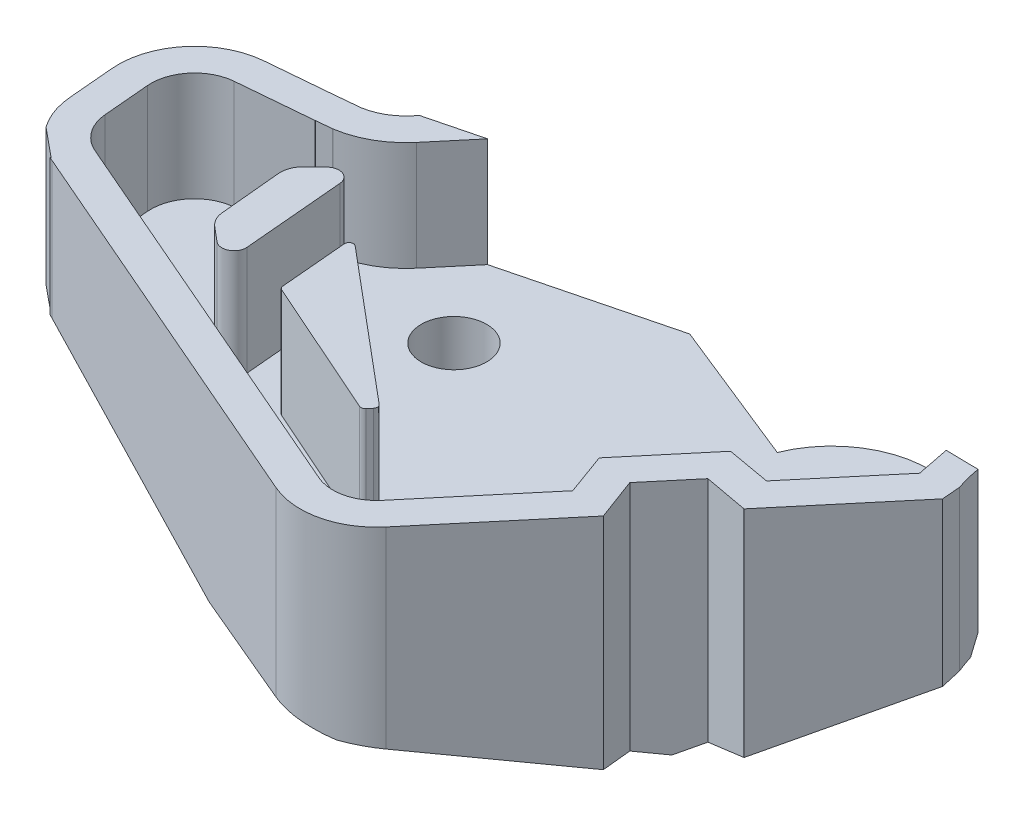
ISO-10303-21;
HEADER;
FILE_DESCRIPTION(('STEP AP214'),'2;1');
FILE_NAME('part.step','',(''),(''),'','','');
FILE_SCHEMA(('AUTOMOTIVE_DESIGN { 1 0 10303 214 1 1 1 1 }'));
ENDSEC;
DATA;
#1=APPLICATION_CONTEXT('core data for automotive mechanical design processes');
#2=APPLICATION_PROTOCOL_DEFINITION('international standard','automotive_design',2000,#1);
#3=PRODUCT_CONTEXT('',#1,'mechanical');
#4=PRODUCT('Part','Part','',(#3));
#5=PRODUCT_RELATED_PRODUCT_CATEGORY('part','',(#4));
#6=PRODUCT_DEFINITION_FORMATION('','',#4);
#7=PRODUCT_DEFINITION_CONTEXT('part definition',#1,'design');
#8=PRODUCT_DEFINITION('design','',#6,#7);
#9=PRODUCT_DEFINITION_SHAPE('','',#8);
#10=(LENGTH_UNIT() NAMED_UNIT(*) SI_UNIT(.MILLI.,.METRE.));
#11=(NAMED_UNIT(*) PLANE_ANGLE_UNIT() SI_UNIT($,.RADIAN.));
#12=(NAMED_UNIT(*) SI_UNIT($,.STERADIAN.) SOLID_ANGLE_UNIT());
#13=UNCERTAINTY_MEASURE_WITH_UNIT(LENGTH_MEASURE(1.E-05),#10,'distance_accuracy_value','');
#14=(GEOMETRIC_REPRESENTATION_CONTEXT(3) GLOBAL_UNCERTAINTY_ASSIGNED_CONTEXT((#13)) GLOBAL_UNIT_ASSIGNED_CONTEXT((#10,
#11,#12)) REPRESENTATION_CONTEXT('',''));
#15=CARTESIAN_POINT('',(0.,0.,0.));
#16=DIRECTION('',(0.,0.,1.));
#17=DIRECTION('',(1.,0.,0.));
#18=AXIS2_PLACEMENT_3D('',#15,#16,#17);
#19=CARTESIAN_POINT('',(-253.8478051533,-4.49999999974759,585.680385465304));
#20=DIRECTION('',(0.397677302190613,0.,-0.917525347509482));
#21=DIRECTION('',(-0.917525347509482,0.,-0.397677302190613));
#22=AXIS2_PLACEMENT_3D('',#19,#20,#21);
#23=PLANE('',#22);
#24=DIRECTION('',(0.906656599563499,-0.153463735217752,0.392966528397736));
#25=VECTOR('',#24,1.);
#26=CARTESIAN_POINT('',(-320.490482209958,-467.684907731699,556.795864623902));
#27=LINE('',#26,#25);
#28=CARTESIAN_POINT('',(-3093.77388629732,1.7303374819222,-645.211104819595));
#29=VERTEX_POINT('',#28);
#30=CARTESIAN_POINT('',(-3081.03815876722,-0.425354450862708,-639.691137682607));
#31=VERTEX_POINT('',#30);
#32=EDGE_CURVE('E1390',#29,#31,#27,.T.);
#33=ORIENTED_EDGE('',*,*,#32,.T.);
#34=DIRECTION('',(-0.917391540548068,-0.0170777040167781,-0.397619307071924));
#35=VECTOR('',#34,1.);
#36=CARTESIAN_POINT('',(-254.665685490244,52.188987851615,585.325896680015));
#37=LINE('',#36,#35);
#38=CARTESIAN_POINT('',(-3075.62109987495,-0.324513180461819,-637.343255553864));
#39=VERTEX_POINT('',#38);
#40=EDGE_CURVE('E816',#39,#31,#37,.T.);
#41=ORIENTED_EDGE('',*,*,#40,.F.);
#42=DIRECTION('',(0.,1.,0.));
#43=VECTOR('',#42,1.);
#44=CARTESIAN_POINT('',(-3075.62109987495,-4.49999999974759,-637.343255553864));
#45=LINE('',#44,#43);
#46=CARTESIAN_POINT('',(-3075.62109987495,8.,-637.343255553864));
#47=VERTEX_POINT('',#46);
#48=EDGE_CURVE('E785',#39,#47,#45,.T.);
#49=ORIENTED_EDGE('',*,*,#48,.T.);
#50=DIRECTION('',(-0.917525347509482,0.,-0.397677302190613));
#51=VECTOR('',#50,1.);
#52=CARTESIAN_POINT('',(-253.8478051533,8.,585.680385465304));
#53=LINE('',#52,#51);
#54=CARTESIAN_POINT('',(-3093.77388629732,8.,-645.211104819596));
#55=VERTEX_POINT('',#54);
#56=EDGE_CURVE('E778',#47,#55,#53,.T.);
#57=ORIENTED_EDGE('',*,*,#56,.T.);
#58=DIRECTION('',(0.,1.,0.));
#59=VECTOR('',#58,1.);
#60=CARTESIAN_POINT('',(-3093.77388629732,-4.49999999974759,-645.211104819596));
#61=LINE('',#60,#59);
#62=EDGE_CURVE('E781',#29,#55,#61,.T.);
#63=ORIENTED_EDGE('',*,*,#62,.F.);
#64=EDGE_LOOP('',(#33,#41,#49,#57,#63));
#65=FACE_BOUND('',#64,.T.);
#66=ADVANCED_FACE('F54',(#65),#23,.F.);
#67=CARTESIAN_POINT('',(-155.946730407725,-600.462790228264,125.30550593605));
#68=DIRECTION('',(-0.246395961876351,-0.948731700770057,0.197982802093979));
#69=DIRECTION('',(0.967890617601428,-0.251371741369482,0.));
#70=AXIS2_PLACEMENT_3D('',#67,#68,#69);
#71=PLANE('',#70);
#72=DIRECTION('',(-0.493585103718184,0.298643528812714,0.816814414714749));
#73=VECTOR('',#72,1.);
#74=CARTESIAN_POINT('',(-3080.32516384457,-0.856751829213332,-640.871044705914));
#75=LINE('',#74,#73);
#76=CARTESIAN_POINT('',(-3074.30376089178,-4.49999999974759,-650.835625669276));
#77=VERTEX_POINT('',#76);
#78=EDGE_CURVE('E1014',#77,#31,#75,.T.);
#79=ORIENTED_EDGE('',*,*,#78,.T.);
#80=ORIENTED_EDGE('',*,*,#32,.F.);
#81=CARTESIAN_POINT('',(-3092.38201573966,0.698706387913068,-648.422443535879));
#82=DIRECTION('',(-0.246395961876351,-0.948731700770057,0.197982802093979));
#83=DIRECTION('',(-0.739565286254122,0.316082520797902,0.59425165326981));
#84=AXIS2_PLACEMENT_3D('',#81,#82,#83);
#85=ELLIPSE('',#84,3.68913571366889,3.50000000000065);
#86=CARTESIAN_POINT('',(-3093.92460586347,1.75495322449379,-645.280721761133));
#87=VERTEX_POINT('',#86);
#88=EDGE_CURVE('E1393',#29,#87,#85,.T.);
#89=ORIENTED_EDGE('',*,*,#88,.T.);
#90=DIRECTION('',(-0.928918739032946,0.289442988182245,0.230938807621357));
#91=VECTOR('',#90,1.);
#92=CARTESIAN_POINT('',(-3095.57227382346,2.26835220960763,-644.871094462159));
#93=LINE('',#92,#91);
#94=CARTESIAN_POINT('',(-3093.89030021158,1.74426388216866,-645.289250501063));
#95=VERTEX_POINT('',#94);
#96=EDGE_CURVE('E1026',#95,#87,#93,.T.);
#97=ORIENTED_EDGE('',*,*,#96,.F.);
#98=DIRECTION('',(0.770181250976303,-0.0676734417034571,0.634224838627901));
#99=VECTOR('',#98,1.);
#100=CARTESIAN_POINT('',(-3094.21635428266,1.77291324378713,-645.557747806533));
#101=LINE('',#100,#99);
#102=CARTESIAN_POINT('',(-3093.89160826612,1.74437881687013,-645.290327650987));
#103=VERTEX_POINT('',#102);
#104=EDGE_CURVE('E1021',#103,#95,#101,.T.);
#105=ORIENTED_EDGE('',*,*,#104,.F.);
#106=DIRECTION('',(0.919884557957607,-0.293248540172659,-0.260418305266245));
#107=VECTOR('',#106,1.);
#108=CARTESIAN_POINT('',(-3074.30621942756,-4.49921624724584,-650.83492966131));
#109=LINE('',#108,#107);
#110=EDGE_CURVE('E1017',#103,#77,#109,.T.);
#111=ORIENTED_EDGE('',*,*,#110,.T.);
#112=EDGE_LOOP('',(#79,#80,#89,#97,#105,#111));
#113=FACE_BOUND('',#112,.T.);
#114=ADVANCED_FACE('F1293',(#113),#71,.T.);
#115=CARTESIAN_POINT('',(-3089.19145536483,8.,-656.862548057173));
#116=DIRECTION('',(0.,1.,0.));
#117=DIRECTION('',(-0.984807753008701,0.,0.173648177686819));
#118=AXIS2_PLACEMENT_3D('',#115,#116,#117);
#119=PLANE('',#118);
#120=DIRECTION('',(-0.193243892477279,0.,-0.981150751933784));
#121=VECTOR('',#120,1.);
#122=CARTESIAN_POINT('',(-3061.43708361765,8.,-652.688232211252));
#123=LINE('',#122,#121);
#124=CARTESIAN_POINT('',(-3061.45890669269,8.,-652.799033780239));
#125=VERTEX_POINT('',#124);
#126=CARTESIAN_POINT('',(-3061.73671245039,8.,-654.20952766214));
#127=VERTEX_POINT('',#126);
#128=EDGE_CURVE('E662',#125,#127,#123,.T.);
#129=ORIENTED_EDGE('',*,*,#128,.F.);
#130=CARTESIAN_POINT('',(-3052.16078909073,8.,-655.64068964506));
#131=DIRECTION('',(0.,-1.,0.));
#132=DIRECTION('',(0.,0.,-1.));
#133=AXIS2_PLACEMENT_3D('',#130,#131,#132);
#134=CIRCLE('',#133,9.72265390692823);
#135=CARTESIAN_POINT('',(-3061.4417824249,8.,-652.743594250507));
#136=VERTEX_POINT('',#135);
#137=EDGE_CURVE('E1088',#136,#125,#134,.T.);
#138=ORIENTED_EDGE('',*,*,#137,.F.);
#139=DIRECTION('',(-0.0845701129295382,0.,-0.996417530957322));
#140=VECTOR('',#139,1.);
#141=CARTESIAN_POINT('',(-3061.43708361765,8.,-652.688232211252));
#142=LINE('',#141,#140);
#143=CARTESIAN_POINT('',(-3061.43708361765,8.,-652.688232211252));
#144=VERTEX_POINT('',#143);
#145=EDGE_CURVE('E1109',#144,#136,#142,.T.);
#146=ORIENTED_EDGE('',*,*,#145,.F.);
#147=DIRECTION('',(0.642787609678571,0.,-0.766044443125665));
#148=VECTOR('',#147,1.);
#149=CARTESIAN_POINT('',(-3064.6417658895,8.,-648.869040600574));
#150=LINE('',#149,#148);
#151=CARTESIAN_POINT('',(-3064.6417658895,8.,-648.869040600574));
#152=VERTEX_POINT('',#151);
#153=EDGE_CURVE('E1145',#152,#144,#150,.T.);
#154=ORIENTED_EDGE('',*,*,#153,.F.);
#155=DIRECTION('',(0.984807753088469,0.,0.173648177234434));
#156=VECTOR('',#155,1.);
#157=CARTESIAN_POINT('',(-3066.64800087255,8.,-649.222793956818));
#158=LINE('',#157,#156);
#159=CARTESIAN_POINT('',(-3066.64800087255,8.,-649.222793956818));
#160=VERTEX_POINT('',#159);
#161=EDGE_CURVE('E1150',#160,#152,#158,.T.);
#162=ORIENTED_EDGE('',*,*,#161,.F.);
#163=DIRECTION('',(0.642787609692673,0.,-0.766044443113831));
#164=VECTOR('',#163,1.);
#165=CARTESIAN_POINT('',(-3069.39689758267,8.,-645.946786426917));
#166=LINE('',#165,#164);
#167=CARTESIAN_POINT('',(-3069.39689758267,8.,-645.946786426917));
#168=VERTEX_POINT('',#167);
#169=EDGE_CURVE('E1155',#168,#160,#166,.T.);
#170=ORIENTED_EDGE('',*,*,#169,.F.);
#171=DIRECTION('',(-0.342020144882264,0.,-0.939692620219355));
#172=VECTOR('',#171,1.);
#173=CARTESIAN_POINT('',(-3068.7001394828,8.,-644.032459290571));
#174=LINE('',#173,#172);
#175=CARTESIAN_POINT('',(-3068.7001394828,8.,-644.032459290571));
#176=VERTEX_POINT('',#175);
#177=EDGE_CURVE('E1159',#176,#168,#174,.T.);
#178=ORIENTED_EDGE('',*,*,#177,.F.);
#179=DIRECTION('',(0.642787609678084,0.,-0.766044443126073));
#180=VECTOR('',#179,1.);
#181=CARTESIAN_POINT('',(-3072.69714043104,8.,-639.269019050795));
#182=LINE('',#181,#180);
#183=CARTESIAN_POINT('',(-3072.69714043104,8.,-639.269019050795));
#184=VERTEX_POINT('',#183);
#185=EDGE_CURVE('E1163',#184,#176,#182,.T.);
#186=ORIENTED_EDGE('',*,*,#185,.F.);
#187=CARTESIAN_POINT('',(-3074.22922931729,8.,-640.554594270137));
#188=DIRECTION('',(0.,1.,0.));
#189=DIRECTION('',(-0.984807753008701,0.,0.173648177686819));
#190=AXIS2_PLACEMENT_3D('',#187,#188,#189);
#191=CIRCLE('',#190,1.99999999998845);
#192=CARTESIAN_POINT('',(-3075.02458392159,8.,-638.719543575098));
#193=VERTEX_POINT('',#192);
#194=EDGE_CURVE('E1168',#193,#184,#191,.T.);
#195=ORIENTED_EDGE('',*,*,#194,.F.);
#196=DIRECTION('',(0.917525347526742,0.,0.39767730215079));
#197=VECTOR('',#196,1.);
#198=CARTESIAN_POINT('',(-3075.2461601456,8.,-638.81557997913));
#199=LINE('',#198,#197);
#200=CARTESIAN_POINT('',(-3093.17737034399,8.,-646.58739284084));
#201=VERTEX_POINT('',#200);
#202=EDGE_CURVE('E1099',#201,#193,#199,.T.);
#203=ORIENTED_EDGE('',*,*,#202,.F.);
#204=CARTESIAN_POINT('',(-3092.38201573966,8.,-648.422443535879));
#205=DIRECTION('',(0.,1.,0.));
#206=DIRECTION('',(0.,0.,-1.));
#207=AXIS2_PLACEMENT_3D('',#204,#205,#206);
#208=CIRCLE('',#207,2.00000000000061);
#209=CARTESIAN_POINT('',(-3094.37440513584,8.,-648.2481320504));
#210=VERTEX_POINT('',#209);
#211=EDGE_CURVE('E1049',#210,#201,#208,.T.);
#212=ORIENTED_EDGE('',*,*,#211,.F.);
#213=DIRECTION('',(0.087155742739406,0.,0.996194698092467));
#214=VECTOR('',#213,1.);
#215=CARTESIAN_POINT('',(-3094.37440513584,8.,-648.2481320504));
#216=LINE('',#215,#214);
#217=CARTESIAN_POINT('',(-3094.5600391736,8.,-650.369938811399));
#218=VERTEX_POINT('',#217);
#219=EDGE_CURVE('E1054',#218,#210,#216,.T.);
#220=ORIENTED_EDGE('',*,*,#219,.F.);
#221=CARTESIAN_POINT('',(-3092.56764977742,8.,-650.544250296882));
#222=DIRECTION('',(0.,1.,0.));
#223=DIRECTION('',(0.,0.,-1.));
#224=AXIS2_PLACEMENT_3D('',#221,#222,#223);
#225=CIRCLE('',#224,2.00000000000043);
#226=CARTESIAN_POINT('',(-3092.7419612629,8.,-652.536639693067));
#227=VERTEX_POINT('',#226);
#228=EDGE_CURVE('E1059',#227,#218,#225,.T.);
#229=ORIENTED_EDGE('',*,*,#228,.F.);
#230=DIRECTION('',(-0.99619469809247,0.,0.0871557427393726));
#231=VECTOR('',#230,1.);
#232=CARTESIAN_POINT('',(-3092.7419612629,8.,-652.536639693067));
#233=LINE('',#232,#231);
#234=CARTESIAN_POINT('',(-3089.32171469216,8.,-652.835872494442));
#235=VERTEX_POINT('',#234);
#236=EDGE_CURVE('E1063',#235,#227,#233,.T.);
#237=ORIENTED_EDGE('',*,*,#236,.F.);
#238=DIRECTION('',(-0.642787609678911,0.,0.766044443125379));
#239=VECTOR('',#238,1.);
#240=CARTESIAN_POINT('',(-3089.32171469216,8.,-652.835872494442));
#241=LINE('',#240,#239);
#242=CARTESIAN_POINT('',(-3089.31784058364,8.,-652.840489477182));
#243=VERTEX_POINT('',#242);
#244=EDGE_CURVE('E1076',#243,#235,#241,.T.);
#245=ORIENTED_EDGE('',*,*,#244,.F.);
#246=DIRECTION('',(0.995585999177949,0.,-0.0938537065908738));
#247=VECTOR('',#246,1.);
#248=CARTESIAN_POINT('',(-3089.94871323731,8.,-652.781017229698));
#249=LINE('',#248,#247);
#250=CARTESIAN_POINT('',(-3088.60878095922,8.,-652.907332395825));
#251=VERTEX_POINT('',#250);
#252=EDGE_CURVE('E857',#243,#251,#249,.T.);
#253=ORIENTED_EDGE('',*,*,#252,.T.);
#254=CARTESIAN_POINT('',(-3088.61853369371,8.,-653.207173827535));
#255=DIRECTION('',(0.,-1.,0.));
#256=DIRECTION('',(0.154843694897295,0.,0.987938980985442));
#257=AXIS2_PLACEMENT_3D('',#254,#255,#256);
#258=CIRCLE('',#257,0.299999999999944);
#259=CARTESIAN_POINT('',(-3088.57208058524,8.,-652.91079213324));
#260=VERTEX_POINT('',#259);
#261=EDGE_CURVE('E1273',#260,#251,#258,.T.);
#262=ORIENTED_EDGE('',*,*,#261,.F.);
#263=CARTESIAN_POINT('',(-3089.19145536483,8.,-656.862548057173));
#264=DIRECTION('',(0.,-1.,0.));
#265=DIRECTION('',(-0.984807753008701,0.,0.173648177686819));
#266=AXIS2_PLACEMENT_3D('',#263,#264,#265);
#267=CIRCLE('',#266,3.99999999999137);
#268=CARTESIAN_POINT('',(-3086.12727759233,8.,-654.291397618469));
#269=VERTEX_POINT('',#268);
#270=EDGE_CURVE('E1194',#269,#260,#267,.T.);
#271=ORIENTED_EDGE('',*,*,#270,.F.);
#272=DIRECTION('',(-0.642787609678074,0.,0.766044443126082));
#273=VECTOR('',#272,1.);
#274=CARTESIAN_POINT('',(-3083.97834492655,8.,-656.852395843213));
#275=LINE('',#274,#273);
#276=CARTESIAN_POINT('',(-3084.63989783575,8.,-656.063987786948));
#277=VERTEX_POINT('',#276);
#278=EDGE_CURVE('E1177',#277,#269,#275,.T.);
#279=ORIENTED_EDGE('',*,*,#278,.F.);
#280=DIRECTION('',(-0.969080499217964,0.,0.246744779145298));
#281=VECTOR('',#280,1.);
#282=CARTESIAN_POINT('',(-3089.99449682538,8.,-654.700613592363));
#283=LINE('',#282,#281);
#284=CARTESIAN_POINT('',(-3087.13002233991,8.,-655.429958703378));
#285=VERTEX_POINT('',#284);
#286=EDGE_CURVE('E851',#277,#285,#283,.T.);
#287=ORIENTED_EDGE('',*,*,#286,.T.);
#288=DIRECTION('',(0.642787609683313,0.,-0.766044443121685));
#289=VECTOR('',#288,1.);
#290=CARTESIAN_POINT('',(-2134.33851492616,8.,-1790.92266066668));
#291=LINE('',#290,#289);
#292=CARTESIAN_POINT('',(-3087.27634425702,8.,-655.255579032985));
#293=VERTEX_POINT('',#292);
#294=EDGE_CURVE('E765',#293,#285,#291,.T.);
#295=ORIENTED_EDGE('',*,*,#294,.F.);
#296=CARTESIAN_POINT('',(-3089.19145536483,8.,-656.862548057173));
#297=DIRECTION('',(0.,1.,0.));
#298=DIRECTION('',(0.,0.,1.));
#299=AXIS2_PLACEMENT_3D('',#296,#297,#298);
#300=CIRCLE('',#299,2.49999999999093);
#301=CARTESIAN_POINT('',(-3088.76415722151,8.,-654.399335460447));
#302=VERTEX_POINT('',#301);
#303=EDGE_CURVE('E762',#302,#293,#300,.T.);
#304=ORIENTED_EDGE('',*,*,#303,.F.);
#305=DIRECTION('',(0.995585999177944,0.,-0.0938537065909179));
#306=VECTOR('',#305,1.);
#307=CARTESIAN_POINT('',(-88.3541404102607,8.,-937.247428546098));
#308=LINE('',#307,#306);
#309=CARTESIAN_POINT('',(-3090.07132359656,8.,-654.276109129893));
#310=VERTEX_POINT('',#309);
#311=EDGE_CURVE('E759',#310,#302,#308,.T.);
#312=ORIENTED_EDGE('',*,*,#311,.F.);
#313=DIRECTION('',(0.642787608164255,0.,-0.766044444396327));
#314=VECTOR('',#313,1.);
#315=CARTESIAN_POINT('',(-2135.49638716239,8.,-1791.8942236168));
#316=LINE('',#315,#314);
#317=CARTESIAN_POINT('',(-3090.07140433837,8.,-654.276012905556));
#318=VERTEX_POINT('',#317);
#319=EDGE_CURVE('E756',#318,#310,#316,.T.);
#320=ORIENTED_EDGE('',*,*,#319,.F.);
#321=DIRECTION('',(0.996194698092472,0.,-0.0871557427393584));
#322=VECTOR('',#321,1.);
#323=CARTESIAN_POINT('',(-80.2794826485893,8.,-917.598685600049));
#324=LINE('',#323,#322);
#325=CARTESIAN_POINT('',(-3092.87269487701,8.,-654.030931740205));
#326=VERTEX_POINT('',#325);
#327=EDGE_CURVE('E753',#326,#318,#324,.T.);
#328=ORIENTED_EDGE('',*,*,#327,.F.);
#329=CARTESIAN_POINT('',(-3092.56764977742,8.,-650.544250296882));
#330=DIRECTION('',(0.,1.,0.));
#331=DIRECTION('',(0.,0.,1.));
#332=AXIS2_PLACEMENT_3D('',#329,#330,#331);
#333=CIRCLE('',#332,3.50000000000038);
#334=CARTESIAN_POINT('',(-3096.05433122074,8.,-650.23920519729));
#335=VERTEX_POINT('',#334);
#336=EDGE_CURVE('E750',#326,#335,#333,.T.);
#337=ORIENTED_EDGE('',*,*,#336,.T.);
#338=DIRECTION('',(-0.0871557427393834,0.,-0.99619469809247));
#339=VECTOR('',#338,1.);
#340=CARTESIAN_POINT('',(-3016.07989367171,8.,263.872798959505));
#341=LINE('',#340,#339);
#342=CARTESIAN_POINT('',(-3095.86869718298,8.,-648.11739843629));
#343=VERTEX_POINT('',#342);
#344=EDGE_CURVE('E747',#343,#335,#341,.T.);
#345=ORIENTED_EDGE('',*,*,#344,.F.);
#346=CARTESIAN_POINT('',(-3092.38201573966,8.,-648.422443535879));
#347=DIRECTION('',(0.,1.,0.));
#348=DIRECTION('',(0.,0.,1.));
#349=AXIS2_PLACEMENT_3D('',#346,#347,#348);
#350=CIRCLE('',#349,3.50000000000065);
#351=CARTESIAN_POINT('',(-3095.237672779,8.,-646.398777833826));
#352=VERTEX_POINT('',#351);
#353=EDGE_CURVE('E744',#343,#352,#350,.T.);
#354=ORIENTED_EDGE('',*,*,#353,.T.);
#355=DIRECTION('',(-0.771950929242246,0.,-0.635682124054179));
#356=VECTOR('',#355,1.);
#357=CARTESIAN_POINT('',(-3093.89030021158,8.,-645.289250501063));
#358=LINE('',#357,#356);
#359=CARTESIAN_POINT('',(-3093.89030021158,8.,-645.289250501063));
#360=VERTEX_POINT('',#359);
#361=EDGE_CURVE('E1024',#360,#352,#358,.T.);
#362=ORIENTED_EDGE('',*,*,#361,.F.);
#363=DIRECTION('',(0.970458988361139,0.,-0.241266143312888));
#364=VECTOR('',#363,1.);
#365=CARTESIAN_POINT('',(-3093.89030021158,8.,-645.289250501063));
#366=LINE('',#365,#364);
#367=CARTESIAN_POINT('',(-3093.92460586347,8.,-645.280721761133));
#368=VERTEX_POINT('',#367);
#369=EDGE_CURVE('E1029',#368,#360,#366,.T.);
#370=ORIENTED_EDGE('',*,*,#369,.F.);
#371=EDGE_CURVE('E743',#368,#55,#350,.T.);
#372=ORIENTED_EDGE('',*,*,#371,.T.);
#373=ORIENTED_EDGE('',*,*,#56,.F.);
#374=CARTESIAN_POINT('',(-3074.22922931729,8.,-640.554594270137));
#375=DIRECTION('',(0.,1.,0.));
#376=DIRECTION('',(0.,0.,1.));
#377=AXIS2_PLACEMENT_3D('',#374,#375,#376);
#378=CIRCLE('',#377,3.49999999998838);
#379=CARTESIAN_POINT('',(-3071.54807376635,8.,-638.304837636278));
#380=VERTEX_POINT('',#379);
#381=EDGE_CURVE('E775',#47,#380,#378,.T.);
#382=ORIENTED_EDGE('',*,*,#381,.T.);
#383=DIRECTION('',(-0.642787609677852,0.,0.766044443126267));
#384=VECTOR('',#383,1.);
#385=CARTESIAN_POINT('',(-2116.76217617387,8.,-1776.17436127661));
#386=LINE('',#385,#384);
#387=CARTESIAN_POINT('',(-3066.99440241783,8.,-643.731691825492));
#388=VERTEX_POINT('',#387);
#389=EDGE_CURVE('E772',#388,#380,#386,.T.);
#390=ORIENTED_EDGE('',*,*,#389,.F.);
#391=DIRECTION('',(0.342020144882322,0.,0.939692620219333));
#392=VECTOR('',#391,1.);
#393=CARTESIAN_POINT('',(-3067.29060055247,8.,-644.545489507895));
#394=LINE('',#393,#392);
#395=CARTESIAN_POINT('',(-3067.00158799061,8.,-643.75143402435));
#396=VERTEX_POINT('',#395);
#397=EDGE_CURVE('E1133',#396,#388,#394,.T.);
#398=ORIENTED_EDGE('',*,*,#397,.F.);
#399=DIRECTION('',(-0.642787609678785,0.,0.766044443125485));
#400=VECTOR('',#399,1.);
#401=CARTESIAN_POINT('',(-3064.05904434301,8.,-647.258220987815));
#402=LINE('',#401,#400);
#403=CARTESIAN_POINT('',(-3067.00169971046,8.,-643.751300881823));
#404=VERTEX_POINT('',#403);
#405=EDGE_CURVE('E1108',#396,#404,#402,.T.);
#406=ORIENTED_EDGE('',*,*,#405,.T.);
#407=DIRECTION('',(0.348771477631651,0.,0.937207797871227));
#408=VECTOR('',#407,1.);
#409=CARTESIAN_POINT('',(-3067.71389807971,8.,-645.665098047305));
#410=LINE('',#409,#408);
#411=CARTESIAN_POINT('',(-3067.71389807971,8.,-645.665098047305));
#412=VERTEX_POINT('',#411);
#413=EDGE_CURVE('E1070',#412,#404,#410,.T.);
#414=ORIENTED_EDGE('',*,*,#413,.F.);
#415=DIRECTION('',(0.642787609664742,0.,-0.766044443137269));
#416=VECTOR('',#415,1.);
#417=CARTESIAN_POINT('',(-3067.71389807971,8.,-645.665098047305));
#418=LINE('',#417,#416);
#419=CARTESIAN_POINT('',(-3066.0783421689,8.,-647.614277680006));
#420=VERTEX_POINT('',#419);
#421=EDGE_CURVE('E1125',#412,#420,#418,.T.);
#422=ORIENTED_EDGE('',*,*,#421,.T.);
#423=DIRECTION('',(-0.983519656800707,0.,-0.180801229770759));
#424=VECTOR('',#423,1.);
#425=CARTESIAN_POINT('',(-3064.0700596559,8.,-647.2450934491));
#426=LINE('',#425,#424);
#427=CARTESIAN_POINT('',(-3064.0700596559,8.,-647.245093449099));
#428=VERTEX_POINT('',#427);
#429=EDGE_CURVE('E1065',#428,#420,#426,.T.);
#430=ORIENTED_EDGE('',*,*,#429,.F.);
#431=DIRECTION('',(0.984807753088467,0.,0.173648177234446));
#432=VECTOR('',#431,1.);
#433=CARTESIAN_POINT('',(-3072.77875012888,8.,-648.780670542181));
#434=LINE('',#433,#432);
#435=CARTESIAN_POINT('',(-3064.04936962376,8.,-647.24144523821));
#436=VERTEX_POINT('',#435);
#437=EDGE_CURVE('E1128',#428,#436,#434,.T.);
#438=ORIENTED_EDGE('',*,*,#437,.T.);
#439=DIRECTION('',(-0.642787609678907,0.,0.766044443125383));
#440=VECTOR('',#439,1.);
#441=CARTESIAN_POINT('',(-3067.55107281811,8.,-643.068277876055));
#442=LINE('',#441,#440);
#443=CARTESIAN_POINT('',(-3059.89010493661,8.,-652.19826387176));
#444=VERTEX_POINT('',#443);
#445=EDGE_CURVE('E1175',#444,#436,#442,.T.);
#446=ORIENTED_EDGE('',*,*,#445,.F.);
#447=DIRECTION('',(0.084570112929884,0.,0.996417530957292));
#448=VECTOR('',#447,1.);
#449=CARTESIAN_POINT('',(-2983.04656823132,8.,253.183607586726));
#450=LINE('',#449,#448);
#451=CARTESIAN_POINT('',(-3059.96162031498,8.,-653.040868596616));
#452=VERTEX_POINT('',#451);
#453=EDGE_CURVE('E770',#452,#444,#450,.T.);
#454=ORIENTED_EDGE('',*,*,#453,.F.);
#455=CARTESIAN_POINT('',(-3052.16078909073,8.,-655.64068964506));
#456=DIRECTION('',(0.,1.,0.));
#457=DIRECTION('',(0.,0.,1.));
#458=AXIS2_PLACEMENT_3D('',#455,#456,#457);
#459=CIRCLE('',#458,8.22265390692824);
#460=CARTESIAN_POINT('',(-3060.25333872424,8.,-654.183748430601));
#461=VERTEX_POINT('',#460);
#462=EDGE_CURVE('E767',#461,#452,#459,.T.);
#463=ORIENTED_EDGE('',*,*,#462,.F.);
#464=DIRECTION('',(0.999849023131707,0.,0.0173761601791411));
#465=VECTOR('',#464,1.);
#466=CARTESIAN_POINT('',(-3058.25325190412,8.,-654.148989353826));
#467=LINE('',#466,#465);
#468=EDGE_CURVE('E1115',#127,#461,#467,.T.);
#469=ORIENTED_EDGE('',*,*,#468,.F.);
#470=EDGE_LOOP('',(#129,#138,#146,#154,#162,#170,#178,#186,#195,#203,#212,#220,#229,#237,#245,
#253,#262,#271,#279,#287,#295,#304,#312,#320,#328,#337,#345,#354,#362,#370,#372,#373,#382,#390,
#398,#406,#414,#422,#430,#438,#446,#454,#463,#469));
#471=FACE_BOUND('',#470,.T.);
#472=ADVANCED_FACE('F1283',(#471),#119,.T.);
#473=CARTESIAN_POINT('',(-0.881636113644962,-308.438525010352,-447.319586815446));
#474=DIRECTION('',(-0.00162259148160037,-0.567660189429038,-0.823261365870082));
#475=DIRECTION('',(0.,0.823262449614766,-0.567660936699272));
#476=AXIS2_PLACEMENT_3D('',#473,#474,#475);
#477=PLANE('',#476);
#478=DIRECTION('',(-0.97237659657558,0.193055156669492,-0.13120007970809));
#479=VECTOR('',#478,1.);
#480=CARTESIAN_POINT('',(-85.3134293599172,-597.932625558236,-247.539442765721));
#481=LINE('',#480,#479);
#482=CARTESIAN_POINT('',(-3085.28749399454,-2.31929519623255,-652.317630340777));
#483=VERTEX_POINT('',#482);
#484=CARTESIAN_POINT('',(-3094.37189948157,-0.515681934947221,-653.543364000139));
#485=VERTEX_POINT('',#484);
#486=EDGE_CURVE('E958',#483,#485,#481,.T.);
#487=ORIENTED_EDGE('',*,*,#486,.T.);
#488=CARTESIAN_POINT('',(-3092.56764977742,-4.87036815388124,-650.544250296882));
#489=DIRECTION('',(-0.00162259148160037,-0.567660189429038,-0.823261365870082));
#490=DIRECTION('',(-0.00111881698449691,0.823262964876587,-0.567659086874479));
#491=AXIS2_PLACEMENT_3D('',#488,#489,#490);
#492=ELLIPSE('',#491,6.16566048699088,3.50000000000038);
#493=CARTESIAN_POINT('',(-3094.36411400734,-0.508931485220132,-653.548033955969));
#494=VERTEX_POINT('',#493);
#495=EDGE_CURVE('E827',#485,#494,#492,.T.);
#496=ORIENTED_EDGE('',*,*,#495,.T.);
#497=DIRECTION('',(0.972265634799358,-0.193435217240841,0.131462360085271));
#498=VECTOR('',#497,1.);
#499=CARTESIAN_POINT('',(-85.8218798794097,-599.067596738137,-246.755848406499));
#500=LINE('',#499,#498);
#501=CARTESIAN_POINT('',(-3085.28734220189,-2.31478295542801,-652.320741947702));
#502=VERTEX_POINT('',#501);
#503=EDGE_CURVE('E937',#494,#502,#500,.T.);
#504=ORIENTED_EDGE('',*,*,#503,.T.);
#505=CARTESIAN_POINT('',(-3082.29098177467,-2.5375964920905,-652.173011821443));
#506=DIRECTION('',(-0.00162259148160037,-0.567660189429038,-0.823261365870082));
#507=DIRECTION('',(0.00111881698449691,-0.823262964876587,0.567659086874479));
#508=AXIS2_PLACEMENT_3D('',#505,#506,#507);
#509=ELLIPSE('',#508,5.28485184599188,3.00000000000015);
#510=EDGE_CURVE('E1255',#502,#483,#509,.F.);
#511=ORIENTED_EDGE('',*,*,#510,.T.);
#512=EDGE_LOOP('',(#487,#496,#504,#511));
#513=FACE_BOUND('',#512,.T.);
#514=ADVANCED_FACE('F56',(#513),#477,.T.);
#515=CARTESIAN_POINT('',(-3093.89030021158,8.,-645.289250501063));
#516=DIRECTION('',(-0.63568212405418,0.,0.771950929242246));
#517=DIRECTION('',(0.771950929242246,0.,0.63568212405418));
#518=AXIS2_PLACEMENT_3D('',#515,#516,#517);
#519=PLANE('',#518);
#520=ORIENTED_EDGE('',*,*,#361,.T.);
#521=DIRECTION('',(0.,1.,0.));
#522=VECTOR('',#521,1.);
#523=CARTESIAN_POINT('',(-3095.237672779,-4.49999999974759,-646.398777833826));
#524=LINE('',#523,#522);
#525=CARTESIAN_POINT('',(-3095.237672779,1.75000000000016,-646.398777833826));
#526=VERTEX_POINT('',#525);
#527=EDGE_CURVE('E824',#352,#526,#524,.F.);
#528=ORIENTED_EDGE('',*,*,#527,.T.);
#529=DIRECTION('',(0.771950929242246,0.,0.63568212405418));
#530=VECTOR('',#529,1.);
#531=CARTESIAN_POINT('',(-3093.89030021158,1.75000000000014,-645.289250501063));
#532=LINE('',#531,#530);
#533=CARTESIAN_POINT('',(-3094.2251492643,1.75000000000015,-645.564990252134));
#534=VERTEX_POINT('',#533);
#535=EDGE_CURVE('E961',#526,#534,#532,.T.);
#536=ORIENTED_EDGE('',*,*,#535,.T.);
#537=DIRECTION('',(0.113426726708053,-0.989146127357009,0.0934040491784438));
#538=VECTOR('',#537,1.);
#539=CARTESIAN_POINT('',(-3094.9191424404,7.80201862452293,-646.136476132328));
#540=LINE('',#539,#538);
#541=CARTESIAN_POINT('',(-3094.22789301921,1.77392711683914,-645.567249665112));
#542=VERTEX_POINT('',#541);
#543=EDGE_CURVE('E1018',#542,#534,#540,.T.);
#544=ORIENTED_EDGE('',*,*,#543,.F.);
#545=CARTESIAN_POINT('',(-3093.95558210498,1.75000000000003,-645.343008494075));
#546=VERTEX_POINT('',#545);
#547=EDGE_CURVE('E1025',#542,#546,#101,.T.);
#548=ORIENTED_EDGE('',*,*,#547,.T.);
#549=DIRECTION('',(-0.771950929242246,0.,-0.63568212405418));
#550=VECTOR('',#549,1.);
#551=CARTESIAN_POINT('',(-3093.89030021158,1.75000000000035,-645.289250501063));
#552=LINE('',#551,#550);
#553=CARTESIAN_POINT('',(-3093.89259411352,1.75000000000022,-645.291139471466));
#554=VERTEX_POINT('',#553);
#555=EDGE_CURVE('E1042',#554,#546,#552,.T.);
#556=ORIENTED_EDGE('',*,*,#555,.F.);
#557=DIRECTION('',(-0.171022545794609,0.975149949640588,-0.140832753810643));
#558=VECTOR('',#557,1.);
#559=CARTESIAN_POINT('',(-3094.93481044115,7.6925919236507,-646.149378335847));
#560=LINE('',#559,#558);
#561=EDGE_CURVE('E1043',#103,#554,#560,.T.);
#562=ORIENTED_EDGE('',*,*,#561,.F.);
#563=ORIENTED_EDGE('',*,*,#104,.T.);
#564=DIRECTION('',(0.,-1.,0.));
#565=VECTOR('',#564,1.);
#566=CARTESIAN_POINT('',(-3093.89030021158,8.,-645.289250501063));
#567=LINE('',#566,#565);
#568=EDGE_CURVE('E1030',#360,#95,#567,.T.);
#569=ORIENTED_EDGE('',*,*,#568,.F.);
#570=EDGE_LOOP('',(#520,#528,#536,#544,#548,#556,#562,#563,#569));
#571=FACE_BOUND('',#570,.T.);
#572=ADVANCED_FACE('F1592',(#571),#519,.T.);
#573=CARTESIAN_POINT('',(-19.0464669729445,329.009951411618,-92.2643930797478));
#574=DIRECTION('',(0.055653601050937,-0.961364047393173,0.269595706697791));
#575=DIRECTION('',(0.,-0.270014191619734,-0.962856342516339));
#576=AXIS2_PLACEMENT_3D('',#573,#574,#575);
#577=PLANE('',#576);
#578=DIRECTION('',(0.632882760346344,-0.17487417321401,-0.754240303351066));
#579=VECTOR('',#578,1.);
#580=CARTESIAN_POINT('',(-2146.05192941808,-256.553716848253,-1741.26819262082));
#581=LINE('',#580,#579);
#582=CARTESIAN_POINT('',(-3071.54807376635,-0.826458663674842,-638.304837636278));
#583=VERTEX_POINT('',#582);
#584=CARTESIAN_POINT('',(-3066.99440241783,-2.08470041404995,-643.731691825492));
#585=VERTEX_POINT('',#584);
#586=EDGE_CURVE('E833',#583,#585,#581,.T.);
#587=ORIENTED_EDGE('',*,*,#586,.F.);
#588=CARTESIAN_POINT('',(-3074.22922931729,-1.61257157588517,-640.554594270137));
#589=DIRECTION('',(0.055653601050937,-0.961364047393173,0.269595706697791));
#590=DIRECTION('',(0.194359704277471,0.275280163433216,0.941512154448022));
#591=AXIS2_PLACEMENT_3D('',#588,#589,#590);
#592=ELLIPSE('',#591,3.64066038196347,3.49999999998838);
#593=CARTESIAN_POINT('',(-3072.84634134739,-0.630871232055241,-637.339377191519));
#594=VERTEX_POINT('',#593);
#595=EDGE_CURVE('E1401',#583,#594,#592,.T.);
#596=ORIENTED_EDGE('',*,*,#595,.T.);
#597=DIRECTION('',(0.103250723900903,0.274107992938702,0.956140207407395));
#598=VECTOR('',#597,1.);
#599=CARTESIAN_POINT('',(-2977.16438219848,253.383713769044,248.711246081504));
#600=LINE('',#599,#598);
#601=CARTESIAN_POINT('',(-3073.34035804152,-1.94237704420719,-641.914156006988));
#602=VERTEX_POINT('',#601);
#603=EDGE_CURVE('E1009',#602,#594,#600,.T.);
#604=ORIENTED_EDGE('',*,*,#603,.F.);
#605=CARTESIAN_POINT('',(-3073.62417824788,-2.79632524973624,-644.900700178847));
#606=DIRECTION('',(0.055653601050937,-0.961364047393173,0.269595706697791));
#607=DIRECTION('',(-0.194359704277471,-0.275280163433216,-0.941512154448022));
#608=AXIS2_PLACEMENT_3D('',#605,#606,#607);
#609=ELLIPSE('',#608,3.1205660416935,3.00000000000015);
#610=CARTESIAN_POINT('',(-3073.9844821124,-3.65238497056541,-647.878985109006));
#611=VERTEX_POINT('',#610);
#612=EDGE_CURVE('E1260',#602,#611,#609,.F.);
#613=ORIENTED_EDGE('',*,*,#612,.T.);
#614=EDGE_CURVE('E1118',#77,#611,#600,.T.);
#615=ORIENTED_EDGE('',*,*,#614,.F.);
#616=DIRECTION('',(0.860941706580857,0.182951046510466,0.474666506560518));
#617=VECTOR('',#616,1.);
#618=CARTESIAN_POINT('',(-528.887006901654,536.403821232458,752.539386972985));
#619=LINE('',#618,#617);
#620=CARTESIAN_POINT('',(-3066.83195067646,-2.91223222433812,-646.716162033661));
#621=VERTEX_POINT('',#620);
#622=EDGE_CURVE('E1068',#77,#621,#619,.T.);
#623=ORIENTED_EDGE('',*,*,#622,.T.);
#624=DIRECTION('',(0.632882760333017,-0.174874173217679,-0.754240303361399));
#625=VECTOR('',#624,1.);
#626=CARTESIAN_POINT('',(-3068.8946369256,-2.34228376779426,-644.257948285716));
#627=LINE('',#626,#625);
#628=CARTESIAN_POINT('',(-3067.71389807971,-2.66853807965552,-645.665098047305));
#629=VERTEX_POINT('',#628);
#630=EDGE_CURVE('E1122',#629,#621,#627,.T.);
#631=ORIENTED_EDGE('',*,*,#630,.F.);
#632=DIRECTION('',(-0.335590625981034,-0.272316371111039,-0.901788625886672));
#633=VECTOR('',#632,1.);
#634=CARTESIAN_POINT('',(-3066.73893429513,-1.87739977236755,-643.045205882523));
#635=LINE('',#634,#633);
#636=CARTESIAN_POINT('',(-3067.00169971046,-2.09062183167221,-643.751300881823));
#637=VERTEX_POINT('',#636);
#638=EDGE_CURVE('E1072',#637,#629,#635,.T.);
#639=ORIENTED_EDGE('',*,*,#638,.F.);
#640=DIRECTION('',(-0.632882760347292,0.174874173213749,0.754240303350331));
#641=VECTOR('',#640,1.);
#642=CARTESIAN_POINT('',(-3065.26581166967,-2.57027146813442,-645.820051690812));
#643=LINE('',#642,#641);
#644=CARTESIAN_POINT('',(-3067.00158799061,-2.09065270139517,-643.75143402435));
#645=VERTEX_POINT('',#644);
#646=EDGE_CURVE('E1114',#645,#637,#643,.T.);
#647=ORIENTED_EDGE('',*,*,#646,.F.);
#648=DIRECTION('',(0.329068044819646,0.272588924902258,0.904107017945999));
#649=VECTOR('',#648,1.);
#650=CARTESIAN_POINT('',(-3066.36399093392,-1.56248869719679,-641.999650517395));
#651=LINE('',#650,#649);
#652=EDGE_CURVE('E1134',#645,#585,#651,.T.);
#653=ORIENTED_EDGE('',*,*,#652,.T.);
#654=EDGE_LOOP('',(#587,#596,#604,#613,#615,#623,#631,#639,#647,#653));
#655=FACE_BOUND('',#654,.T.);
#656=ADVANCED_FACE('F1370',(#655),#577,.T.);
#657=CARTESIAN_POINT('',(-3093.89030021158,8.,-645.289250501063));
#658=DIRECTION('',(-0.241266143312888,0.,-0.970458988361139));
#659=DIRECTION('',(-0.970458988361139,0.,0.241266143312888));
#660=AXIS2_PLACEMENT_3D('',#657,#658,#659);
#661=PLANE('',#660);
#662=ORIENTED_EDGE('',*,*,#96,.T.);
#663=DIRECTION('',(0.,1.,0.));
#664=VECTOR('',#663,1.);
#665=CARTESIAN_POINT('',(-3093.92460586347,-4.49999999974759,-645.280721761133));
#666=LINE('',#665,#664);
#667=EDGE_CURVE('E819',#87,#368,#666,.T.);
#668=ORIENTED_EDGE('',*,*,#667,.T.);
#669=ORIENTED_EDGE('',*,*,#369,.T.);
#670=ORIENTED_EDGE('',*,*,#568,.T.);
#671=EDGE_LOOP('',(#662,#668,#669,#670));
#672=FACE_BOUND('',#671,.T.);
#673=ADVANCED_FACE('F1594',(#672),#661,.T.);
#674=CARTESIAN_POINT('',(-113.94071626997,-479.861239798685,138.365762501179));
#675=DIRECTION('',(0.222434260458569,0.936781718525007,-0.270116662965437));
#676=DIRECTION('',(0.,0.27705759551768,0.960853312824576));
#677=AXIS2_PLACEMENT_3D('',#674,#675,#676);
#678=PLANE('',#677);
#679=CARTESIAN_POINT('',(-3092.38201573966,0.488423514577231,-648.422443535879));
#680=DIRECTION('',(0.222434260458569,0.936781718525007,-0.270116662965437));
#681=DIRECTION('',(-0.595495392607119,0.349914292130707,0.723149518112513));
#682=AXIS2_PLACEMENT_3D('',#679,#680,#681);
#683=ELLIPSE('',#682,3.73619588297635,3.50000000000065);
#684=CARTESIAN_POINT('',(-3095.86869718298,1.40427739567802,-648.11739843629));
#685=VERTEX_POINT('',#684);
#686=EDGE_CURVE('E822',#685,#526,#683,.T.);
#687=ORIENTED_EDGE('',*,*,#686,.F.);
#688=DIRECTION('',(-0.0842152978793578,-0.257560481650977,-0.962585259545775));
#689=VECTOR('',#688,1.);
#690=CARTESIAN_POINT('',(-3021.40333510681,229.145970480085,203.025584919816));
#691=LINE('',#690,#689);
#692=CARTESIAN_POINT('',(-3096.05433122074,0.83654215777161,-650.23920519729));
#693=VERTEX_POINT('',#692);
#694=EDGE_CURVE('E1396',#685,#693,#691,.T.);
#695=ORIENTED_EDGE('',*,*,#694,.T.);
#696=CARTESIAN_POINT('',(-3092.56764977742,-0.0793117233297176,-650.544250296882));
#697=DIRECTION('',(0.222434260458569,0.936781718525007,-0.270116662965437));
#698=DIRECTION('',(-0.595495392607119,0.349914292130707,0.723149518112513));
#699=AXIS2_PLACEMENT_3D('',#696,#697,#698);
#700=ELLIPSE('',#699,3.73619588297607,3.50000000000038);
#701=EDGE_CURVE('E1399',#485,#693,#700,.T.);
#702=ORIENTED_EDGE('',*,*,#701,.F.);
#703=ORIENTED_EDGE('',*,*,#486,.F.);
#704=CARTESIAN_POINT('',(-3082.29098177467,-2.98910236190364,-652.173011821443));
#705=DIRECTION('',(0.222434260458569,0.936781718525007,-0.270116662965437));
#706=DIRECTION('',(0.595495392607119,-0.349914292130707,-0.723149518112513));
#707=AXIS2_PLACEMENT_3D('',#704,#705,#706);
#708=ELLIPSE('',#707,3.2024536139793,3.00000000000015);
#709=CARTESIAN_POINT('',(-3079.3632957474,-3.49548251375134,-651.518294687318));
#710=VERTEX_POINT('',#709);
#711=EDGE_CURVE('E986',#710,#483,#708,.F.);
#712=ORIENTED_EDGE('',*,*,#711,.F.);
#713=CARTESIAN_POINT('',(-3077.89518356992,-3.78696076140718,-651.320206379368));
#714=VERTEX_POINT('',#713);
#715=EDGE_CURVE('E962',#714,#710,#481,.T.);
#716=ORIENTED_EDGE('',*,*,#715,.F.);
#717=DIRECTION('',(-0.891015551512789,0.307788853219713,0.333702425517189));
#718=VECTOR('',#717,1.);
#719=CARTESIAN_POINT('',(-3075.23853606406,-4.70466246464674,-652.315171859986));
#720=LINE('',#719,#718);
#721=CARTESIAN_POINT('',(-3077.90627479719,-3.78312945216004,-651.31605250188));
#722=VERTEX_POINT('',#721);
#723=EDGE_CURVE('E953',#714,#722,#720,.T.);
#724=ORIENTED_EDGE('',*,*,#723,.T.);
#725=DIRECTION('',(-0.972487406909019,0.193516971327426,-0.129689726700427));
#726=VECTOR('',#725,1.);
#727=CARTESIAN_POINT('',(-3105.61279262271,1.73023902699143,-655.010959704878));
#728=LINE('',#727,#726);
#729=EDGE_CURVE('E1034',#77,#722,#728,.T.);
#730=ORIENTED_EDGE('',*,*,#729,.F.);
#731=DIRECTION('',(0.919829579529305,-0.293480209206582,-0.260351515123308));
#732=VECTOR('',#731,1.);
#733=CARTESIAN_POINT('',(-3074.30376089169,-4.49999999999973,-650.835625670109));
#734=LINE('',#733,#732);
#735=EDGE_CURVE('E1039',#554,#77,#734,.T.);
#736=ORIENTED_EDGE('',*,*,#735,.F.);
#737=ORIENTED_EDGE('',*,*,#555,.T.);
#738=DIRECTION('',(-0.920861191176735,0.292867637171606,0.257377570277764));
#739=VECTOR('',#738,1.);
#740=CARTESIAN_POINT('',(-622.806779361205,-784.165964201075,-1336.02069231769));
#741=LINE('',#740,#739);
#742=CARTESIAN_POINT('',(-3093.95306006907,1.74919790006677,-645.343713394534));
#743=VERTEX_POINT('',#742);
#744=EDGE_CURVE('E1033',#743,#546,#741,.T.);
#745=ORIENTED_EDGE('',*,*,#744,.F.);
#746=DIRECTION('',(-0.769902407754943,-0.00120104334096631,-0.638160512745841));
#747=VECTOR('',#746,1.);
#748=CARTESIAN_POINT('',(-3093.88910496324,1.74929766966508,-645.290701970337));
#749=LINE('',#748,#747);
#750=CARTESIAN_POINT('',(-3094.22125905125,1.74877951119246,-645.56601949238));
#751=VERTEX_POINT('',#750);
#752=EDGE_CURVE('E992',#743,#751,#749,.T.);
#753=ORIENTED_EDGE('',*,*,#752,.T.);
#754=DIRECTION('',(-0.925122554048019,0.290241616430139,0.244761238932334));
#755=VECTOR('',#754,1.);
#756=CARTESIAN_POINT('',(-591.735235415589,-783.364052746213,-1307.65297962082));
#757=LINE('',#756,#755);
#758=EDGE_CURVE('E1037',#751,#534,#757,.T.);
#759=ORIENTED_EDGE('',*,*,#758,.T.);
#760=ORIENTED_EDGE('',*,*,#535,.F.);
#761=EDGE_LOOP('',(#687,#695,#702,#703,#712,#716,#724,#730,#736,#737,#745,#753,#759,#760));
#762=FACE_BOUND('',#761,.T.);
#763=ADVANCED_FACE('F1299',(#762),#678,.F.);
#764=CARTESIAN_POINT('',(-4233.52435234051,3.,-3552.34872255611));
#765=DIRECTION('',(0.,1.,0.));
#766=DIRECTION('',(-0.984807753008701,0.,0.173648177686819));
#767=AXIS2_PLACEMENT_3D('',#764,#765,#766);
#768=PLANE('',#767);
#769=DIRECTION('',(-0.642787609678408,0.,0.766044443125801));
#770=VECTOR('',#769,1.);
#771=CARTESIAN_POINT('',(-3061.42782784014,3.,-652.699262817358));
#772=LINE('',#771,#770);
#773=CARTESIAN_POINT('',(-3061.43708361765,3.,-652.688232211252));
#774=VERTEX_POINT('',#773);
#775=CARTESIAN_POINT('',(-3064.6417658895,3.,-648.869040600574));
#776=VERTEX_POINT('',#775);
#777=EDGE_CURVE('E1149',#774,#776,#772,.T.);
#778=ORIENTED_EDGE('',*,*,#777,.F.);
#779=DIRECTION('',(-0.0845701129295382,0.,-0.996417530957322));
#780=VECTOR('',#779,1.);
#781=CARTESIAN_POINT('',(-3061.43708361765,3.,-652.688232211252));
#782=LINE('',#781,#780);
#783=CARTESIAN_POINT('',(-3061.4417824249,3.,-652.743594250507));
#784=VERTEX_POINT('',#783);
#785=EDGE_CURVE('E1187',#774,#784,#782,.T.);
#786=ORIENTED_EDGE('',*,*,#785,.T.);
#787=CARTESIAN_POINT('',(-3052.16078909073,3.,-655.64068964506));
#788=DIRECTION('',(0.,1.,0.));
#789=DIRECTION('',(0.,0.,1.));
#790=AXIS2_PLACEMENT_3D('',#787,#788,#789);
#791=CIRCLE('',#790,9.72265390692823);
#792=CARTESIAN_POINT('',(-3061.45890669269,3.,-652.799033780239));
#793=VERTEX_POINT('',#792);
#794=EDGE_CURVE('E1078',#793,#784,#791,.T.);
#795=ORIENTED_EDGE('',*,*,#794,.F.);
#796=DIRECTION('',(-0.193243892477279,0.,-0.981150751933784));
#797=VECTOR('',#796,1.);
#798=CARTESIAN_POINT('',(-3061.43708361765,3.,-652.688232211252));
#799=LINE('',#798,#797);
#800=CARTESIAN_POINT('',(-3061.73671245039,3.,-654.20952766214));
#801=VERTEX_POINT('',#800);
#802=EDGE_CURVE('E735',#793,#801,#799,.T.);
#803=ORIENTED_EDGE('',*,*,#802,.T.);
#804=DIRECTION('',(-0.999849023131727,0.,-0.0173761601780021));
#805=VECTOR('',#804,1.);
#806=CARTESIAN_POINT('',(-3061.73671245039,3.,-654.20952766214));
#807=LINE('',#806,#805);
#808=CARTESIAN_POINT('',(-3061.7776393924,3.,-654.210238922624));
#809=VERTEX_POINT('',#808);
#810=EDGE_CURVE('E737',#801,#809,#807,.T.);
#811=ORIENTED_EDGE('',*,*,#810,.T.);
#812=DIRECTION('',(-0.953894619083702,0.,-0.300141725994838));
#813=VECTOR('',#812,1.);
#814=CARTESIAN_POINT('',(-3075.25969556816,3.,-658.452350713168));
#815=LINE('',#814,#813);
#816=CARTESIAN_POINT('',(-3061.90391920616,3.,-654.249972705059));
#817=VERTEX_POINT('',#816);
#818=EDGE_CURVE('E996',#809,#817,#815,.T.);
#819=ORIENTED_EDGE('',*,*,#818,.T.);
#820=CARTESIAN_POINT('',(-3066.35186660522,3.,-653.56750370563));
#821=DIRECTION('',(0.,-1.,0.));
#822=DIRECTION('',(0.,0.,-1.));
#823=AXIS2_PLACEMENT_3D('',#820,#821,#822);
#824=CIRCLE('',#823,4.50000000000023);
#825=CARTESIAN_POINT('',(-3070.52708071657,3.,-655.246070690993));
#826=VERTEX_POINT('',#825);
#827=EDGE_CURVE('E950',#826,#817,#824,.T.);
#828=ORIENTED_EDGE('',*,*,#827,.F.);
#829=DIRECTION('',(0.927825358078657,0.,0.373014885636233));
#830=VECTOR('',#829,1.);
#831=CARTESIAN_POINT('',(-5074.37078152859,3.,-1460.85406834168));
#832=LINE('',#831,#830);
#833=CARTESIAN_POINT('',(-3077.24495847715,3.,-657.946868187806));
#834=VERTEX_POINT('',#833);
#835=EDGE_CURVE('E846',#834,#826,#832,.T.);
#836=ORIENTED_EDGE('',*,*,#835,.F.);
#837=DIRECTION('',(-0.969080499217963,0.,0.246744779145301));
#838=VECTOR('',#837,1.);
#839=CARTESIAN_POINT('',(-3089.99449682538,3.,-654.700613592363));
#840=LINE('',#839,#838);
#841=CARTESIAN_POINT('',(-3084.63989783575,3.,-656.063987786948));
#842=VERTEX_POINT('',#841);
#843=EDGE_CURVE('E1000',#834,#842,#840,.T.);
#844=ORIENTED_EDGE('',*,*,#843,.T.);
#845=DIRECTION('',(0.642787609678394,0.,-0.766044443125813));
#846=VECTOR('',#845,1.);
#847=CARTESIAN_POINT('',(-3076.7060332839,3.,-665.519199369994));
#848=LINE('',#847,#846);
#849=CARTESIAN_POINT('',(-3086.12727759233,3.,-654.291397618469));
#850=VERTEX_POINT('',#849);
#851=EDGE_CURVE('E1144',#850,#842,#848,.T.);
#852=ORIENTED_EDGE('',*,*,#851,.F.);
#853=CARTESIAN_POINT('',(-3089.19145536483,3.,-656.862548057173));
#854=DIRECTION('',(0.,-1.,0.));
#855=DIRECTION('',(-0.984807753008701,0.,0.173648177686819));
#856=AXIS2_PLACEMENT_3D('',#853,#854,#855);
#857=CIRCLE('',#856,3.99999999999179);
#858=CARTESIAN_POINT('',(-3088.57208058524,3.,-652.91079213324));
#859=VERTEX_POINT('',#858);
#860=EDGE_CURVE('E1171',#859,#850,#857,.F.);
#861=ORIENTED_EDGE('',*,*,#860,.F.);
#862=CARTESIAN_POINT('',(-3088.61853369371,3.,-653.207173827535));
#863=DIRECTION('',(0.,-1.,0.));
#864=DIRECTION('',(-0.984807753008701,0.,0.173648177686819));
#865=AXIS2_PLACEMENT_3D('',#862,#863,#864);
#866=CIRCLE('',#865,0.3);
#867=CARTESIAN_POINT('',(-3088.60878095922,3.,-652.907332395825));
#868=VERTEX_POINT('',#867);
#869=EDGE_CURVE('E1229',#868,#859,#866,.F.);
#870=ORIENTED_EDGE('',*,*,#869,.F.);
#871=DIRECTION('',(0.995585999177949,0.,-0.0938537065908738));
#872=VECTOR('',#871,1.);
#873=CARTESIAN_POINT('',(-3089.94871323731,3.,-652.781017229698));
#874=LINE('',#873,#872);
#875=CARTESIAN_POINT('',(-3089.31784058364,3.,-652.840489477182));
#876=VERTEX_POINT('',#875);
#877=EDGE_CURVE('E858',#876,#868,#874,.T.);
#878=ORIENTED_EDGE('',*,*,#877,.F.);
#879=DIRECTION('',(-0.642787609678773,0.,0.766044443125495));
#880=VECTOR('',#879,1.);
#881=CARTESIAN_POINT('',(-3075.83839043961,3.,-668.904672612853));
#882=LINE('',#881,#880);
#883=CARTESIAN_POINT('',(-3089.32171469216,3.,-652.835872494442));
#884=VERTEX_POINT('',#883);
#885=EDGE_CURVE('E1184',#876,#884,#882,.T.);
#886=ORIENTED_EDGE('',*,*,#885,.T.);
#887=DIRECTION('',(0.996194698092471,0.,-0.0871557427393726));
#888=VECTOR('',#887,1.);
#889=CARTESIAN_POINT('',(-3092.7419612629,3.,-652.536639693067));
#890=LINE('',#889,#888);
#891=CARTESIAN_POINT('',(-3092.7419612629,3.,-652.536639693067));
#892=VERTEX_POINT('',#891);
#893=EDGE_CURVE('E1061',#892,#884,#890,.T.);
#894=ORIENTED_EDGE('',*,*,#893,.F.);
#895=CARTESIAN_POINT('',(-3092.56764977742,3.,-650.544250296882));
#896=DIRECTION('',(0.,-1.,0.));
#897=DIRECTION('',(0.,0.,-1.));
#898=AXIS2_PLACEMENT_3D('',#895,#896,#897);
#899=CIRCLE('',#898,2.00000000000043);
#900=CARTESIAN_POINT('',(-3094.5600391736,3.,-650.369938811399));
#901=VERTEX_POINT('',#900);
#902=EDGE_CURVE('E1056',#901,#892,#899,.T.);
#903=ORIENTED_EDGE('',*,*,#902,.F.);
#904=DIRECTION('',(-0.087155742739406,0.,-0.996194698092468));
#905=VECTOR('',#904,1.);
#906=CARTESIAN_POINT('',(-3094.37440513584,3.,-648.2481320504));
#907=LINE('',#906,#905);
#908=CARTESIAN_POINT('',(-3094.37440513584,3.,-648.2481320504));
#909=VERTEX_POINT('',#908);
#910=EDGE_CURVE('E1051',#909,#901,#907,.T.);
#911=ORIENTED_EDGE('',*,*,#910,.F.);
#912=CARTESIAN_POINT('',(-3092.38201573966,3.,-648.422443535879));
#913=DIRECTION('',(0.,-1.,0.));
#914=DIRECTION('',(0.,0.,-1.));
#915=AXIS2_PLACEMENT_3D('',#912,#913,#914);
#916=CIRCLE('',#915,2.00000000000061);
#917=CARTESIAN_POINT('',(-3093.17737034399,3.,-646.58739284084));
#918=VERTEX_POINT('',#917);
#919=EDGE_CURVE('E1046',#918,#909,#916,.T.);
#920=ORIENTED_EDGE('',*,*,#919,.F.);
#921=DIRECTION('',(-0.917525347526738,0.,-0.397677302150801));
#922=VECTOR('',#921,1.);
#923=CARTESIAN_POINT('',(-3075.02458392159,3.,-638.719543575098));
#924=LINE('',#923,#922);
#925=CARTESIAN_POINT('',(-3075.02458392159,3.,-638.719543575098));
#926=VERTEX_POINT('',#925);
#927=EDGE_CURVE('E1045',#926,#918,#924,.T.);
#928=ORIENTED_EDGE('',*,*,#927,.F.);
#929=CARTESIAN_POINT('',(-3074.22922931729,3.,-640.554594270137));
#930=DIRECTION('',(0.,-1.,0.));
#931=DIRECTION('',(-0.984807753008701,0.,0.173648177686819));
#932=AXIS2_PLACEMENT_3D('',#929,#930,#931);
#933=CIRCLE('',#932,1.99999999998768);
#934=CARTESIAN_POINT('',(-3072.69714043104,3.,-639.269019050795));
#935=VERTEX_POINT('',#934);
#936=EDGE_CURVE('E1087',#926,#935,#933,.F.);
#937=ORIENTED_EDGE('',*,*,#936,.T.);
#938=DIRECTION('',(-0.642787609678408,0.,0.766044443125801));
#939=VECTOR('',#938,1.);
#940=CARTESIAN_POINT('',(-3061.42782784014,3.,-652.699262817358));
#941=LINE('',#940,#939);
#942=CARTESIAN_POINT('',(-3068.7001394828,3.,-644.032459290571));
#943=VERTEX_POINT('',#942);
#944=EDGE_CURVE('E1191',#943,#935,#941,.T.);
#945=ORIENTED_EDGE('',*,*,#944,.F.);
#946=DIRECTION('',(-0.342020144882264,0.,-0.939692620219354));
#947=VECTOR('',#946,1.);
#948=CARTESIAN_POINT('',(-3069.39689758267,3.,-645.946786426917));
#949=LINE('',#948,#947);
#950=CARTESIAN_POINT('',(-3069.39689758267,3.,-645.946786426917));
#951=VERTEX_POINT('',#950);
#952=EDGE_CURVE('E1190',#943,#951,#949,.T.);
#953=ORIENTED_EDGE('',*,*,#952,.T.);
#954=DIRECTION('',(0.642787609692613,0.,-0.766044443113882));
#955=VECTOR('',#954,1.);
#956=CARTESIAN_POINT('',(-3066.64800087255,3.,-649.222793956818));
#957=LINE('',#956,#955);
#958=CARTESIAN_POINT('',(-3066.64800087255,3.,-649.222793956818));
#959=VERTEX_POINT('',#958);
#960=EDGE_CURVE('E1197',#951,#959,#957,.T.);
#961=ORIENTED_EDGE('',*,*,#960,.T.);
#962=DIRECTION('',(0.984807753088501,0.,0.17364817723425));
#963=VECTOR('',#962,1.);
#964=CARTESIAN_POINT('',(-3066.64800087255,3.,-649.222793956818));
#965=LINE('',#964,#963);
#966=EDGE_CURVE('E1199',#959,#776,#965,.T.);
#967=ORIENTED_EDGE('',*,*,#966,.T.);
#968=EDGE_LOOP('',(#778,#786,#795,#803,#811,#819,#828,#836,#844,#852,#861,#870,#878,#886,#894,
#903,#911,#920,#928,#937,#945,#953,#961,#967));
#969=FACE_BOUND('',#968,.T.);
#970=CARTESIAN_POINT('',(-3073.62417824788,3.,-644.900700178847));
#971=DIRECTION('',(0.,1.,0.));
#972=DIRECTION('',(0.984807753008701,0.,-0.173648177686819));
#973=AXIS2_PLACEMENT_3D('',#970,#971,#972);
#974=CIRCLE('',#973,1.50000000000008);
#975=CARTESIAN_POINT('',(-3072.14696661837,3.,-645.161172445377));
#976=VERTEX_POINT('',#975);
#977=EDGE_CURVE('E1154',#976,#976,#974,.T.);
#978=ORIENTED_EDGE('',*,*,#977,.F.);
#979=EDGE_LOOP('',(#978));
#980=FACE_BOUND('',#979,.T.);
#981=CARTESIAN_POINT('',(-3082.29098177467,3.,-652.173011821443));
#982=DIRECTION('',(0.,1.,0.));
#983=DIRECTION('',(0.984807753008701,0.,-0.173648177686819));
#984=AXIS2_PLACEMENT_3D('',#981,#982,#983);
#985=CIRCLE('',#984,1.50000000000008);
#986=CARTESIAN_POINT('',(-3080.81377014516,3.,-652.433484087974));
#987=VERTEX_POINT('',#986);
#988=EDGE_CURVE('E1179',#987,#987,#985,.T.);
#989=ORIENTED_EDGE('',*,*,#988,.F.);
#990=EDGE_LOOP('',(#989));
#991=FACE_BOUND('',#990,.T.);
#992=CARTESIAN_POINT('',(-3066.35186660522,3.,-653.56750370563));
#993=DIRECTION('',(0.,1.,0.));
#994=DIRECTION('',(0.,0.,1.));
#995=AXIS2_PLACEMENT_3D('',#992,#993,#994);
#996=CIRCLE('',#995,1.50000000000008);
#997=CARTESIAN_POINT('',(-3066.35186660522,3.,-652.06750370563));
#998=VERTEX_POINT('',#997);
#999=EDGE_CURVE('E875',#998,#998,#996,.T.);
#1000=ORIENTED_EDGE('',*,*,#999,.F.);
#1001=EDGE_LOOP('',(#1000));
#1002=FACE_BOUND('',#1001,.T.);
#1003=DIRECTION('',(-0.724607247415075,0.,0.689162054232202));
#1004=VECTOR('',#1003,1.);
#1005=CARTESIAN_POINT('',(-3087.1910299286,3.,-651.262271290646));
#1006=LINE('',#1005,#1004);
#1007=CARTESIAN_POINT('',(-3087.1910299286,3.,-651.262271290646));
#1008=VERTEX_POINT('',#1007);
#1009=CARTESIAN_POINT('',(-3087.73228311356,3.,-650.747494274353));
#1010=VERTEX_POINT('',#1009);
#1011=EDGE_CURVE('E676',#1008,#1010,#1006,.T.);
#1012=ORIENTED_EDGE('',*,*,#1011,.F.);
#1013=CARTESIAN_POINT('',(-3086.8091621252,3.,-650.86076314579));
#1014=DIRECTION('',(0.,1.,0.));
#1015=DIRECTION('',(0.,0.,1.));
#1016=AXIS2_PLACEMENT_3D('',#1013,#1014,#1015);
#1017=CIRCLE('',#1016,0.554104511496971);
#1018=CARTESIAN_POINT('',(-3086.25716614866,3.,-650.909056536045));
#1019=VERTEX_POINT('',#1018);
#1020=EDGE_CURVE('E715',#1019,#1008,#1017,.T.);
#1021=ORIENTED_EDGE('',*,*,#1020,.F.);
#1022=DIRECTION('',(-0.0871557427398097,0.,-0.996194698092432));
#1023=VECTOR('',#1022,1.);
#1024=CARTESIAN_POINT('',(-3085.8485371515,3.,-646.238405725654));
#1025=LINE('',#1024,#1023);
#1026=CARTESIAN_POINT('',(-3085.8485371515,3.,-646.238405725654));
#1027=VERTEX_POINT('',#1026);
#1028=EDGE_CURVE('E718',#1027,#1019,#1025,.T.);
#1029=ORIENTED_EDGE('',*,*,#1028,.F.);
#1030=CARTESIAN_POINT('',(-3086.40053312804,3.,-646.190112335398));
#1031=DIRECTION('',(0.,1.,0.));
#1032=DIRECTION('',(0.,0.,1.));
#1033=AXIS2_PLACEMENT_3D('',#1030,#1031,#1032);
#1034=CIRCLE('',#1033,0.554104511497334);
#1035=CARTESIAN_POINT('',(-3086.75735932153,3.,-645.766193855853));
#1036=VERTEX_POINT('',#1035);
#1037=EDGE_CURVE('E721',#1036,#1027,#1034,.T.);
#1038=ORIENTED_EDGE('',*,*,#1037,.F.);
#1039=DIRECTION('',(0.765051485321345,0.,0.64396911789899));
#1040=VECTOR('',#1039,1.);
#1041=CARTESIAN_POINT('',(-3087.41519458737,3.,-646.319915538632));
#1042=LINE('',#1041,#1040);
#1043=CARTESIAN_POINT('',(-3087.41519458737,3.,-646.319915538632));
#1044=VERTEX_POINT('',#1043);
#1045=EDGE_CURVE('E724',#1044,#1036,#1042,.T.);
#1046=ORIENTED_EDGE('',*,*,#1045,.F.);
#1047=CARTESIAN_POINT('',(-3086.72835823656,3.,-647.135894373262));
#1048=DIRECTION('',(0.,1.,0.));
#1049=DIRECTION('',(0.,0.,1.));
#1050=AXIS2_PLACEMENT_3D('',#1047,#1048,#1049);
#1051=CIRCLE('',#1050,1.06656721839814);
#1052=CARTESIAN_POINT('',(-3087.79017285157,3.,-647.035319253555));
#1053=VERTEX_POINT('',#1052);
#1054=EDGE_CURVE('E727',#1053,#1044,#1051,.T.);
#1055=ORIENTED_EDGE('',*,*,#1054,.F.);
#1056=DIRECTION('',(0.0942979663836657,0.,0.9955440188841));
#1057=VECTOR('',#1056,1.);
#1058=CARTESIAN_POINT('',(-3088.05906007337,3.,-649.874076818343));
#1059=LINE('',#1058,#1057);
#1060=CARTESIAN_POINT('',(-3088.05906007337,3.,-649.874076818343));
#1061=VERTEX_POINT('',#1060);
#1062=EDGE_CURVE('E730',#1061,#1053,#1059,.T.);
#1063=ORIENTED_EDGE('',*,*,#1062,.F.);
#1064=CARTESIAN_POINT('',(-3086.99724545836,3.,-649.974651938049));
#1065=DIRECTION('',(0.,1.,0.));
#1066=DIRECTION('',(0.,0.,1.));
#1067=AXIS2_PLACEMENT_3D('',#1064,#1065,#1066);
#1068=CIRCLE('',#1067,1.06656721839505);
#1069=EDGE_CURVE('E695',#1010,#1061,#1068,.T.);
#1070=ORIENTED_EDGE('',*,*,#1069,.F.);
#1071=EDGE_LOOP('',(#1012,#1021,#1029,#1038,#1046,#1055,#1063,#1070));
#1072=FACE_BOUND('',#1071,.T.);
#1073=DIRECTION('',(0.642787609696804,0.,-0.766044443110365));
#1074=VECTOR('',#1073,1.);
#1075=CARTESIAN_POINT('',(-3076.70780261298,3.,-642.549208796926));
#1076=LINE('',#1075,#1074);
#1077=CARTESIAN_POINT('',(-3076.70780261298,3.,-642.549208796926));
#1078=VERTEX_POINT('',#1077);
#1079=CARTESIAN_POINT('',(-3076.54691984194,3.,-642.740941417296));
#1080=VERTEX_POINT('',#1079);
#1081=EDGE_CURVE('E611',#1078,#1080,#1076,.T.);
#1082=ORIENTED_EDGE('',*,*,#1081,.F.);
#1083=CARTESIAN_POINT('',(-3076.8610115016,3.,-642.677766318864));
#1084=DIRECTION('',(0.,1.,0.));
#1085=DIRECTION('',(0.,0.,1.));
#1086=AXIS2_PLACEMENT_3D('',#1083,#1084,#1085);
#1087=CIRCLE('',#1086,0.199999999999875);
#1088=CARTESIAN_POINT('',(-3076.94202621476,3.,-642.494909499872));
#1089=VERTEX_POINT('',#1088);
#1090=EDGE_CURVE('E641',#1089,#1078,#1087,.T.);
#1091=ORIENTED_EDGE('',*,*,#1090,.F.);
#1092=DIRECTION('',(0.914284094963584,0.,0.405073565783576));
#1093=VECTOR('',#1092,1.);
#1094=CARTESIAN_POINT('',(-3083.36556219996,3.,-645.340857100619));
#1095=LINE('',#1094,#1093);
#1096=CARTESIAN_POINT('',(-3083.36556219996,3.,-645.340857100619));
#1097=VERTEX_POINT('',#1096);
#1098=EDGE_CURVE('E638',#1097,#1089,#1095,.T.);
#1099=ORIENTED_EDGE('',*,*,#1098,.F.);
#1100=CARTESIAN_POINT('',(-3083.2845474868,3.,-645.523713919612));
#1101=DIRECTION('',(0.,1.,0.));
#1102=DIRECTION('',(0.,0.,1.));
#1103=AXIS2_PLACEMENT_3D('',#1100,#1101,#1102);
#1104=CIRCLE('',#1103,0.19999999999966);
#1105=CARTESIAN_POINT('',(-3083.48378642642,3.,-645.506282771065));
#1106=VERTEX_POINT('',#1105);
#1107=EDGE_CURVE('E635',#1106,#1097,#1104,.T.);
#1108=ORIENTED_EDGE('',*,*,#1107,.F.);
#1109=DIRECTION('',(0.0871557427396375,0.,0.996194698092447));
#1110=VECTOR('',#1109,1.);
#1111=CARTESIAN_POINT('',(-3083.75484498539,3.,-648.604496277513));
#1112=LINE('',#1111,#1110);
#1113=CARTESIAN_POINT('',(-3083.75484498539,3.,-648.604496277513));
#1114=VERTEX_POINT('',#1113);
#1115=EDGE_CURVE('E632',#1114,#1106,#1112,.T.);
#1116=ORIENTED_EDGE('',*,*,#1115,.F.);
#1117=CARTESIAN_POINT('',(-3083.55560604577,3.,-648.621927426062));
#1118=DIRECTION('',(0.,1.,0.));
#1119=DIRECTION('',(0.,0.,1.));
#1120=AXIS2_PLACEMENT_3D('',#1117,#1118,#1119);
#1121=CIRCLE('',#1120,0.200000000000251);
#1122=CARTESIAN_POINT('',(-3083.42704852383,3.,-648.775136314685));
#1123=VERTEX_POINT('',#1122);
#1124=EDGE_CURVE('E621',#1123,#1114,#1121,.T.);
#1125=ORIENTED_EDGE('',*,*,#1124,.F.);
#1126=DIRECTION('',(-0.766044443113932,0.,-0.642787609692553));
#1127=VECTOR('',#1126,1.);
#1128=CARTESIAN_POINT('',(-3076.57157120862,3.,-643.022707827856));
#1129=LINE('',#1128,#1127);
#1130=CARTESIAN_POINT('',(-3076.57157120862,3.,-643.022707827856));
#1131=VERTEX_POINT('',#1130);
#1132=EDGE_CURVE('E603',#1131,#1123,#1129,.T.);
#1133=ORIENTED_EDGE('',*,*,#1132,.F.);
#1134=CARTESIAN_POINT('',(-3076.70012873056,3.,-642.869498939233));
#1135=DIRECTION('',(0.,1.,0.));
#1136=DIRECTION('',(0.,0.,1.));
#1137=AXIS2_PLACEMENT_3D('',#1134,#1135,#1136);
#1138=CIRCLE('',#1137,0.19999999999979);
#1139=EDGE_CURVE('E617',#1080,#1131,#1138,.T.);
#1140=ORIENTED_EDGE('',*,*,#1139,.F.);
#1141=EDGE_LOOP('',(#1082,#1091,#1099,#1108,#1116,#1125,#1133,#1140));
#1142=FACE_BOUND('',#1141,.T.);
#1143=ADVANCED_FACE('F616',(#969,#980,#991,#1002,#1072,#1142),#768,.T.);
#1144=CARTESIAN_POINT('',(0.,1.5,0.));
#1145=DIRECTION('',(0.,1.,0.));
#1146=DIRECTION('',(0.,0.,1.));
#1147=AXIS2_PLACEMENT_3D('',#1144,#1145,#1146);
#1148=PLANE('',#1147);
#1149=CARTESIAN_POINT('',(-3089.19145536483,1.5,-656.862548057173));
#1150=DIRECTION('',(0.,1.,0.));
#1151=DIRECTION('',(0.,0.,1.));
#1152=AXIS2_PLACEMENT_3D('',#1149,#1150,#1151);
#1153=CIRCLE('',#1152,2.49999999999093);
#1154=CARTESIAN_POINT('',(-3087.88083977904,1.5,-654.733631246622));
#1155=VERTEX_POINT('',#1154);
#1156=CARTESIAN_POINT('',(-3087.27634425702,1.5,-655.255579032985));
#1157=VERTEX_POINT('',#1156);
#1158=EDGE_CURVE('E813',#1155,#1157,#1153,.T.);
#1159=ORIENTED_EDGE('',*,*,#1158,.T.);
#1160=DIRECTION('',(0.642787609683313,0.,-0.766044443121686));
#1161=VECTOR('',#1160,1.);
#1162=CARTESIAN_POINT('',(-2134.33851492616,1.5,-1790.92266066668));
#1163=LINE('',#1162,#1161);
#1164=CARTESIAN_POINT('',(-3087.13002233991,1.5,-655.429958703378));
#1165=VERTEX_POINT('',#1164);
#1166=EDGE_CURVE('E837',#1157,#1165,#1163,.T.);
#1167=ORIENTED_EDGE('',*,*,#1166,.T.);
#1168=DIRECTION('',(-0.969080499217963,0.,0.246744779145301));
#1169=VECTOR('',#1168,1.);
#1170=CARTESIAN_POINT('',(-3089.99449682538,1.5,-654.700613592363));
#1171=LINE('',#1170,#1169);
#1172=CARTESIAN_POINT('',(-3077.24495847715,1.5,-657.946868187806));
#1173=VERTEX_POINT('',#1172);
#1174=EDGE_CURVE('E999',#1173,#1165,#1171,.T.);
#1175=ORIENTED_EDGE('',*,*,#1174,.F.);
#1176=DIRECTION('',(-0.927825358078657,0.,-0.373014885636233));
#1177=VECTOR('',#1176,1.);
#1178=CARTESIAN_POINT('',(-3077.24495847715,1.5,-657.946868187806));
#1179=LINE('',#1178,#1177);
#1180=CARTESIAN_POINT('',(-3070.52708071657,1.5,-655.246070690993));
#1181=VERTEX_POINT('',#1180);
#1182=EDGE_CURVE('E840',#1181,#1173,#1179,.T.);
#1183=ORIENTED_EDGE('',*,*,#1182,.F.);
#1184=CARTESIAN_POINT('',(-3066.35186660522,1.5,-653.56750370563));
#1185=DIRECTION('',(0.,-1.,0.));
#1186=DIRECTION('',(0.,0.,-1.));
#1187=AXIS2_PLACEMENT_3D('',#1184,#1185,#1186);
#1188=CIRCLE('',#1187,4.50000000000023);
#1189=CARTESIAN_POINT('',(-3061.90391920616,1.5,-654.249972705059));
#1190=VERTEX_POINT('',#1189);
#1191=EDGE_CURVE('E949',#1181,#1190,#1188,.T.);
#1192=ORIENTED_EDGE('',*,*,#1191,.T.);
#1193=DIRECTION('',(-0.953894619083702,0.,-0.300141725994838));
#1194=VECTOR('',#1193,1.);
#1195=CARTESIAN_POINT('',(-3075.25969556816,1.5,-658.452350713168));
#1196=LINE('',#1195,#1194);
#1197=CARTESIAN_POINT('',(-3061.80577371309,1.5,-654.219091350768));
#1198=VERTEX_POINT('',#1197);
#1199=EDGE_CURVE('E997',#1198,#1190,#1196,.T.);
#1200=ORIENTED_EDGE('',*,*,#1199,.F.);
#1201=DIRECTION('',(0.999805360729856,0.,0.0197291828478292));
#1202=VECTOR('',#1201,1.);
#1203=CARTESIAN_POINT('',(11.7129165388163,1.5,-593.56927428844));
#1204=LINE('',#1203,#1202);
#1205=CARTESIAN_POINT('',(-3063.43080229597,1.5,-654.251158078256));
#1206=VERTEX_POINT('',#1205);
#1207=EDGE_CURVE('E1477',#1206,#1198,#1204,.T.);
#1208=ORIENTED_EDGE('',*,*,#1207,.F.);
#1209=CARTESIAN_POINT('',(-3066.35186660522,1.5,-653.56750370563));
#1210=DIRECTION('',(0.,-1.,0.));
#1211=DIRECTION('',(0.,0.,-1.));
#1212=AXIS2_PLACEMENT_3D('',#1209,#1210,#1211);
#1213=CIRCLE('',#1212,3.00000000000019);
#1214=CARTESIAN_POINT('',(-3069.24368628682,1.5,-654.365863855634));
#1215=VERTEX_POINT('',#1214);
#1216=EDGE_CURVE('E902',#1215,#1206,#1213,.T.);
#1217=ORIENTED_EDGE('',*,*,#1216,.F.);
#1218=CARTESIAN_POINT('',(-3080.51142688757,1.5,-654.588210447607));
#1219=VERTEX_POINT('',#1218);
#1220=EDGE_CURVE('E945',#1219,#1215,#1204,.T.);
#1221=ORIENTED_EDGE('',*,*,#1220,.F.);
#1222=CARTESIAN_POINT('',(-3082.29098177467,1.5,-652.173011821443));
#1223=DIRECTION('',(0.,-1.,0.));
#1224=DIRECTION('',(0.,0.,-1.));
#1225=AXIS2_PLACEMENT_3D('',#1222,#1223,#1224);
#1226=CIRCLE('',#1225,3.00000000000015);
#1227=CARTESIAN_POINT('',(-3083.97387007,1.5,-654.656534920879));
#1228=VERTEX_POINT('',#1227);
#1229=EDGE_CURVE('E878',#1228,#1219,#1226,.T.);
#1230=ORIENTED_EDGE('',*,*,#1229,.F.);
#1231=EDGE_CURVE('E941',#1155,#1228,#1204,.T.);
#1232=ORIENTED_EDGE('',*,*,#1231,.F.);
#1233=EDGE_LOOP('',(#1159,#1167,#1175,#1183,#1192,#1200,#1208,#1217,#1221,#1230,#1232));
#1234=FACE_BOUND('',#1233,.T.);
#1235=ADVANCED_FACE('F1298',(#1234),#1148,.F.);
#1236=CARTESIAN_POINT('',(7.35143596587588,-265.089327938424,-444.425006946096));
#1237=DIRECTION('',(0.0142047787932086,-0.512217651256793,-0.858738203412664));
#1238=DIRECTION('',(0.,0.858824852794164,-0.512269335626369));
#1239=AXIS2_PLACEMENT_3D('',#1236,#1237,#1238);
#1240=PLANE('',#1239);
#1241=CARTESIAN_POINT('',(-3089.19145536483,5.19133352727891,-656.862548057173));
#1242=DIRECTION('',(0.0142047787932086,-0.512217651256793,-0.858738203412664));
#1243=DIRECTION('',(0.00847166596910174,0.858855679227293,-0.512147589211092));
#1244=AXIS2_PLACEMENT_3D('',#1241,#1242,#1243);
#1245=ELLIPSE('',#1244,4.88073769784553,2.49999999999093);
#1246=CARTESIAN_POINT('',(-3087.99780682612,1.54175516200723,-654.665913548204));
#1247=VERTEX_POINT('',#1246);
#1248=CARTESIAN_POINT('',(-3088.76415722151,1.07358186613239,-654.399335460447));
#1249=VERTEX_POINT('',#1248);
#1250=EDGE_CURVE('E811',#1247,#1249,#1245,.T.);
#1251=ORIENTED_EDGE('',*,*,#1250,.F.);
#1252=DIRECTION('',(0.999848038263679,-0.00140357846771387,0.0173761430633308));
#1253=VECTOR('',#1252,1.);
#1254=CARTESIAN_POINT('',(-3104.78998750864,1.56532788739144,-654.95774122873));
#1255=LINE('',#1254,#1253);
#1256=CARTESIAN_POINT('',(-3067.65386059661,1.51319649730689,-654.312360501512));
#1257=VERTEX_POINT('',#1256);
#1258=EDGE_CURVE('E926',#1247,#1257,#1255,.T.);
#1259=ORIENTED_EDGE('',*,*,#1258,.T.);
#1260=CARTESIAN_POINT('',(-3066.35186660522,0.300543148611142,-653.56750370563));
#1261=DIRECTION('',(0.0142047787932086,-0.512217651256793,-0.858738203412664));
#1262=DIRECTION('',(-0.00847166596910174,-0.858855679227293,0.512147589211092));
#1263=AXIS2_PLACEMENT_3D('',#1260,#1261,#1262);
#1264=ELLIPSE('',#1263,2.9284426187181,1.50000000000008);
#1265=CARTESIAN_POINT('',(-3067.65829092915,1.5,-654.304562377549));
#1266=VERTEX_POINT('',#1265);
#1267=EDGE_CURVE('E874',#1266,#1257,#1264,.T.);
#1268=ORIENTED_EDGE('',*,*,#1267,.F.);
#1269=DIRECTION('',(-0.999863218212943,0.,-0.01653919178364));
#1270=VECTOR('',#1269,1.);
#1271=CARTESIAN_POINT('',(9.98104626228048,1.5,-603.395931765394));
#1272=LINE('',#1271,#1270);
#1273=CARTESIAN_POINT('',(-3069.2531009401,1.5,-654.330942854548));
#1274=VERTEX_POINT('',#1273);
#1275=EDGE_CURVE('E908',#1266,#1274,#1272,.T.);
#1276=ORIENTED_EDGE('',*,*,#1275,.T.);
#1277=CARTESIAN_POINT('',(-3066.35186660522,0.30054314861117,-653.56750370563));
#1278=DIRECTION('',(0.0142047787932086,-0.512217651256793,-0.858738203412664));
#1279=DIRECTION('',(-0.00847166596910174,-0.858855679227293,0.512147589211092));
#1280=AXIS2_PLACEMENT_3D('',#1277,#1278,#1279);
#1281=ELLIPSE('',#1280,5.85688523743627,3.00000000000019);
#1282=CARTESIAN_POINT('',(-3069.34712984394,0.50000000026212,-653.736021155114));
#1283=VERTEX_POINT('',#1282);
#1284=EDGE_CURVE('E907',#1283,#1274,#1281,.T.);
#1285=ORIENTED_EDGE('',*,*,#1284,.F.);
#1286=CARTESIAN_POINT('',(-3066.35186660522,0.300543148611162,-653.56750370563));
#1287=DIRECTION('',(0.0142047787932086,-0.512217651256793,-0.858738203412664));
#1288=DIRECTION('',(-0.00847166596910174,-0.858855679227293,0.512147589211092));
#1289=AXIS2_PLACEMENT_3D('',#1286,#1287,#1288);
#1290=ELLIPSE('',#1289,5.8568852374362,3.00000000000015);
#1291=CARTESIAN_POINT('',(-3068.88161616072,-2.47309428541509,-651.954938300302));
#1292=VERTEX_POINT('',#1291);
#1293=EDGE_CURVE('E932',#1292,#1283,#1290,.T.);
#1294=ORIENTED_EDGE('',*,*,#1293,.F.);
#1295=DIRECTION('',(-0.919656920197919,-0.343786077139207,0.189848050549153));
#1296=VECTOR('',#1295,1.);
#1297=CARTESIAN_POINT('',(-586.363352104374,925.541686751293,-1164.43001735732));
#1298=LINE('',#1297,#1296);
#1299=EDGE_CURVE('E1266',#1292,#77,#1298,.T.);
#1300=ORIENTED_EDGE('',*,*,#1299,.T.);
#1301=CARTESIAN_POINT('',(-3079.36298290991,-3.49345232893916,-651.519695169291));
#1302=VERTEX_POINT('',#1301);
#1303=EDGE_CURVE('E933',#1302,#77,#500,.T.);
#1304=ORIENTED_EDGE('',*,*,#1303,.F.);
#1305=CARTESIAN_POINT('',(-3082.29098177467,-2.47935921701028,-652.173011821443));
#1306=DIRECTION('',(0.0142047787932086,-0.512217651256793,-0.858738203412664));
#1307=DIRECTION('',(-0.00847166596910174,-0.858855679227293,0.512147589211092));
#1308=AXIS2_PLACEMENT_3D('',#1305,#1306,#1307);
#1309=ELLIPSE('',#1308,5.8568852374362,3.00000000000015);
#1310=CARTESIAN_POINT('',(-3079.84475440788,0.50000000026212,-653.909667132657));
#1311=VERTEX_POINT('',#1310);
#1312=EDGE_CURVE('E936',#1311,#1302,#1309,.T.);
#1313=ORIENTED_EDGE('',*,*,#1312,.F.);
#1314=CARTESIAN_POINT('',(-3082.29098177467,-2.47935921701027,-652.173011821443));
#1315=DIRECTION('',(0.0142047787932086,-0.512217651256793,-0.858738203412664));
#1316=DIRECTION('',(-0.00847166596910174,-0.858855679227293,0.512147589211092));
#1317=AXIS2_PLACEMENT_3D('',#1314,#1315,#1316);
#1318=ELLIPSE('',#1317,5.8568852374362,3.00000000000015);
#1319=CARTESIAN_POINT('',(-3080.41688389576,1.5,-654.51560806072));
#1320=VERTEX_POINT('',#1319);
#1321=EDGE_CURVE('E888',#1320,#1311,#1318,.T.);
#1322=ORIENTED_EDGE('',*,*,#1321,.F.);
#1323=DIRECTION('',(-0.999863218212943,0.,-0.01653919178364));
#1324=VECTOR('',#1323,1.);
#1325=CARTESIAN_POINT('',(9.98104626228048,1.5,-603.395931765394));
#1326=LINE('',#1325,#1324);
#1327=CARTESIAN_POINT('',(-3084.08657565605,1.5,-654.576310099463));
#1328=VERTEX_POINT('',#1327);
#1329=EDGE_CURVE('E882',#1320,#1328,#1326,.T.);
#1330=ORIENTED_EDGE('',*,*,#1329,.T.);
#1331=CARTESIAN_POINT('',(-3084.67843294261,0.50000000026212,-653.989623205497));
#1332=VERTEX_POINT('',#1331);
#1333=EDGE_CURVE('E891',#1332,#1328,#1318,.T.);
#1334=ORIENTED_EDGE('',*,*,#1333,.F.);
#1335=EDGE_CURVE('E940',#502,#1332,#1309,.T.);
#1336=ORIENTED_EDGE('',*,*,#1335,.F.);
#1337=ORIENTED_EDGE('',*,*,#503,.F.);
#1338=CARTESIAN_POINT('',(-3092.56764977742,-5.49498653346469,-650.544250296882));
#1339=DIRECTION('',(0.0142047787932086,-0.512217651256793,-0.858738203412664));
#1340=DIRECTION('',(0.00847166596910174,0.858855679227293,-0.512147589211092));
#1341=AXIS2_PLACEMENT_3D('',#1338,#1339,#1340);
#1342=ELLIPSE('',#1341,6.83303277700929,3.50000000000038);
#1343=CARTESIAN_POINT('',(-3092.87269487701,0.342011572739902,-654.030931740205));
#1344=VERTEX_POINT('',#1343);
#1345=EDGE_CURVE('E830',#494,#1344,#1342,.T.);
#1346=ORIENTED_EDGE('',*,*,#1345,.T.);
#1347=DIRECTION('',(-0.981490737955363,-0.171179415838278,0.0858693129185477));
#1348=VECTOR('',#1347,1.);
#1349=CARTESIAN_POINT('',(-168.613132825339,510.355019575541,-909.87049260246));
#1350=LINE('',#1349,#1348);
#1351=CARTESIAN_POINT('',(-3090.07140433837,0.830577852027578,-654.276012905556));
#1352=VERTEX_POINT('',#1351);
#1353=EDGE_CURVE('E1406',#1352,#1344,#1350,.T.);
#1354=ORIENTED_EDGE('',*,*,#1353,.F.);
#1355=DIRECTION('',(-0.391515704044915,-0.793100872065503,0.466590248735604));
#1356=VECTOR('',#1355,1.);
#1357=CARTESIAN_POINT('',(-2736.19056164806,717.693789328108,-1076.01478023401));
#1358=LINE('',#1357,#1356);
#1359=CARTESIAN_POINT('',(-3090.07132359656,0.830741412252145,-654.276109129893));
#1360=VERTEX_POINT('',#1359);
#1361=EDGE_CURVE('E1408',#1360,#1352,#1358,.T.);
#1362=ORIENTED_EDGE('',*,*,#1361,.F.);
#1363=DIRECTION('',(-0.978981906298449,-0.181871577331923,0.0922884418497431));
#1364=VECTOR('',#1363,1.);
#1365=CARTESIAN_POINT('',(-187.790664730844,540.005528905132,-927.873565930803));
#1366=LINE('',#1365,#1364);
#1367=EDGE_CURVE('E62',#1249,#1360,#1366,.T.);
#1368=ORIENTED_EDGE('',*,*,#1367,.F.);
#1369=EDGE_LOOP('',(#1251,#1259,#1268,#1276,#1285,#1294,#1300,#1304,#1313,#1322,#1330,#1334,
#1336,#1337,#1346,#1354,#1362,#1368));
#1370=FACE_BOUND('',#1369,.T.);
#1371=ADVANCED_FACE('F1423',(#1370),#1240,.T.);
#1372=CARTESIAN_POINT('',(-3104.69383867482,-1.90175389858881,-660.770339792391));
#1373=DIRECTION('',(-0.0101056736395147,-0.858854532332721,0.512119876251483));
#1374=DIRECTION('',(0.,-0.5121460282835,-0.85889839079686));
#1375=AXIS2_PLACEMENT_3D('',#1372,#1373,#1374);
#1376=PLANE('',#1375);
#1377=CARTESIAN_POINT('',(-3066.35186660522,1.94202167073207,-653.56750370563));
#1378=DIRECTION('',(-0.0101056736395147,-0.858854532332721,0.512119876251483));
#1379=DIRECTION('',(0.0169444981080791,-0.512219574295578,-0.858687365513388));
#1380=AXIS2_PLACEMENT_3D('',#1377,#1378,#1379);
#1381=ELLIPSE('',#1380,1.74651229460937,1.50000000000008);
#1382=CARTESIAN_POINT('',(-3065.03339136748,1.5,-654.282782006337));
#1383=VERTEX_POINT('',#1382);
#1384=CARTESIAN_POINT('',(-3065.02477724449,1.50950581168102,-654.266670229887));
#1385=VERTEX_POINT('',#1384);
#1386=EDGE_CURVE('E869',#1383,#1385,#1381,.T.);
#1387=ORIENTED_EDGE('',*,*,#1386,.F.);
#1388=EDGE_CURVE('E946',#1383,#1206,#1204,.T.);
#1389=ORIENTED_EDGE('',*,*,#1388,.T.);
#1390=ORIENTED_EDGE('',*,*,#1207,.T.);
#1391=DIRECTION('',(-0.940750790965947,-0.165433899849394,-0.296006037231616));
#1392=VECTOR('',#1391,1.);
#1393=CARTESIAN_POINT('',(-3074.89148358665,-0.801162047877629,-658.336493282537));
#1394=LINE('',#1393,#1392);
#1395=CARTESIAN_POINT('',(-3061.7776393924,1.50494750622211,-654.210238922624));
#1396=VERTEX_POINT('',#1395);
#1397=EDGE_CURVE('E943',#1396,#1198,#1394,.T.);
#1398=ORIENTED_EDGE('',*,*,#1397,.F.);
#1399=EDGE_CURVE('E929',#1385,#1396,#1255,.T.);
#1400=ORIENTED_EDGE('',*,*,#1399,.F.);
#1401=EDGE_LOOP('',(#1387,#1389,#1390,#1398,#1400));
#1402=FACE_BOUND('',#1401,.T.);
#1403=ADVANCED_FACE('F1311',(#1402),#1376,.T.);
#1404=CARTESIAN_POINT('',(-3058.8960395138,7.000025,-653.382944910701));
#1405=DIRECTION('',(-0.766044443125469,0.,-0.642787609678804));
#1406=DIRECTION('',(0.642787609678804,0.,-0.766044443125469));
#1407=AXIS2_PLACEMENT_3D('',#1404,#1405,#1406);
#1408=PLANE('',#1407);
#1409=DIRECTION('',(-0.601837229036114,-0.351221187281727,0.717241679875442));
#1410=VECTOR('',#1409,1.);
#1411=CARTESIAN_POINT('',(-3057.65416339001,1.84961708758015,-654.862955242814));
#1412=LINE('',#1411,#1410);
#1413=CARTESIAN_POINT('',(-3059.89010493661,0.544762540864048,-652.19826387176));
#1414=VERTEX_POINT('',#1413);
#1415=CARTESIAN_POINT('',(-3064.04936962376,-1.88250817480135,-647.24144523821));
#1416=VERTEX_POINT('',#1415);
#1417=EDGE_CURVE('E923',#1414,#1416,#1412,.T.);
#1418=ORIENTED_EDGE('',*,*,#1417,.F.);
#1419=DIRECTION('',(0.,1.,0.));
#1420=VECTOR('',#1419,1.);
#1421=CARTESIAN_POINT('',(-3059.89010493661,-4.49999999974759,-652.19826387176));
#1422=LINE('',#1421,#1420);
#1423=EDGE_CURVE('E789',#1414,#444,#1422,.T.);
#1424=ORIENTED_EDGE('',*,*,#1423,.T.);
#1425=ORIENTED_EDGE('',*,*,#445,.T.);
#1426=DIRECTION('',(0.,1.,0.));
#1427=VECTOR('',#1426,1.);
#1428=CARTESIAN_POINT('',(-3064.04936962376,7.000025,-647.241445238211));
#1429=LINE('',#1428,#1427);
#1430=EDGE_CURVE('E1117',#1416,#436,#1429,.T.);
#1431=ORIENTED_EDGE('',*,*,#1430,.F.);
#1432=EDGE_LOOP('',(#1418,#1424,#1425,#1431));
#1433=FACE_BOUND('',#1432,.T.);
#1434=ADVANCED_FACE('F1307',(#1433),#1408,.F.);
#1435=CARTESIAN_POINT('',(-3066.35186660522,0.50000000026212,-653.56750370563));
#1436=DIRECTION('',(0.,-1.,0.));
#1437=DIRECTION('',(0.,0.,-1.));
#1438=AXIS2_PLACEMENT_3D('',#1435,#1436,#1437);
#1439=CYLINDRICAL_SURFACE('',#1438,3.00000000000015);
#1440=CARTESIAN_POINT('',(-3063.35266852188,0.50000000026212,-653.636864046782));
#1441=VERTEX_POINT('',#1440);
#1442=CARTESIAN_POINT('',(-3063.39035106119,-0.420350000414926,-653.088519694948));
#1443=VERTEX_POINT('',#1442);
#1444=EDGE_CURVE('E928',#1441,#1443,#1290,.T.);
#1445=ORIENTED_EDGE('',*,*,#1444,.T.);
#1446=CARTESIAN_POINT('',(-3066.35186660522,-1.29530431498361,-653.56750370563));
#1447=DIRECTION('',(0.307056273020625,-0.93083203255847,-0.198161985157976));
#1448=DIRECTION('',(-0.78210405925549,-0.365447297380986,0.504739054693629));
#1449=AXIS2_PLACEMENT_3D('',#1446,#1447,#1448);
#1450=ELLIPSE('',#1449,3.22292303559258,3.00000000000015);
#1451=EDGE_CURVE('E914',#1443,#1292,#1450,.T.);
#1452=ORIENTED_EDGE('',*,*,#1451,.T.);
#1453=ORIENTED_EDGE('',*,*,#1293,.T.);
#1454=CARTESIAN_POINT('',(-3066.35186660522,0.50000000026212,-653.56750370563));
#1455=DIRECTION('',(0.,1.,0.));
#1456=DIRECTION('',(0.,0.,1.));
#1457=AXIS2_PLACEMENT_3D('',#1454,#1455,#1456);
#1458=CIRCLE('',#1457,3.00000000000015);
#1459=EDGE_CURVE('E971',#1283,#1441,#1458,.T.);
#1460=ORIENTED_EDGE('',*,*,#1459,.T.);
#1461=EDGE_LOOP('',(#1445,#1452,#1453,#1460));
#1462=FACE_BOUND('',#1461,.T.);
#1463=ADVANCED_FACE('F1310',(#1462),#1439,.F.);
#1464=CARTESIAN_POINT('',(-3066.05560460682,8.,-647.595198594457));
#1465=DIRECTION('',(0.173648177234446,0.,-0.984807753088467));
#1466=DIRECTION('',(0.984807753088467,0.,0.173648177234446));
#1467=AXIS2_PLACEMENT_3D('',#1464,#1465,#1466);
#1468=PLANE('',#1467);
#1469=DIRECTION('',(-0.946369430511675,-0.276657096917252,-0.166870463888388));
#1470=VECTOR('',#1469,1.);
#1471=CARTESIAN_POINT('',(-3063.31461258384,-1.66771282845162,-647.11188774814));
#1472=LINE('',#1471,#1470);
#1473=CARTESIAN_POINT('',(-3064.0700596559,-1.88855659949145,-647.2450934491));
#1474=VERTEX_POINT('',#1473);
#1475=EDGE_CURVE('E921',#1416,#1474,#1472,.T.);
#1476=ORIENTED_EDGE('',*,*,#1475,.F.);
#1477=ORIENTED_EDGE('',*,*,#1430,.T.);
#1478=ORIENTED_EDGE('',*,*,#437,.F.);
#1479=DIRECTION('',(0.,-1.,0.));
#1480=VECTOR('',#1479,1.);
#1481=CARTESIAN_POINT('',(-3064.0700596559,8.,-647.2450934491));
#1482=LINE('',#1481,#1480);
#1483=EDGE_CURVE('E1140',#428,#1474,#1482,.T.);
#1484=ORIENTED_EDGE('',*,*,#1483,.T.);
#1485=EDGE_LOOP('',(#1476,#1477,#1478,#1484));
#1486=FACE_BOUND('',#1485,.T.);
#1487=ADVANCED_FACE('F1629',(#1486),#1468,.F.);
#1488=CARTESIAN_POINT('',(-3067.71389807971,8.,-645.665098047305));
#1489=DIRECTION('',(0.766044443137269,0.,0.642787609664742));
#1490=DIRECTION('',(-0.642787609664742,0.,0.766044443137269));
#1491=AXIS2_PLACEMENT_3D('',#1488,#1489,#1490);
#1492=PLANE('',#1491);
#1493=ORIENTED_EDGE('',*,*,#630,.T.);
#1494=DIRECTION('',(0.601837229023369,0.351221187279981,-0.717241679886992));
#1495=VECTOR('',#1494,1.);
#1496=CARTESIAN_POINT('',(-3065.29849861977,-2.01733768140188,-648.543659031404));
#1497=LINE('',#1496,#1495);
#1498=CARTESIAN_POINT('',(-3066.0783421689,-2.47244009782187,-647.614277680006));
#1499=VERTEX_POINT('',#1498);
#1500=EDGE_CURVE('E911',#621,#1499,#1497,.T.);
#1501=ORIENTED_EDGE('',*,*,#1500,.T.);
#1502=DIRECTION('',(0.,-1.,0.));
#1503=VECTOR('',#1502,1.);
#1504=CARTESIAN_POINT('',(-3066.0783421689,8.,-647.614277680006));
#1505=LINE('',#1504,#1503);
#1506=EDGE_CURVE('E1069',#420,#1499,#1505,.T.);
#1507=ORIENTED_EDGE('',*,*,#1506,.F.);
#1508=ORIENTED_EDGE('',*,*,#421,.F.);
#1509=DIRECTION('',(0.,-1.,0.));
#1510=VECTOR('',#1509,1.);
#1511=CARTESIAN_POINT('',(-3067.71389807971,8.,-645.665098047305));
#1512=LINE('',#1511,#1510);
#1513=EDGE_CURVE('E1119',#412,#629,#1512,.T.);
#1514=ORIENTED_EDGE('',*,*,#1513,.T.);
#1515=EDGE_LOOP('',(#1493,#1501,#1507,#1508,#1514));
#1516=FACE_BOUND('',#1515,.T.);
#1517=ADVANCED_FACE('F1621',(#1516),#1492,.T.);
#1518=CARTESIAN_POINT('',(-3064.0700596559,8.,-647.2450934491));
#1519=DIRECTION('',(-0.180801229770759,0.,0.983519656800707));
#1520=DIRECTION('',(0.983519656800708,0.,0.180801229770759));
#1521=AXIS2_PLACEMENT_3D('',#1518,#1519,#1520);
#1522=PLANE('',#1521);
#1523=ORIENTED_EDGE('',*,*,#1506,.T.);
#1524=DIRECTION('',(0.945619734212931,0.274927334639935,0.173834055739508));
#1525=VECTOR('',#1524,1.);
#1526=CARTESIAN_POINT('',(-3061.49926521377,-1.14112965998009,-646.772502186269));
#1527=LINE('',#1526,#1525);
#1528=EDGE_CURVE('E918',#1499,#1474,#1527,.T.);
#1529=ORIENTED_EDGE('',*,*,#1528,.T.);
#1530=ORIENTED_EDGE('',*,*,#1483,.F.);
#1531=ORIENTED_EDGE('',*,*,#429,.T.);
#1532=EDGE_LOOP('',(#1523,#1529,#1530,#1531));
#1533=FACE_BOUND('',#1532,.T.);
#1534=ADVANCED_FACE('F1623',(#1533),#1522,.T.);
#1535=CARTESIAN_POINT('',(-3052.16078909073,4.16980669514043,-655.64068964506));
#1536=DIRECTION('',(0.0142047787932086,-0.512217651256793,-0.858738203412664));
#1537=DIRECTION('',(0.00847166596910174,0.858855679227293,-0.512147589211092));
#1538=AXIS2_PLACEMENT_3D('',#1535,#1536,#1537);
#1539=ELLIPSE('',#1538,16.0530467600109,8.22265390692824);
#1540=CARTESIAN_POINT('',(-3060.16418573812,0.785654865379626,-653.754508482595));
#1541=VERTEX_POINT('',#1540);
#1542=CARTESIAN_POINT('',(-3060.25333872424,1.50280770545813,-654.183748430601));
#1543=VERTEX_POINT('',#1542);
#1544=EDGE_CURVE('E784',#1541,#1543,#1539,.T.);
#1545=ORIENTED_EDGE('',*,*,#1544,.F.);
#1546=EDGE_CURVE('E1269',#1541,#1443,#1298,.T.);
#1547=ORIENTED_EDGE('',*,*,#1546,.T.);
#1548=ORIENTED_EDGE('',*,*,#1444,.F.);
#1549=CARTESIAN_POINT('',(-3063.42696962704,1.5,-654.234570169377));
#1550=VERTEX_POINT('',#1549);
#1551=EDGE_CURVE('E900',#1550,#1441,#1281,.T.);
#1552=ORIENTED_EDGE('',*,*,#1551,.F.);
#1553=CARTESIAN_POINT('',(-3065.021779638,1.5,-654.260950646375));
#1554=VERTEX_POINT('',#1553);
#1555=EDGE_CURVE('E910',#1550,#1554,#1272,.T.);
#1556=ORIENTED_EDGE('',*,*,#1555,.T.);
#1557=EDGE_CURVE('E871',#1385,#1554,#1264,.T.);
#1558=ORIENTED_EDGE('',*,*,#1557,.F.);
#1559=ORIENTED_EDGE('',*,*,#1399,.T.);
#1560=EDGE_CURVE('E925',#1396,#1543,#1255,.T.);
#1561=ORIENTED_EDGE('',*,*,#1560,.T.);
#1562=EDGE_LOOP('',(#1545,#1547,#1548,#1552,#1556,#1558,#1559,#1561));
#1563=FACE_BOUND('',#1562,.T.);
#1564=ADVANCED_FACE('F1521',(#1563),#1240,.T.);
#1565=CARTESIAN_POINT('',(-3075.25969556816,1.5,-658.452350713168));
#1566=DIRECTION('',(0.300141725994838,0.,-0.953894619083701));
#1567=DIRECTION('',(-0.953894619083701,0.,-0.300141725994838));
#1568=AXIS2_PLACEMENT_3D('',#1565,#1566,#1567);
#1569=PLANE('',#1568);
#1570=DIRECTION('',(0.,1.,0.));
#1571=VECTOR('',#1570,1.);
#1572=CARTESIAN_POINT('',(-3061.7776393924,1.5,-654.210238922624));
#1573=LINE('',#1572,#1571);
#1574=EDGE_CURVE('E1003',#1396,#809,#1573,.T.);
#1575=ORIENTED_EDGE('',*,*,#1574,.F.);
#1576=ORIENTED_EDGE('',*,*,#1397,.T.);
#1577=ORIENTED_EDGE('',*,*,#1199,.T.);
#1578=DIRECTION('',(0.,-1.,0.));
#1579=VECTOR('',#1578,1.);
#1580=CARTESIAN_POINT('',(-3061.90391920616,3.,-654.249972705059));
#1581=LINE('',#1580,#1579);
#1582=EDGE_CURVE('E1263',#817,#1190,#1581,.T.);
#1583=ORIENTED_EDGE('',*,*,#1582,.F.);
#1584=ORIENTED_EDGE('',*,*,#818,.F.);
#1585=EDGE_LOOP('',(#1575,#1576,#1577,#1583,#1584));
#1586=FACE_BOUND('',#1585,.T.);
#1587=ADVANCED_FACE('F1513',(#1586),#1569,.T.);
#1588=EDGE_CURVE('E1257',#710,#1302,#509,.F.);
#1589=ORIENTED_EDGE('',*,*,#1588,.T.);
#1590=ORIENTED_EDGE('',*,*,#1303,.T.);
#1591=DIRECTION('',(-0.973511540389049,0.18912117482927,-0.128485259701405));
#1592=VECTOR('',#1591,1.);
#1593=CARTESIAN_POINT('',(-80.1308489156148,-586.169014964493,-255.660973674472));
#1594=LINE('',#1593,#1592);
#1595=CARTESIAN_POINT('',(-3077.90969122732,-3.79948670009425,-651.311540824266));
#1596=VERTEX_POINT('',#1595);
#1597=EDGE_CURVE('E1010',#77,#1596,#1594,.T.);
#1598=ORIENTED_EDGE('',*,*,#1597,.T.);
#1599=DIRECTION('',(0.689697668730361,0.595486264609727,-0.411962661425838));
#1600=VECTOR('',#1599,1.);
#1601=CARTESIAN_POINT('',(-1797.29723693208,1101.88371536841,-1416.23295327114));
#1602=LINE('',#1601,#1600);
#1603=EDGE_CURVE('E968',#1596,#714,#1602,.T.);
#1604=ORIENTED_EDGE('',*,*,#1603,.T.);
#1605=ORIENTED_EDGE('',*,*,#715,.T.);
#1606=EDGE_LOOP('',(#1589,#1590,#1598,#1604,#1605));
#1607=FACE_BOUND('',#1606,.T.);
#1608=ADVANCED_FACE('F1539',(#1607),#477,.T.);
#1609=CARTESIAN_POINT('',(-3082.29098177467,0.50000000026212,-652.173011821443));
#1610=DIRECTION('',(0.,-1.,0.));
#1611=DIRECTION('',(0.,0.,-1.));
#1612=AXIS2_PLACEMENT_3D('',#1609,#1610,#1611);
#1613=CYLINDRICAL_SURFACE('',#1612,3.00000000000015);
#1614=ORIENTED_EDGE('',*,*,#510,.F.);
#1615=ORIENTED_EDGE('',*,*,#1335,.T.);
#1616=CARTESIAN_POINT('',(-3082.29098177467,0.50000000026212,-652.173011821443));
#1617=DIRECTION('',(0.,1.,0.));
#1618=DIRECTION('',(0.,0.,1.));
#1619=AXIS2_PLACEMENT_3D('',#1616,#1617,#1618);
#1620=CIRCLE('',#1619,3.00000000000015);
#1621=EDGE_CURVE('E972',#1332,#1311,#1620,.T.);
#1622=ORIENTED_EDGE('',*,*,#1621,.T.);
#1623=ORIENTED_EDGE('',*,*,#1312,.T.);
#1624=ORIENTED_EDGE('',*,*,#1588,.F.);
#1625=ORIENTED_EDGE('',*,*,#711,.T.);
#1626=EDGE_LOOP('',(#1614,#1615,#1622,#1623,#1624,#1625));
#1627=FACE_BOUND('',#1626,.T.);
#1628=ADVANCED_FACE('F1574',(#1627),#1613,.F.);
#1629=CARTESIAN_POINT('',(-3058.25325190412,1.5,-654.148989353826));
#1630=DIRECTION('',(-0.0173761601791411,0.,0.999849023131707));
#1631=DIRECTION('',(0.999849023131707,0.,0.0173761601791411));
#1632=AXIS2_PLACEMENT_3D('',#1629,#1630,#1631);
#1633=PLANE('',#1632);
#1634=ORIENTED_EDGE('',*,*,#810,.F.);
#1635=DIRECTION('',(0.,1.,0.));
#1636=VECTOR('',#1635,1.);
#1637=CARTESIAN_POINT('',(-3061.73671245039,3.,-654.20952766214));
#1638=LINE('',#1637,#1636);
#1639=EDGE_CURVE('E739',#801,#127,#1638,.T.);
#1640=ORIENTED_EDGE('',*,*,#1639,.T.);
#1641=ORIENTED_EDGE('',*,*,#468,.T.);
#1642=DIRECTION('',(0.,1.,0.));
#1643=VECTOR('',#1642,1.);
#1644=CARTESIAN_POINT('',(-3060.25333872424,-4.49999999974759,-654.183748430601));
#1645=LINE('',#1644,#1643);
#1646=EDGE_CURVE('E808',#461,#1543,#1645,.F.);
#1647=ORIENTED_EDGE('',*,*,#1646,.T.);
#1648=ORIENTED_EDGE('',*,*,#1560,.F.);
#1649=ORIENTED_EDGE('',*,*,#1574,.T.);
#1650=EDGE_LOOP('',(#1634,#1640,#1641,#1647,#1648,#1649));
#1651=FACE_BOUND('',#1650,.T.);
#1652=ADVANCED_FACE('F1317',(#1651),#1633,.F.);
#1653=CARTESIAN_POINT('',(-3066.35186660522,2.,-653.56750370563));
#1654=DIRECTION('',(0.,-1.,0.));
#1655=DIRECTION('',(0.984807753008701,0.,-0.173648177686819));
#1656=AXIS2_PLACEMENT_3D('',#1653,#1654,#1655);
#1657=CYLINDRICAL_SURFACE('',#1656,1.50000000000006);
#1658=CARTESIAN_POINT('',(-3066.35186660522,1.5,-653.56750370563));
#1659=DIRECTION('',(0.,-1.,0.));
#1660=DIRECTION('',(0.,0.,-1.));
#1661=AXIS2_PLACEMENT_3D('',#1658,#1659,#1660);
#1662=CIRCLE('',#1661,1.50000000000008);
#1663=EDGE_CURVE('E892',#1383,#1554,#1662,.T.);
#1664=ORIENTED_EDGE('',*,*,#1663,.F.);
#1665=ORIENTED_EDGE('',*,*,#1386,.T.);
#1666=ORIENTED_EDGE('',*,*,#1557,.T.);
#1667=EDGE_LOOP('',(#1664,#1665,#1666));
#1668=FACE_BOUND('',#1667,.T.);
#1669=CARTESIAN_POINT('',(-3066.35186660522,0.50000000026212,-653.56750370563));
#1670=DIRECTION('',(0.,1.,0.));
#1671=DIRECTION('',(0.,0.,1.));
#1672=AXIS2_PLACEMENT_3D('',#1669,#1670,#1671);
#1673=CIRCLE('',#1672,1.50000000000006);
#1674=CARTESIAN_POINT('',(-3066.35186660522,0.50000000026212,-652.06750370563));
#1675=VERTEX_POINT('',#1674);
#1676=EDGE_CURVE('E975',#1675,#1675,#1673,.F.);
#1677=ORIENTED_EDGE('',*,*,#1676,.T.);
#1678=EDGE_LOOP('',(#1677));
#1679=FACE_BOUND('',#1678,.T.);
#1680=CARTESIAN_POINT('',(-3067.64109721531,1.50000000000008,-654.334239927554));
#1681=VERTEX_POINT('',#1680);
#1682=EDGE_CURVE('E896',#1266,#1681,#1662,.T.);
#1683=ORIENTED_EDGE('',*,*,#1682,.F.);
#1684=ORIENTED_EDGE('',*,*,#1267,.T.);
#1685=EDGE_CURVE('E872',#1257,#1681,#1381,.T.);
#1686=ORIENTED_EDGE('',*,*,#1685,.T.);
#1687=EDGE_LOOP('',(#1683,#1684,#1686));
#1688=FACE_BOUND('',#1687,.T.);
#1689=ORIENTED_EDGE('',*,*,#999,.T.);
#1690=EDGE_LOOP('',(#1689));
#1691=FACE_BOUND('',#1690,.T.);
#1692=ADVANCED_FACE('F1313',(#1668,#1679,#1688,#1691),#1657,.F.);
#1693=CARTESIAN_POINT('',(-3089.99449682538,1.5,-654.700613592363));
#1694=DIRECTION('',(-0.246744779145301,0.,-0.969080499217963));
#1695=DIRECTION('',(-0.969080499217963,0.,0.246744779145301));
#1696=AXIS2_PLACEMENT_3D('',#1693,#1694,#1695);
#1697=PLANE('',#1696);
#1698=DIRECTION('',(0.,-1.,0.));
#1699=VECTOR('',#1698,1.);
#1700=CARTESIAN_POINT('',(-3087.13002233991,1.5,-655.429958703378));
#1701=LINE('',#1700,#1699);
#1702=EDGE_CURVE('E1404',#285,#1165,#1701,.T.);
#1703=ORIENTED_EDGE('',*,*,#1702,.F.);
#1704=ORIENTED_EDGE('',*,*,#286,.F.);
#1705=DIRECTION('',(0.,-1.,0.));
#1706=VECTOR('',#1705,1.);
#1707=CARTESIAN_POINT('',(-3084.63989783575,8.,-656.063987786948));
#1708=LINE('',#1707,#1706);
#1709=EDGE_CURVE('E854',#277,#842,#1708,.T.);
#1710=ORIENTED_EDGE('',*,*,#1709,.T.);
#1711=ORIENTED_EDGE('',*,*,#843,.F.);
#1712=DIRECTION('',(0.,-1.,0.));
#1713=VECTOR('',#1712,1.);
#1714=CARTESIAN_POINT('',(-3077.24495847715,8.00425053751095,-657.946868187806));
#1715=LINE('',#1714,#1713);
#1716=EDGE_CURVE('E843',#834,#1173,#1715,.T.);
#1717=ORIENTED_EDGE('',*,*,#1716,.T.);
#1718=ORIENTED_EDGE('',*,*,#1174,.T.);
#1719=EDGE_LOOP('',(#1703,#1704,#1710,#1711,#1717,#1718));
#1720=FACE_BOUND('',#1719,.T.);
#1721=ADVANCED_FACE('F1316',(#1720),#1697,.T.);
#1722=CARTESIAN_POINT('',(-3066.35186660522,0.50000000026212,-653.56750370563));
#1723=DIRECTION('',(0.,1.,0.));
#1724=DIRECTION('',(0.,0.,1.));
#1725=AXIS2_PLACEMENT_3D('',#1722,#1723,#1724);
#1726=PLANE('',#1725);
#1727=ORIENTED_EDGE('',*,*,#1676,.F.);
#1728=EDGE_LOOP('',(#1727));
#1729=FACE_BOUND('',#1728,.T.);
#1730=CARTESIAN_POINT('',(-3066.35186660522,0.50000000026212,-653.56750370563));
#1731=DIRECTION('',(0.,-1.,0.));
#1732=DIRECTION('',(0.,0.,-1.));
#1733=AXIS2_PLACEMENT_3D('',#1730,#1731,#1732);
#1734=CIRCLE('',#1733,3.00000000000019);
#1735=EDGE_CURVE('E895',#1283,#1441,#1734,.T.);
#1736=ORIENTED_EDGE('',*,*,#1735,.T.);
#1737=ORIENTED_EDGE('',*,*,#1459,.F.);
#1738=EDGE_LOOP('',(#1736,#1737));
#1739=FACE_BOUND('',#1738,.T.);
#1740=ADVANCED_FACE('F1525',(#1729,#1739),#1726,.F.);
#1741=CARTESIAN_POINT('',(-3082.29098177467,0.50000000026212,-652.173011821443));
#1742=DIRECTION('',(0.,1.,0.));
#1743=DIRECTION('',(0.,0.,1.));
#1744=AXIS2_PLACEMENT_3D('',#1741,#1742,#1743);
#1745=PLANE('',#1744);
#1746=CARTESIAN_POINT('',(-3082.29098177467,0.50000000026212,-652.173011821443));
#1747=DIRECTION('',(0.,1.,0.));
#1748=DIRECTION('',(0.,0.,1.));
#1749=AXIS2_PLACEMENT_3D('',#1746,#1747,#1748);
#1750=CIRCLE('',#1749,1.50000000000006);
#1751=CARTESIAN_POINT('',(-3082.29098177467,0.50000000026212,-650.673011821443));
#1752=VERTEX_POINT('',#1751);
#1753=EDGE_CURVE('E983',#1752,#1752,#1750,.F.);
#1754=ORIENTED_EDGE('',*,*,#1753,.F.);
#1755=EDGE_LOOP('',(#1754));
#1756=FACE_BOUND('',#1755,.T.);
#1757=ORIENTED_EDGE('',*,*,#1621,.F.);
#1758=CARTESIAN_POINT('',(-3082.29098177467,0.50000000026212,-652.173011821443));
#1759=DIRECTION('',(0.,-1.,0.));
#1760=DIRECTION('',(0.,0.,-1.));
#1761=AXIS2_PLACEMENT_3D('',#1758,#1759,#1760);
#1762=CIRCLE('',#1761,3.00000000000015);
#1763=EDGE_CURVE('E879',#1332,#1311,#1762,.T.);
#1764=ORIENTED_EDGE('',*,*,#1763,.T.);
#1765=EDGE_LOOP('',(#1757,#1764));
#1766=FACE_BOUND('',#1765,.T.);
#1767=ADVANCED_FACE('F1528',(#1756,#1766),#1745,.F.);
#1768=CARTESIAN_POINT('',(-15.1771788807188,-136.945597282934,40.8987481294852));
#1769=DIRECTION('',(0.10559803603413,0.952824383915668,-0.284560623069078));
#1770=DIRECTION('',(0.,0.286160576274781,0.958181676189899));
#1771=AXIS2_PLACEMENT_3D('',#1768,#1769,#1770);
#1772=PLANE('',#1771);
#1773=ORIENTED_EDGE('',*,*,#40,.T.);
#1774=ORIENTED_EDGE('',*,*,#78,.F.);
#1775=ORIENTED_EDGE('',*,*,#614,.T.);
#1776=CARTESIAN_POINT('',(-3073.62417824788,-2.80285251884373,-644.900700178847));
#1777=DIRECTION('',(0.10559803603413,0.952824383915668,-0.284560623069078));
#1778=DIRECTION('',(0.331496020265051,-0.303522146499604,-0.893299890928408));
#1779=AXIS2_PLACEMENT_3D('',#1776,#1777,#1778);
#1780=ELLIPSE('',#1779,3.148534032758,3.00000000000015);
#1781=EDGE_CURVE('E990',#602,#611,#1780,.F.);
#1782=ORIENTED_EDGE('',*,*,#1781,.F.);
#1783=ORIENTED_EDGE('',*,*,#603,.T.);
#1784=CARTESIAN_POINT('',(-3074.22922931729,-1.43783412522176,-640.554594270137));
#1785=DIRECTION('',(0.10559803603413,0.952824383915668,-0.284560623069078));
#1786=DIRECTION('',(-0.331496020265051,0.303522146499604,0.893299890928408));
#1787=AXIS2_PLACEMENT_3D('',#1784,#1785,#1786);
#1788=ELLIPSE('',#1787,3.67328970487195,3.49999999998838);
#1789=EDGE_CURVE('E835',#39,#594,#1788,.T.);
#1790=ORIENTED_EDGE('',*,*,#1789,.F.);
#1791=EDGE_LOOP('',(#1773,#1774,#1775,#1782,#1783,#1790));
#1792=FACE_BOUND('',#1791,.T.);
#1793=ADVANCED_FACE('F1560',(#1792),#1772,.F.);
#1794=CARTESIAN_POINT('',(-3108.01677978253,-8.39415106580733,-652.091638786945));
#1795=DIRECTION('',(0.0692188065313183,-0.291532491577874,-0.954053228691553));
#1796=DIRECTION('',(0.,0.956347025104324,-0.292233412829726));
#1797=AXIS2_PLACEMENT_3D('',#1794,#1795,#1796);
#1798=PLANE('',#1797);
#1799=DIRECTION('',(0.222434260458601,0.936781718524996,-0.270116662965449));
#1800=VECTOR('',#1799,1.);
#1801=CARTESIAN_POINT('',(-3080.31026195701,-13.90751954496,-648.396731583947));
#1802=LINE('',#1801,#1800);
#1803=CARTESIAN_POINT('',(-3077.9101443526,-3.79942608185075,-651.311353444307));
#1804=VERTEX_POINT('',#1803);
#1805=EDGE_CURVE('E966',#1804,#722,#1802,.T.);
#1806=ORIENTED_EDGE('',*,*,#1805,.F.);
#1807=DIRECTION('',(0.97352124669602,-0.189115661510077,0.128419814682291));
#1808=VECTOR('',#1807,1.);
#1809=CARTESIAN_POINT('',(-3105.69514059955,1.59807085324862,-654.976547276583));
#1810=LINE('',#1809,#1808);
#1811=EDGE_CURVE('E1038',#1804,#77,#1810,.T.);
#1812=ORIENTED_EDGE('',*,*,#1811,.T.);
#1813=ORIENTED_EDGE('',*,*,#729,.T.);
#1814=EDGE_LOOP('',(#1806,#1812,#1813));
#1815=FACE_BOUND('',#1814,.T.);
#1816=ADVANCED_FACE('F1546',(#1815),#1798,.F.);
#1817=CARTESIAN_POINT('',(-108.153231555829,-602.081402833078,-66.7619244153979));
#1818=DIRECTION('',(0.175758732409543,0.978436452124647,0.108494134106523));
#1819=DIRECTION('',(-0.984246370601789,0.176802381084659,0.));
#1820=AXIS2_PLACEMENT_3D('',#1817,#1818,#1819);
#1821=PLANE('',#1820);
#1822=DIRECTION('',(-0.917121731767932,0.122690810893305,0.379255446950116));
#1823=VECTOR('',#1822,1.);
#1824=CARTESIAN_POINT('',(-716.011011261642,-319.76982548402,-1628.02260162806));
#1825=LINE('',#1824,#1823);
#1826=EDGE_CURVE('E964',#1596,#1804,#1825,.T.);
#1827=ORIENTED_EDGE('',*,*,#1826,.F.);
#1828=ORIENTED_EDGE('',*,*,#1597,.F.);
#1829=ORIENTED_EDGE('',*,*,#1811,.F.);
#1830=EDGE_LOOP('',(#1827,#1828,#1829));
#1831=FACE_BOUND('',#1830,.T.);
#1832=ADVANCED_FACE('F1557',(#1831),#1821,.F.);
#1833=CARTESIAN_POINT('',(-3097.67281378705,-7.95309655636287,-643.257031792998));
#1834=DIRECTION('',(-0.289675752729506,-0.122850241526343,-0.949207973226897));
#1835=DIRECTION('',(-0.956452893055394,0.,0.291886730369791));
#1836=AXIS2_PLACEMENT_3D('',#1833,#1834,#1835);
#1837=PLANE('',#1836);
#1838=ORIENTED_EDGE('',*,*,#543,.T.);
#1839=ORIENTED_EDGE('',*,*,#758,.F.);
#1840=DIRECTION('',(0.292584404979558,0.932889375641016,-0.210028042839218));
#1841=VECTOR('',#1840,1.);
#1842=CARTESIAN_POINT('',(-3097.30673725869,-8.08909902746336,-643.351147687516));
#1843=LINE('',#1842,#1841);
#1844=CARTESIAN_POINT('',(-3094.21467714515,1.76976555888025,-645.570744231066));
#1845=VERTEX_POINT('',#1844);
#1846=EDGE_CURVE('E1013',#751,#1845,#1843,.T.);
#1847=ORIENTED_EDGE('',*,*,#1846,.T.);
#1848=DIRECTION('',(-0.924865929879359,0.291231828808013,0.244554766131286));
#1849=VECTOR('',#1848,1.);
#1850=CARTESIAN_POINT('',(-3095.07714722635,2.04134950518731,-645.342688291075));
#1851=LINE('',#1850,#1849);
#1852=EDGE_CURVE('E1015',#1845,#542,#1851,.T.);
#1853=ORIENTED_EDGE('',*,*,#1852,.T.);
#1854=EDGE_LOOP('',(#1838,#1839,#1847,#1853));
#1855=FACE_BOUND('',#1854,.T.);
#1856=ADVANCED_FACE('F2087',(#1855),#1837,.F.);
#1857=CARTESIAN_POINT('',(-3067.29060055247,8.,-644.545489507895));
#1858=DIRECTION('',(-0.939692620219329,0.,0.342020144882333));
#1859=DIRECTION('',(-0.342020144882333,0.,-0.939692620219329));
#1860=AXIS2_PLACEMENT_3D('',#1857,#1858,#1859);
#1861=PLANE('',#1860);
#1862=ORIENTED_EDGE('',*,*,#652,.F.);
#1863=DIRECTION('',(0.,1.,0.));
#1864=VECTOR('',#1863,1.);
#1865=CARTESIAN_POINT('',(-3067.00158799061,8.,-643.75143402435));
#1866=LINE('',#1865,#1864);
#1867=EDGE_CURVE('E1131',#645,#396,#1866,.T.);
#1868=ORIENTED_EDGE('',*,*,#1867,.T.);
#1869=ORIENTED_EDGE('',*,*,#397,.T.);
#1870=DIRECTION('',(0.,-1.,0.));
#1871=VECTOR('',#1870,1.);
#1872=CARTESIAN_POINT('',(-3066.99440241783,7.000025,-643.731691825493));
#1873=LINE('',#1872,#1871);
#1874=EDGE_CURVE('E1137',#388,#585,#1873,.T.);
#1875=ORIENTED_EDGE('',*,*,#1874,.T.);
#1876=EDGE_LOOP('',(#1862,#1868,#1869,#1875));
#1877=FACE_BOUND('',#1876,.T.);
#1878=ADVANCED_FACE('F1294',(#1877),#1861,.F.);
#1879=CARTESIAN_POINT('',(-3064.05904434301,8.,-647.258220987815));
#1880=DIRECTION('',(-0.766044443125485,0.,-0.642787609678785));
#1881=DIRECTION('',(0.642787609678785,0.,-0.766044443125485));
#1882=AXIS2_PLACEMENT_3D('',#1879,#1880,#1881);
#1883=PLANE('',#1882);
#1884=ORIENTED_EDGE('',*,*,#1867,.F.);
#1885=ORIENTED_EDGE('',*,*,#646,.T.);
#1886=DIRECTION('',(0.,-1.,0.));
#1887=VECTOR('',#1886,1.);
#1888=CARTESIAN_POINT('',(-3067.00169971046,8.,-643.751300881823));
#1889=LINE('',#1888,#1887);
#1890=EDGE_CURVE('E1111',#404,#637,#1889,.T.);
#1891=ORIENTED_EDGE('',*,*,#1890,.F.);
#1892=ORIENTED_EDGE('',*,*,#405,.F.);
#1893=EDGE_LOOP('',(#1884,#1885,#1891,#1892));
#1894=FACE_BOUND('',#1893,.T.);
#1895=ADVANCED_FACE('F1615',(#1894),#1883,.T.);
#1896=CARTESIAN_POINT('',(-3067.71389807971,8.,-645.665098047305));
#1897=DIRECTION('',(0.937207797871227,0.,-0.348771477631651));
#1898=DIRECTION('',(-0.348771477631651,0.,-0.937207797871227));
#1899=AXIS2_PLACEMENT_3D('',#1896,#1897,#1898);
#1900=PLANE('',#1899);
#1901=ORIENTED_EDGE('',*,*,#1890,.T.);
#1902=ORIENTED_EDGE('',*,*,#638,.T.);
#1903=ORIENTED_EDGE('',*,*,#1513,.F.);
#1904=ORIENTED_EDGE('',*,*,#413,.T.);
#1905=EDGE_LOOP('',(#1901,#1902,#1903,#1904));
#1906=FACE_BOUND('',#1905,.T.);
#1907=ADVANCED_FACE('F2099',(#1906),#1900,.T.);
#1908=CARTESIAN_POINT('',(-3076.7077480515,-14.6243900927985,-647.916304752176));
#1909=DIRECTION('',(0.323166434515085,0.19055019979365,0.926959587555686));
#1910=DIRECTION('',(0.94426085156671,0.,-0.329198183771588));
#1911=AXIS2_PLACEMENT_3D('',#1908,#1909,#1910);
#1912=PLANE('',#1911);
#1913=ORIENTED_EDGE('',*,*,#110,.F.);
#1914=ORIENTED_EDGE('',*,*,#561,.T.);
#1915=ORIENTED_EDGE('',*,*,#735,.T.);
#1916=EDGE_LOOP('',(#1913,#1914,#1915));
#1917=FACE_BOUND('',#1916,.T.);
#1918=ADVANCED_FACE('F1339',(#1917),#1912,.F.);
#1919=CARTESIAN_POINT('',(-3075.02458392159,1.5,-638.719543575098));
#1920=DIRECTION('',(0.3976773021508,0.,-0.917525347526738));
#1921=DIRECTION('',(0.,-1.,0.));
#1922=AXIS2_PLACEMENT_3D('',#1919,#1920,#1921);
#1923=PLANE('',#1922);
#1924=ORIENTED_EDGE('',*,*,#927,.T.);
#1925=DIRECTION('',(0.,-1.,0.));
#1926=VECTOR('',#1925,1.);
#1927=CARTESIAN_POINT('',(-3093.17737034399,8.,-646.58739284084));
#1928=LINE('',#1927,#1926);
#1929=EDGE_CURVE('E1050',#201,#918,#1928,.T.);
#1930=ORIENTED_EDGE('',*,*,#1929,.F.);
#1931=ORIENTED_EDGE('',*,*,#202,.T.);
#1932=DIRECTION('',(0.,1.,0.));
#1933=VECTOR('',#1932,1.);
#1934=CARTESIAN_POINT('',(-3075.02458392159,1.5,-638.719543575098));
#1935=LINE('',#1934,#1933);
#1936=EDGE_CURVE('E1172',#926,#193,#1935,.T.);
#1937=ORIENTED_EDGE('',*,*,#1936,.F.);
#1938=EDGE_LOOP('',(#1924,#1930,#1931,#1937));
#1939=FACE_BOUND('',#1938,.T.);
#1940=ADVANCED_FACE('F1335',(#1939),#1923,.T.);
#1941=CARTESIAN_POINT('',(-3092.7419612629,8.,-652.536639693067));
#1942=DIRECTION('',(0.0871557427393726,0.,0.996194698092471));
#1943=DIRECTION('',(0.996194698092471,0.,-0.0871557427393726));
#1944=AXIS2_PLACEMENT_3D('',#1941,#1942,#1943);
#1945=PLANE('',#1944);
#1946=ORIENTED_EDGE('',*,*,#236,.T.);
#1947=DIRECTION('',(0.,-1.,0.));
#1948=VECTOR('',#1947,1.);
#1949=CARTESIAN_POINT('',(-3092.7419612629,8.,-652.536639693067));
#1950=LINE('',#1949,#1948);
#1951=EDGE_CURVE('E1064',#227,#892,#1950,.T.);
#1952=ORIENTED_EDGE('',*,*,#1951,.T.);
#1953=ORIENTED_EDGE('',*,*,#893,.T.);
#1954=DIRECTION('',(0.,-1.,0.));
#1955=VECTOR('',#1954,1.);
#1956=CARTESIAN_POINT('',(-3089.32171469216,8.,-652.835872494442));
#1957=LINE('',#1956,#1955);
#1958=EDGE_CURVE('E1079',#235,#884,#1957,.T.);
#1959=ORIENTED_EDGE('',*,*,#1958,.F.);
#1960=EDGE_LOOP('',(#1946,#1952,#1953,#1959));
#1961=FACE_BOUND('',#1960,.T.);
#1962=ADVANCED_FACE('F1338',(#1961),#1945,.T.);
#1963=CARTESIAN_POINT('',(-3092.56764977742,8.,-650.544250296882));
#1964=DIRECTION('',(0.,-1.,0.));
#1965=DIRECTION('',(0.,0.,-1.));
#1966=AXIS2_PLACEMENT_3D('',#1963,#1964,#1965);
#1967=CYLINDRICAL_SURFACE('',#1966,2.00000000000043);
#1968=DIRECTION('',(0.,-1.,0.));
#1969=VECTOR('',#1968,1.);
#1970=CARTESIAN_POINT('',(-3094.5600391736,8.,-650.369938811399));
#1971=LINE('',#1970,#1969);
#1972=EDGE_CURVE('E1060',#218,#901,#1971,.T.);
#1973=ORIENTED_EDGE('',*,*,#1972,.T.);
#1974=ORIENTED_EDGE('',*,*,#902,.T.);
#1975=ORIENTED_EDGE('',*,*,#1951,.F.);
#1976=ORIENTED_EDGE('',*,*,#228,.T.);
#1977=EDGE_LOOP('',(#1973,#1974,#1975,#1976));
#1978=FACE_BOUND('',#1977,.T.);
#1979=ADVANCED_FACE('F1676',(#1978),#1967,.F.);
#1980=CARTESIAN_POINT('',(-3094.37440513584,8.,-648.2481320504));
#1981=DIRECTION('',(0.996194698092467,0.,-0.087155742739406));
#1982=DIRECTION('',(-0.087155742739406,0.,-0.996194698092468));
#1983=AXIS2_PLACEMENT_3D('',#1980,#1981,#1982);
#1984=PLANE('',#1983);
#1985=DIRECTION('',(0.,-1.,0.));
#1986=VECTOR('',#1985,1.);
#1987=CARTESIAN_POINT('',(-3094.37440513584,8.,-648.2481320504));
#1988=LINE('',#1987,#1986);
#1989=EDGE_CURVE('E1055',#210,#909,#1988,.T.);
#1990=ORIENTED_EDGE('',*,*,#1989,.T.);
#1991=ORIENTED_EDGE('',*,*,#910,.T.);
#1992=ORIENTED_EDGE('',*,*,#1972,.F.);
#1993=ORIENTED_EDGE('',*,*,#219,.T.);
#1994=EDGE_LOOP('',(#1990,#1991,#1992,#1993));
#1995=FACE_BOUND('',#1994,.T.);
#1996=ADVANCED_FACE('F1671',(#1995),#1984,.T.);
#1997=CARTESIAN_POINT('',(-3092.38201573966,8.,-648.422443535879));
#1998=DIRECTION('',(0.,-1.,0.));
#1999=DIRECTION('',(0.,0.,-1.));
#2000=AXIS2_PLACEMENT_3D('',#1997,#1998,#1999);
#2001=CYLINDRICAL_SURFACE('',#2000,2.00000000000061);
#2002=ORIENTED_EDGE('',*,*,#1929,.T.);
#2003=ORIENTED_EDGE('',*,*,#919,.T.);
#2004=ORIENTED_EDGE('',*,*,#1989,.F.);
#2005=ORIENTED_EDGE('',*,*,#211,.T.);
#2006=EDGE_LOOP('',(#2002,#2003,#2004,#2005));
#2007=FACE_BOUND('',#2006,.T.);
#2008=ADVANCED_FACE('F1353',(#2007),#2001,.F.);
#2009=CARTESIAN_POINT('',(-3061.42782784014,1.5,-652.699262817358));
#2010=DIRECTION('',(-0.766044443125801,0.,-0.642787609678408));
#2011=DIRECTION('',(0.,-1.,0.));
#2012=AXIS2_PLACEMENT_3D('',#2009,#2010,#2011);
#2013=PLANE('',#2012);
#2014=ORIENTED_EDGE('',*,*,#777,.T.);
#2015=DIRECTION('',(0.,-1.,0.));
#2016=VECTOR('',#2015,1.);
#2017=CARTESIAN_POINT('',(-3064.6417658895,7.,-648.869040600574));
#2018=LINE('',#2017,#2016);
#2019=EDGE_CURVE('E1153',#152,#776,#2018,.T.);
#2020=ORIENTED_EDGE('',*,*,#2019,.F.);
#2021=ORIENTED_EDGE('',*,*,#153,.T.);
#2022=DIRECTION('',(0.,-1.,0.));
#2023=VECTOR('',#2022,1.);
#2024=CARTESIAN_POINT('',(-3061.43708361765,7.,-652.688232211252));
#2025=LINE('',#2024,#2023);
#2026=EDGE_CURVE('E1148',#144,#774,#2025,.T.);
#2027=ORIENTED_EDGE('',*,*,#2026,.T.);
#2028=EDGE_LOOP('',(#2014,#2020,#2021,#2027));
#2029=FACE_BOUND('',#2028,.T.);
#2030=ADVANCED_FACE('F1333',(#2029),#2013,.T.);
#2031=CARTESIAN_POINT('',(-3082.29098177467,2.,-652.173011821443));
#2032=DIRECTION('',(0.,-1.,0.));
#2033=DIRECTION('',(0.984807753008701,0.,-0.173648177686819));
#2034=AXIS2_PLACEMENT_3D('',#2031,#2032,#2033);
#2035=CYLINDRICAL_SURFACE('',#2034,1.50000000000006);
#2036=ORIENTED_EDGE('',*,*,#1753,.T.);
#2037=EDGE_LOOP('',(#2036));
#2038=FACE_BOUND('',#2037,.T.);
#2039=ORIENTED_EDGE('',*,*,#988,.T.);
#2040=EDGE_LOOP('',(#2039));
#2041=FACE_BOUND('',#2040,.T.);
#2042=ADVANCED_FACE('F1329',(#2038,#2041),#2035,.F.);
#2043=CARTESIAN_POINT('',(-3073.62417824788,2.,-644.900700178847));
#2044=DIRECTION('',(0.,-1.,0.));
#2045=DIRECTION('',(0.984807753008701,0.,-0.173648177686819));
#2046=AXIS2_PLACEMENT_3D('',#2043,#2044,#2045);
#2047=CYLINDRICAL_SURFACE('',#2046,1.50000000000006);
#2048=CARTESIAN_POINT('',(-3073.62417824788,0.50000000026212,-644.900700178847));
#2049=DIRECTION('',(0.,1.,0.));
#2050=DIRECTION('',(0.,0.,1.));
#2051=AXIS2_PLACEMENT_3D('',#2048,#2049,#2050);
#2052=CIRCLE('',#2051,1.50000000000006);
#2053=CARTESIAN_POINT('',(-3073.62417824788,0.50000000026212,-643.400700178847));
#2054=VERTEX_POINT('',#2053);
#2055=EDGE_CURVE('E989',#2054,#2054,#2052,.F.);
#2056=ORIENTED_EDGE('',*,*,#2055,.T.);
#2057=EDGE_LOOP('',(#2056));
#2058=FACE_BOUND('',#2057,.T.);
#2059=ORIENTED_EDGE('',*,*,#977,.T.);
#2060=EDGE_LOOP('',(#2059));
#2061=FACE_BOUND('',#2060,.T.);
#2062=ADVANCED_FACE('F1325',(#2058,#2061),#2047,.F.);
#2063=CARTESIAN_POINT('',(-3066.64800087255,7.,-649.222793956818));
#2064=DIRECTION('',(-0.17364817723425,0.,0.984807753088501));
#2065=DIRECTION('',(0.,1.,0.));
#2066=AXIS2_PLACEMENT_3D('',#2063,#2064,#2065);
#2067=PLANE('',#2066);
#2068=DIRECTION('',(0.,-1.,0.));
#2069=VECTOR('',#2068,1.);
#2070=CARTESIAN_POINT('',(-3066.64800087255,7.,-649.222793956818));
#2071=LINE('',#2070,#2069);
#2072=EDGE_CURVE('E1158',#160,#959,#2071,.T.);
#2073=ORIENTED_EDGE('',*,*,#2072,.F.);
#2074=ORIENTED_EDGE('',*,*,#161,.T.);
#2075=ORIENTED_EDGE('',*,*,#2019,.T.);
#2076=ORIENTED_EDGE('',*,*,#966,.F.);
#2077=EDGE_LOOP('',(#2073,#2074,#2075,#2076));
#2078=FACE_BOUND('',#2077,.T.);
#2079=ADVANCED_FACE('F1328',(#2078),#2067,.F.);
#2080=CARTESIAN_POINT('',(-3066.64800087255,7.,-649.222793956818));
#2081=DIRECTION('',(0.766044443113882,0.,0.642787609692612));
#2082=DIRECTION('',(-0.642787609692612,0.,0.766044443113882));
#2083=AXIS2_PLACEMENT_3D('',#2080,#2081,#2082);
#2084=PLANE('',#2083);
#2085=DIRECTION('',(0.,-1.,0.));
#2086=VECTOR('',#2085,1.);
#2087=CARTESIAN_POINT('',(-3069.39689758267,7.,-645.946786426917));
#2088=LINE('',#2087,#2086);
#2089=EDGE_CURVE('E1162',#168,#951,#2088,.T.);
#2090=ORIENTED_EDGE('',*,*,#2089,.F.);
#2091=ORIENTED_EDGE('',*,*,#169,.T.);
#2092=ORIENTED_EDGE('',*,*,#2072,.T.);
#2093=ORIENTED_EDGE('',*,*,#960,.F.);
#2094=EDGE_LOOP('',(#2090,#2091,#2092,#2093));
#2095=FACE_BOUND('',#2094,.T.);
#2096=ADVANCED_FACE('F1357',(#2095),#2084,.F.);
#2097=CARTESIAN_POINT('',(-3069.39689758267,7.,-645.946786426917));
#2098=DIRECTION('',(0.939692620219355,0.,-0.342020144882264));
#2099=DIRECTION('',(0.,-1.,0.));
#2100=AXIS2_PLACEMENT_3D('',#2097,#2098,#2099);
#2101=PLANE('',#2100);
#2102=DIRECTION('',(0.,-1.,0.));
#2103=VECTOR('',#2102,1.);
#2104=CARTESIAN_POINT('',(-3068.7001394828,7.,-644.032459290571));
#2105=LINE('',#2104,#2103);
#2106=EDGE_CURVE('E1166',#176,#943,#2105,.T.);
#2107=ORIENTED_EDGE('',*,*,#2106,.F.);
#2108=ORIENTED_EDGE('',*,*,#177,.T.);
#2109=ORIENTED_EDGE('',*,*,#2089,.T.);
#2110=ORIENTED_EDGE('',*,*,#952,.F.);
#2111=EDGE_LOOP('',(#2107,#2108,#2109,#2110));
#2112=FACE_BOUND('',#2111,.T.);
#2113=ADVANCED_FACE('F1323',(#2112),#2101,.F.);
#2114=CARTESIAN_POINT('',(-3074.22922931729,1.5,-640.554594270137));
#2115=DIRECTION('',(0.,1.,0.));
#2116=DIRECTION('',(-0.984807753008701,0.,0.173648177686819));
#2117=AXIS2_PLACEMENT_3D('',#2114,#2115,#2116);
#2118=CYLINDRICAL_SURFACE('',#2117,1.99999999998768);
#2119=ORIENTED_EDGE('',*,*,#1936,.T.);
#2120=ORIENTED_EDGE('',*,*,#194,.T.);
#2121=DIRECTION('',(0.,1.,0.));
#2122=VECTOR('',#2121,1.);
#2123=CARTESIAN_POINT('',(-3072.69714043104,1.5,-639.269019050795));
#2124=LINE('',#2123,#2122);
#2125=EDGE_CURVE('E1167',#935,#184,#2124,.T.);
#2126=ORIENTED_EDGE('',*,*,#2125,.F.);
#2127=ORIENTED_EDGE('',*,*,#936,.F.);
#2128=EDGE_LOOP('',(#2119,#2120,#2126,#2127));
#2129=FACE_BOUND('',#2128,.T.);
#2130=ADVANCED_FACE('F1319',(#2129),#2118,.F.);
#2131=CARTESIAN_POINT('',(-3089.19145536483,1.5,-656.862548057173));
#2132=DIRECTION('',(0.,1.,0.));
#2133=DIRECTION('',(-0.984807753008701,0.,0.173648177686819));
#2134=AXIS2_PLACEMENT_3D('',#2131,#2132,#2133);
#2135=CYLINDRICAL_SURFACE('',#2134,3.99999999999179);
#2136=ORIENTED_EDGE('',*,*,#860,.T.);
#2137=DIRECTION('',(0.,1.,0.));
#2138=VECTOR('',#2137,1.);
#2139=CARTESIAN_POINT('',(-3086.12727759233,1.5,-654.291397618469));
#2140=LINE('',#2139,#2138);
#2141=EDGE_CURVE('E1206',#850,#269,#2140,.T.);
#2142=ORIENTED_EDGE('',*,*,#2141,.T.);
#2143=ORIENTED_EDGE('',*,*,#270,.T.);
#2144=DIRECTION('',(0.,1.,0.));
#2145=VECTOR('',#2144,1.);
#2146=CARTESIAN_POINT('',(-3088.57208058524,1.5,-652.91079213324));
#2147=LINE('',#2146,#2145);
#2148=EDGE_CURVE('E1102',#859,#260,#2147,.T.);
#2149=ORIENTED_EDGE('',*,*,#2148,.F.);
#2150=EDGE_LOOP('',(#2136,#2142,#2143,#2149));
#2151=FACE_BOUND('',#2150,.T.);
#2152=ADVANCED_FACE('F1322',(#2151),#2135,.T.);
#2153=CARTESIAN_POINT('',(-3061.42782784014,1.5,-652.699262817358));
#2154=DIRECTION('',(-0.766044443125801,0.,-0.642787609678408));
#2155=DIRECTION('',(0.,-1.,0.));
#2156=AXIS2_PLACEMENT_3D('',#2153,#2154,#2155);
#2157=PLANE('',#2156);
#2158=ORIENTED_EDGE('',*,*,#944,.T.);
#2159=ORIENTED_EDGE('',*,*,#2125,.T.);
#2160=ORIENTED_EDGE('',*,*,#185,.T.);
#2161=ORIENTED_EDGE('',*,*,#2106,.T.);
#2162=EDGE_LOOP('',(#2158,#2159,#2160,#2161));
#2163=FACE_BOUND('',#2162,.T.);
#2164=ADVANCED_FACE('F1343',(#2163),#2157,.T.);
#2165=CARTESIAN_POINT('',(-3076.7060332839,1.5,-665.519199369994));
#2166=DIRECTION('',(0.766044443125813,0.,0.642787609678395));
#2167=DIRECTION('',(-0.642787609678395,0.,0.766044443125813));
#2168=AXIS2_PLACEMENT_3D('',#2165,#2166,#2167);
#2169=PLANE('',#2168);
#2170=ORIENTED_EDGE('',*,*,#851,.T.);
#2171=ORIENTED_EDGE('',*,*,#1709,.F.);
#2172=ORIENTED_EDGE('',*,*,#278,.T.);
#2173=ORIENTED_EDGE('',*,*,#2141,.F.);
#2174=EDGE_LOOP('',(#2170,#2171,#2172,#2173));
#2175=FACE_BOUND('',#2174,.T.);
#2176=ADVANCED_FACE('F1305',(#2175),#2169,.T.);
#2177=CARTESIAN_POINT('',(-3061.43708361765,7.,-652.688232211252));
#2178=DIRECTION('',(0.996417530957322,0.,-0.0845701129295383));
#2179=DIRECTION('',(0.0845701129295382,0.,0.996417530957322));
#2180=AXIS2_PLACEMENT_3D('',#2177,#2178,#2179);
#2181=PLANE('',#2180);
#2182=ORIENTED_EDGE('',*,*,#145,.T.);
#2183=DIRECTION('',(0.,-1.,0.));
#2184=VECTOR('',#2183,1.);
#2185=CARTESIAN_POINT('',(-3061.4417824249,8.,-652.743594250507));
#2186=LINE('',#2185,#2184);
#2187=EDGE_CURVE('E1105',#136,#784,#2186,.T.);
#2188=ORIENTED_EDGE('',*,*,#2187,.T.);
#2189=ORIENTED_EDGE('',*,*,#785,.F.);
#2190=ORIENTED_EDGE('',*,*,#2026,.F.);
#2191=EDGE_LOOP('',(#2182,#2188,#2189,#2190));
#2192=FACE_BOUND('',#2191,.T.);
#2193=ADVANCED_FACE('F1301',(#2192),#2181,.F.);
#2194=CARTESIAN_POINT('',(-3088.61853369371,1.5,-653.207173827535));
#2195=DIRECTION('',(0.,1.,0.));
#2196=DIRECTION('',(-0.984807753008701,0.,0.173648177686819));
#2197=AXIS2_PLACEMENT_3D('',#2194,#2195,#2196);
#2198=CYLINDRICAL_SURFACE('',#2197,0.3);
#2199=DIRECTION('',(0.,1.,0.));
#2200=VECTOR('',#2199,1.);
#2201=CARTESIAN_POINT('',(-3088.60878095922,1.5,-652.907332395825));
#2202=LINE('',#2201,#2200);
#2203=EDGE_CURVE('E861',#868,#251,#2202,.T.);
#2204=ORIENTED_EDGE('',*,*,#2203,.F.);
#2205=ORIENTED_EDGE('',*,*,#869,.T.);
#2206=ORIENTED_EDGE('',*,*,#2148,.T.);
#2207=ORIENTED_EDGE('',*,*,#261,.T.);
#2208=EDGE_LOOP('',(#2204,#2205,#2206,#2207));
#2209=FACE_BOUND('',#2208,.T.);
#2210=ADVANCED_FACE('F1304',(#2209),#2198,.T.);
#2211=CARTESIAN_POINT('',(-3089.32171469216,8.,-652.835872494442));
#2212=DIRECTION('',(0.766044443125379,0.,0.642787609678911));
#2213=DIRECTION('',(0.642787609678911,0.,-0.766044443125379));
#2214=AXIS2_PLACEMENT_3D('',#2211,#2212,#2213);
#2215=PLANE('',#2214);
#2216=DIRECTION('',(0.,-1.,0.));
#2217=VECTOR('',#2216,1.);
#2218=CARTESIAN_POINT('',(-3089.31784058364,8.,-652.840489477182));
#2219=LINE('',#2218,#2217);
#2220=EDGE_CURVE('E1270',#243,#876,#2219,.T.);
#2221=ORIENTED_EDGE('',*,*,#2220,.F.);
#2222=ORIENTED_EDGE('',*,*,#244,.T.);
#2223=ORIENTED_EDGE('',*,*,#1958,.T.);
#2224=ORIENTED_EDGE('',*,*,#885,.F.);
#2225=EDGE_LOOP('',(#2221,#2222,#2223,#2224));
#2226=FACE_BOUND('',#2225,.T.);
#2227=ADVANCED_FACE('F1368',(#2226),#2215,.T.);
#2228=CARTESIAN_POINT('',(-3052.16078909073,8.,-655.64068964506));
#2229=DIRECTION('',(0.,-1.,0.));
#2230=DIRECTION('',(0.,0.,-1.));
#2231=AXIS2_PLACEMENT_3D('',#2228,#2229,#2230);
#2232=CYLINDRICAL_SURFACE('',#2231,9.72265390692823);
#2233=DIRECTION('',(0.,-1.,0.));
#2234=VECTOR('',#2233,1.);
#2235=CARTESIAN_POINT('',(-3061.45890669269,8.,-652.799033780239));
#2236=LINE('',#2235,#2234);
#2237=EDGE_CURVE('E12',#793,#125,#2236,.F.);
#2238=ORIENTED_EDGE('',*,*,#2237,.F.);
#2239=ORIENTED_EDGE('',*,*,#794,.T.);
#2240=ORIENTED_EDGE('',*,*,#2187,.F.);
#2241=ORIENTED_EDGE('',*,*,#137,.T.);
#2242=EDGE_LOOP('',(#2238,#2239,#2240,#2241));
#2243=FACE_BOUND('',#2242,.T.);
#2244=ADVANCED_FACE('F1648',(#2243),#2232,.T.);
#2245=DIRECTION('',(-0.753938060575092,0.0592726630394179,-0.654266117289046));
#2246=VECTOR('',#2245,1.);
#2247=CARTESIAN_POINT('',(-1016.86940400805,-161.545754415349,1157.14581459));
#2248=LINE('',#2247,#2246);
#2249=EDGE_CURVE('E994',#743,#1845,#2248,.T.);
#2250=ORIENTED_EDGE('',*,*,#2249,.F.);
#2251=ORIENTED_EDGE('',*,*,#744,.T.);
#2252=ORIENTED_EDGE('',*,*,#547,.F.);
#2253=ORIENTED_EDGE('',*,*,#1852,.F.);
#2254=EDGE_LOOP('',(#2250,#2251,#2252,#2253));
#2255=FACE_BOUND('',#2254,.T.);
#2256=ADVANCED_FACE('F1712',(#2255),#71,.T.);
#2257=CARTESIAN_POINT('',(-3093.66667070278,2.68607938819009,-645.560818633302));
#2258=DIRECTION('',(-0.598141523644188,0.349912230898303,0.72096334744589));
#2259=DIRECTION('',(0.769616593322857,0.,0.638506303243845));
#2260=AXIS2_PLACEMENT_3D('',#2257,#2258,#2259);
#2261=PLANE('',#2260);
#2262=ORIENTED_EDGE('',*,*,#752,.F.);
#2263=ORIENTED_EDGE('',*,*,#2249,.T.);
#2264=ORIENTED_EDGE('',*,*,#1846,.F.);
#2265=EDGE_LOOP('',(#2262,#2263,#2264));
#2266=FACE_BOUND('',#2265,.T.);
#2267=ADVANCED_FACE('F2072',(#2266),#2261,.T.);
#2268=CARTESIAN_POINT('',(-3073.62417824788,0.50000000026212,-644.900700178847));
#2269=DIRECTION('',(0.,-1.,0.));
#2270=DIRECTION('',(0.,0.,-1.));
#2271=AXIS2_PLACEMENT_3D('',#2268,#2269,#2270);
#2272=CYLINDRICAL_SURFACE('',#2271,3.00000000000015);
#2273=CARTESIAN_POINT('',(-3073.62417824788,0.50000000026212,-644.900700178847));
#2274=DIRECTION('',(0.,1.,0.));
#2275=DIRECTION('',(0.,0.,1.));
#2276=AXIS2_PLACEMENT_3D('',#2273,#2274,#2275);
#2277=CIRCLE('',#2276,3.00000000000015);
#2278=CARTESIAN_POINT('',(-3073.62417824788,0.50000000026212,-641.900700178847));
#2279=VERTEX_POINT('',#2278);
#2280=EDGE_CURVE('E976',#2279,#2279,#2277,.T.);
#2281=ORIENTED_EDGE('',*,*,#2280,.T.);
#2282=EDGE_LOOP('',(#2281));
#2283=FACE_BOUND('',#2282,.T.);
#2284=ORIENTED_EDGE('',*,*,#1781,.T.);
#2285=ORIENTED_EDGE('',*,*,#612,.F.);
#2286=EDGE_LOOP('',(#2284,#2285));
#2287=FACE_BOUND('',#2286,.T.);
#2288=ADVANCED_FACE('F2069',(#2283,#2287),#2272,.F.);
#2289=CARTESIAN_POINT('',(-3073.62417824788,0.50000000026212,-644.900700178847));
#2290=DIRECTION('',(0.,1.,0.));
#2291=DIRECTION('',(0.,0.,1.));
#2292=AXIS2_PLACEMENT_3D('',#2289,#2290,#2291);
#2293=PLANE('',#2292);
#2294=ORIENTED_EDGE('',*,*,#2280,.F.);
#2295=EDGE_LOOP('',(#2294));
#2296=FACE_BOUND('',#2295,.T.);
#2297=ORIENTED_EDGE('',*,*,#2055,.F.);
#2298=EDGE_LOOP('',(#2297));
#2299=FACE_BOUND('',#2298,.T.);
#2300=ADVANCED_FACE('F2063',(#2296,#2299),#2293,.F.);
#2301=CARTESIAN_POINT('',(-3075.46097032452,-5.64144418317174,-652.045055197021));
#2302=DIRECTION('',(-0.395745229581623,-0.166451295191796,-0.903149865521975));
#2303=DIRECTION('',(-0.915927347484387,0.,0.401344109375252));
#2304=AXIS2_PLACEMENT_3D('',#2301,#2302,#2303);
#2305=PLANE('',#2304);
#2306=ORIENTED_EDGE('',*,*,#1826,.T.);
#2307=ORIENTED_EDGE('',*,*,#1805,.T.);
#2308=ORIENTED_EDGE('',*,*,#723,.F.);
#2309=ORIENTED_EDGE('',*,*,#1603,.F.);
#2310=EDGE_LOOP('',(#2306,#2307,#2308,#2309));
#2311=FACE_BOUND('',#2310,.T.);
#2312=ADVANCED_FACE('F1571',(#2311),#2305,.T.);
#2313=CARTESIAN_POINT('',(-3066.35186660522,3.,-653.56750370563));
#2314=DIRECTION('',(0.,-1.,0.));
#2315=DIRECTION('',(0.,0.,-1.));
#2316=AXIS2_PLACEMENT_3D('',#2313,#2314,#2315);
#2317=CYLINDRICAL_SURFACE('',#2316,4.50000000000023);
#2318=ORIENTED_EDGE('',*,*,#827,.T.);
#2319=ORIENTED_EDGE('',*,*,#1582,.T.);
#2320=ORIENTED_EDGE('',*,*,#1191,.F.);
#2321=DIRECTION('',(0.,-1.,0.));
#2322=VECTOR('',#2321,1.);
#2323=CARTESIAN_POINT('',(-3070.52708071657,8.00425053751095,-655.246070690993));
#2324=LINE('',#2323,#2322);
#2325=EDGE_CURVE('E842',#826,#1181,#2324,.T.);
#2326=ORIENTED_EDGE('',*,*,#2325,.F.);
#2327=EDGE_LOOP('',(#2318,#2319,#2320,#2326));
#2328=FACE_BOUND('',#2327,.T.);
#2329=ADVANCED_FACE('F1509',(#2328),#2317,.T.);
#2330=CARTESIAN_POINT('',(-3089.19145536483,0.245985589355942,-656.862548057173));
#2331=DIRECTION('',(-0.0101056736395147,-0.858854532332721,0.512119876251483));
#2332=DIRECTION('',(-0.0169444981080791,0.512219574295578,0.858687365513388));
#2333=AXIS2_PLACEMENT_3D('',#2330,#2331,#2332);
#2334=ELLIPSE('',#2333,2.91085382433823,2.49999999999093);
#2335=EDGE_CURVE('E1388',#1155,#1247,#2334,.T.);
#2336=ORIENTED_EDGE('',*,*,#2335,.F.);
#2337=ORIENTED_EDGE('',*,*,#1231,.T.);
#2338=EDGE_CURVE('E944',#1228,#1219,#1204,.T.);
#2339=ORIENTED_EDGE('',*,*,#2338,.T.);
#2340=ORIENTED_EDGE('',*,*,#1220,.T.);
#2341=EDGE_CURVE('E915',#1215,#1681,#1204,.T.);
#2342=ORIENTED_EDGE('',*,*,#2341,.T.);
#2343=ORIENTED_EDGE('',*,*,#1685,.F.);
#2344=ORIENTED_EDGE('',*,*,#1258,.F.);
#2345=EDGE_LOOP('',(#2336,#2337,#2339,#2340,#2342,#2343,#2344));
#2346=FACE_BOUND('',#2345,.T.);
#2347=ADVANCED_FACE('F1445',(#2346),#1376,.T.);
#2348=CARTESIAN_POINT('',(-248.968789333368,754.741539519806,160.674618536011));
#2349=DIRECTION('',(0.307056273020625,-0.93083203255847,-0.198161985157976));
#2350=DIRECTION('',(0.949664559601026,0.313268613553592,0.));
#2351=AXIS2_PLACEMENT_3D('',#2348,#2349,#2350);
#2352=PLANE('',#2351);
#2353=DIRECTION('',(-0.0831705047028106,0.181177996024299,-0.979927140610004));
#2354=VECTOR('',#2353,1.);
#2355=CARTESIAN_POINT('',(-2985.56078430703,-161.373665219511,223.560743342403));
#2356=LINE('',#2355,#2354);
#2357=CARTESIAN_POINT('',(-3059.96162031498,0.700551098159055,-653.040868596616));
#2358=VERTEX_POINT('',#2357);
#2359=EDGE_CURVE('E1385',#1414,#2358,#2356,.T.);
#2360=ORIENTED_EDGE('',*,*,#2359,.F.);
#2361=ORIENTED_EDGE('',*,*,#1417,.T.);
#2362=ORIENTED_EDGE('',*,*,#1475,.T.);
#2363=ORIENTED_EDGE('',*,*,#1528,.F.);
#2364=ORIENTED_EDGE('',*,*,#1500,.F.);
#2365=ORIENTED_EDGE('',*,*,#622,.F.);
#2366=ORIENTED_EDGE('',*,*,#1299,.F.);
#2367=ORIENTED_EDGE('',*,*,#1451,.F.);
#2368=ORIENTED_EDGE('',*,*,#1546,.F.);
#2369=CARTESIAN_POINT('',(-3052.16078909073,3.82730196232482,-655.64068964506));
#2370=DIRECTION('',(0.307056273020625,-0.93083203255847,-0.198161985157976));
#2371=DIRECTION('',(0.78210405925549,0.365447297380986,-0.504739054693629));
#2372=AXIS2_PLACEMENT_3D('',#2369,#2370,#2371);
#2373=ELLIPSE('',#2372,8.83366023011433,8.22265390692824);
#2374=EDGE_CURVE('E1378',#2358,#1541,#2373,.T.);
#2375=ORIENTED_EDGE('',*,*,#2374,.F.);
#2376=EDGE_LOOP('',(#2360,#2361,#2362,#2363,#2364,#2365,#2366,#2367,#2368,#2375));
#2377=FACE_BOUND('',#2376,.T.);
#2378=ADVANCED_FACE('F1636',(#2377),#2352,.T.);
#2379=CARTESIAN_POINT('',(-3066.35186660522,1.5,-653.56750370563));
#2380=DIRECTION('',(0.,-1.,0.));
#2381=DIRECTION('',(0.,0.,-1.));
#2382=AXIS2_PLACEMENT_3D('',#2379,#2380,#2381);
#2383=PLANE('',#2382);
#2384=ORIENTED_EDGE('',*,*,#2341,.F.);
#2385=EDGE_CURVE('E901',#1274,#1215,#1213,.T.);
#2386=ORIENTED_EDGE('',*,*,#2385,.F.);
#2387=ORIENTED_EDGE('',*,*,#1275,.F.);
#2388=ORIENTED_EDGE('',*,*,#1682,.T.);
#2389=EDGE_LOOP('',(#2384,#2386,#2387,#2388));
#2390=FACE_BOUND('',#2389,.T.);
#2391=ADVANCED_FACE('F1457',(#2390),#2383,.F.);
#2392=CARTESIAN_POINT('',(-3066.35186660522,1.5,-653.56750370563));
#2393=DIRECTION('',(0.,-1.,0.));
#2394=DIRECTION('',(0.,0.,-1.));
#2395=AXIS2_PLACEMENT_3D('',#2392,#2393,#2394);
#2396=CYLINDRICAL_SURFACE('',#2395,3.00000000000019);
#2397=ORIENTED_EDGE('',*,*,#1735,.F.);
#2398=ORIENTED_EDGE('',*,*,#1284,.T.);
#2399=ORIENTED_EDGE('',*,*,#2385,.T.);
#2400=ORIENTED_EDGE('',*,*,#1216,.T.);
#2401=EDGE_CURVE('E897',#1206,#1550,#1213,.T.);
#2402=ORIENTED_EDGE('',*,*,#2401,.T.);
#2403=ORIENTED_EDGE('',*,*,#1551,.T.);
#2404=EDGE_LOOP('',(#2397,#2398,#2399,#2400,#2402,#2403));
#2405=FACE_BOUND('',#2404,.T.);
#2406=ADVANCED_FACE('F1464',(#2405),#2396,.T.);
#2407=ORIENTED_EDGE('',*,*,#1388,.F.);
#2408=ORIENTED_EDGE('',*,*,#1663,.T.);
#2409=ORIENTED_EDGE('',*,*,#1555,.F.);
#2410=ORIENTED_EDGE('',*,*,#2401,.F.);
#2411=EDGE_LOOP('',(#2407,#2408,#2409,#2410));
#2412=FACE_BOUND('',#2411,.T.);
#2413=ADVANCED_FACE('F1471',(#2412),#2383,.F.);
#2414=CARTESIAN_POINT('',(-3082.29098177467,1.5,-652.173011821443));
#2415=DIRECTION('',(0.,-1.,0.));
#2416=DIRECTION('',(0.,0.,-1.));
#2417=AXIS2_PLACEMENT_3D('',#2414,#2415,#2416);
#2418=CYLINDRICAL_SURFACE('',#2417,3.00000000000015);
#2419=ORIENTED_EDGE('',*,*,#1763,.F.);
#2420=ORIENTED_EDGE('',*,*,#1333,.T.);
#2421=EDGE_CURVE('E886',#1328,#1228,#1226,.T.);
#2422=ORIENTED_EDGE('',*,*,#2421,.T.);
#2423=ORIENTED_EDGE('',*,*,#1229,.T.);
#2424=EDGE_CURVE('E883',#1219,#1320,#1226,.T.);
#2425=ORIENTED_EDGE('',*,*,#2424,.T.);
#2426=ORIENTED_EDGE('',*,*,#1321,.T.);
#2427=EDGE_LOOP('',(#2419,#2420,#2422,#2423,#2425,#2426));
#2428=FACE_BOUND('',#2427,.T.);
#2429=ADVANCED_FACE('F1491',(#2428),#2418,.T.);
#2430=CARTESIAN_POINT('',(-3082.29098177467,1.5,-652.173011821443));
#2431=DIRECTION('',(0.,-1.,0.));
#2432=DIRECTION('',(0.,0.,-1.));
#2433=AXIS2_PLACEMENT_3D('',#2430,#2431,#2432);
#2434=PLANE('',#2433);
#2435=ORIENTED_EDGE('',*,*,#1329,.F.);
#2436=ORIENTED_EDGE('',*,*,#2424,.F.);
#2437=ORIENTED_EDGE('',*,*,#2338,.F.);
#2438=ORIENTED_EDGE('',*,*,#2421,.F.);
#2439=EDGE_LOOP('',(#2435,#2436,#2437,#2438));
#2440=FACE_BOUND('',#2439,.T.);
#2441=ADVANCED_FACE('F1485',(#2440),#2434,.F.);
#2442=CARTESIAN_POINT('',(-3089.94871323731,3.,-652.781017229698));
#2443=DIRECTION('',(0.0938537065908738,0.,0.995585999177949));
#2444=DIRECTION('',(0.995585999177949,0.,-0.0938537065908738));
#2445=AXIS2_PLACEMENT_3D('',#2442,#2443,#2444);
#2446=PLANE('',#2445);
#2447=ORIENTED_EDGE('',*,*,#877,.T.);
#2448=ORIENTED_EDGE('',*,*,#2203,.T.);
#2449=ORIENTED_EDGE('',*,*,#252,.F.);
#2450=ORIENTED_EDGE('',*,*,#2220,.T.);
#2451=EDGE_LOOP('',(#2447,#2448,#2449,#2450));
#2452=FACE_BOUND('',#2451,.T.);
#2453=ADVANCED_FACE('F1685',(#2452),#2446,.T.);
#2454=CARTESIAN_POINT('',(-3077.24495847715,8.00425053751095,-657.946868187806));
#2455=DIRECTION('',(-0.373014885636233,0.,0.927825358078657));
#2456=DIRECTION('',(0.927825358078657,0.,0.373014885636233));
#2457=AXIS2_PLACEMENT_3D('',#2454,#2455,#2456);
#2458=PLANE('',#2457);
#2459=ORIENTED_EDGE('',*,*,#835,.T.);
#2460=ORIENTED_EDGE('',*,*,#2325,.T.);
#2461=ORIENTED_EDGE('',*,*,#1182,.T.);
#2462=ORIENTED_EDGE('',*,*,#1716,.F.);
#2463=EDGE_LOOP('',(#2459,#2460,#2461,#2462));
#2464=FACE_BOUND('',#2463,.T.);
#2465=ADVANCED_FACE('F1502',(#2464),#2458,.F.);
#2466=CARTESIAN_POINT('',(-3052.16078909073,-4.49999999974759,-655.64068964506));
#2467=DIRECTION('',(0.,1.,0.));
#2468=DIRECTION('',(0.,0.,1.));
#2469=AXIS2_PLACEMENT_3D('',#2466,#2467,#2468);
#2470=CYLINDRICAL_SURFACE('',#2469,8.22265390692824);
#2471=ORIENTED_EDGE('',*,*,#462,.T.);
#2472=DIRECTION('',(0.,1.,0.));
#2473=VECTOR('',#2472,1.);
#2474=CARTESIAN_POINT('',(-3059.96162031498,-4.49999999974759,-653.040868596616));
#2475=LINE('',#2474,#2473);
#2476=EDGE_CURVE('E792',#2358,#452,#2475,.T.);
#2477=ORIENTED_EDGE('',*,*,#2476,.F.);
#2478=ORIENTED_EDGE('',*,*,#2374,.T.);
#2479=ORIENTED_EDGE('',*,*,#1544,.T.);
#2480=ORIENTED_EDGE('',*,*,#1646,.F.);
#2481=EDGE_LOOP('',(#2471,#2477,#2478,#2479,#2480));
#2482=FACE_BOUND('',#2481,.T.);
#2483=ADVANCED_FACE('F1638',(#2482),#2470,.F.);
#2484=CARTESIAN_POINT('',(-2983.04656823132,-4.49999999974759,253.183607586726));
#2485=DIRECTION('',(-0.996417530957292,0.,0.084570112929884));
#2486=DIRECTION('',(0.084570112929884,0.,0.996417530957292));
#2487=AXIS2_PLACEMENT_3D('',#2484,#2485,#2486);
#2488=PLANE('',#2487);
#2489=ORIENTED_EDGE('',*,*,#2359,.T.);
#2490=ORIENTED_EDGE('',*,*,#2476,.T.);
#2491=ORIENTED_EDGE('',*,*,#453,.T.);
#2492=ORIENTED_EDGE('',*,*,#1423,.F.);
#2493=EDGE_LOOP('',(#2489,#2490,#2491,#2492));
#2494=FACE_BOUND('',#2493,.T.);
#2495=ADVANCED_FACE('F1634',(#2494),#2488,.F.);
#2496=CARTESIAN_POINT('',(-3016.07989367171,-4.49999999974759,263.872798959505));
#2497=DIRECTION('',(0.996194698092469,0.,-0.0871557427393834));
#2498=DIRECTION('',(-0.0871557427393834,0.,-0.99619469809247));
#2499=AXIS2_PLACEMENT_3D('',#2496,#2497,#2498);
#2500=PLANE('',#2499);
#2501=DIRECTION('',(0.,1.,0.));
#2502=VECTOR('',#2501,1.);
#2503=CARTESIAN_POINT('',(-3095.86869718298,-4.49999999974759,-648.11739843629));
#2504=LINE('',#2503,#2502);
#2505=EDGE_CURVE('E780',#685,#343,#2504,.T.);
#2506=ORIENTED_EDGE('',*,*,#2505,.T.);
#2507=ORIENTED_EDGE('',*,*,#344,.T.);
#2508=DIRECTION('',(0.,1.,0.));
#2509=VECTOR('',#2508,1.);
#2510=CARTESIAN_POINT('',(-3096.05433122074,-4.49999999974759,-650.23920519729));
#2511=LINE('',#2510,#2509);
#2512=EDGE_CURVE('E804',#693,#335,#2511,.T.);
#2513=ORIENTED_EDGE('',*,*,#2512,.F.);
#2514=ORIENTED_EDGE('',*,*,#694,.F.);
#2515=EDGE_LOOP('',(#2506,#2507,#2513,#2514));
#2516=FACE_BOUND('',#2515,.T.);
#2517=ADVANCED_FACE('F1584',(#2516),#2500,.F.);
#2518=CARTESIAN_POINT('',(-3092.56764977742,-4.49999999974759,-650.544250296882));
#2519=DIRECTION('',(0.,1.,0.));
#2520=DIRECTION('',(0.,0.,1.));
#2521=AXIS2_PLACEMENT_3D('',#2518,#2519,#2520);
#2522=CYLINDRICAL_SURFACE('',#2521,3.50000000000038);
#2523=ORIENTED_EDGE('',*,*,#495,.F.);
#2524=ORIENTED_EDGE('',*,*,#701,.T.);
#2525=ORIENTED_EDGE('',*,*,#2512,.T.);
#2526=ORIENTED_EDGE('',*,*,#336,.F.);
#2527=DIRECTION('',(0.,1.,0.));
#2528=VECTOR('',#2527,1.);
#2529=CARTESIAN_POINT('',(-3092.87269487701,-4.49999999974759,-654.030931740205));
#2530=LINE('',#2529,#2528);
#2531=EDGE_CURVE('E802',#1344,#326,#2530,.T.);
#2532=ORIENTED_EDGE('',*,*,#2531,.F.);
#2533=ORIENTED_EDGE('',*,*,#1345,.F.);
#2534=EDGE_LOOP('',(#2523,#2524,#2525,#2526,#2532,#2533));
#2535=FACE_BOUND('',#2534,.T.);
#2536=ADVANCED_FACE('F1430',(#2535),#2522,.T.);
#2537=CARTESIAN_POINT('',(-3092.38201573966,-4.49999999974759,-648.422443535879));
#2538=DIRECTION('',(0.,1.,0.));
#2539=DIRECTION('',(0.,0.,1.));
#2540=AXIS2_PLACEMENT_3D('',#2537,#2538,#2539);
#2541=CYLINDRICAL_SURFACE('',#2540,3.50000000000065);
#2542=ORIENTED_EDGE('',*,*,#353,.F.);
#2543=ORIENTED_EDGE('',*,*,#2505,.F.);
#2544=ORIENTED_EDGE('',*,*,#686,.T.);
#2545=ORIENTED_EDGE('',*,*,#527,.F.);
#2546=EDGE_LOOP('',(#2542,#2543,#2544,#2545));
#2547=FACE_BOUND('',#2546,.T.);
#2548=ADVANCED_FACE('F1587',(#2547),#2541,.T.);
#2549=CARTESIAN_POINT('',(-80.2794826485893,-4.49999999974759,-917.598685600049));
#2550=DIRECTION('',(0.0871557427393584,0.,0.996194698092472));
#2551=DIRECTION('',(0.996194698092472,0.,-0.0871557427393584));
#2552=AXIS2_PLACEMENT_3D('',#2549,#2550,#2551);
#2553=PLANE('',#2552);
#2554=ORIENTED_EDGE('',*,*,#1353,.T.);
#2555=ORIENTED_EDGE('',*,*,#2531,.T.);
#2556=ORIENTED_EDGE('',*,*,#327,.T.);
#2557=DIRECTION('',(0.,1.,0.));
#2558=VECTOR('',#2557,1.);
#2559=CARTESIAN_POINT('',(-3090.07140433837,-4.49999999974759,-654.276012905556));
#2560=LINE('',#2559,#2558);
#2561=EDGE_CURVE('E800',#1352,#318,#2560,.T.);
#2562=ORIENTED_EDGE('',*,*,#2561,.F.);
#2563=EDGE_LOOP('',(#2554,#2555,#2556,#2562));
#2564=FACE_BOUND('',#2563,.T.);
#2565=ADVANCED_FACE('F1427',(#2564),#2553,.F.);
#2566=CARTESIAN_POINT('',(-2135.49638716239,-4.49999999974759,-1791.8942236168));
#2567=DIRECTION('',(0.766044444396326,0.,0.642787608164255));
#2568=DIRECTION('',(0.642787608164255,0.,-0.766044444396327));
#2569=AXIS2_PLACEMENT_3D('',#2566,#2567,#2568);
#2570=PLANE('',#2569);
#2571=ORIENTED_EDGE('',*,*,#1361,.T.);
#2572=ORIENTED_EDGE('',*,*,#2561,.T.);
#2573=ORIENTED_EDGE('',*,*,#319,.T.);
#2574=DIRECTION('',(0.,1.,0.));
#2575=VECTOR('',#2574,1.);
#2576=CARTESIAN_POINT('',(-3090.07132359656,-4.49999999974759,-654.276109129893));
#2577=LINE('',#2576,#2575);
#2578=EDGE_CURVE('E798',#1360,#310,#2577,.T.);
#2579=ORIENTED_EDGE('',*,*,#2578,.F.);
#2580=EDGE_LOOP('',(#2571,#2572,#2573,#2579));
#2581=FACE_BOUND('',#2580,.T.);
#2582=ADVANCED_FACE('F1418',(#2581),#2570,.F.);
#2583=CARTESIAN_POINT('',(-3089.19145536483,-4.49999999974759,-656.862548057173));
#2584=DIRECTION('',(0.,1.,0.));
#2585=DIRECTION('',(0.,0.,1.));
#2586=AXIS2_PLACEMENT_3D('',#2583,#2584,#2585);
#2587=CYLINDRICAL_SURFACE('',#2586,2.49999999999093);
#2588=ORIENTED_EDGE('',*,*,#2335,.T.);
#2589=ORIENTED_EDGE('',*,*,#1250,.T.);
#2590=DIRECTION('',(0.,1.,0.));
#2591=VECTOR('',#2590,1.);
#2592=CARTESIAN_POINT('',(-3088.76415722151,-4.49999999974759,-654.399335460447));
#2593=LINE('',#2592,#2591);
#2594=EDGE_CURVE('E796',#1249,#302,#2593,.T.);
#2595=ORIENTED_EDGE('',*,*,#2594,.T.);
#2596=ORIENTED_EDGE('',*,*,#303,.T.);
#2597=DIRECTION('',(0.,1.,0.));
#2598=VECTOR('',#2597,1.);
#2599=CARTESIAN_POINT('',(-3087.27634425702,-4.49999999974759,-655.255579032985));
#2600=LINE('',#2599,#2598);
#2601=EDGE_CURVE('E794',#1157,#293,#2600,.T.);
#2602=ORIENTED_EDGE('',*,*,#2601,.F.);
#2603=ORIENTED_EDGE('',*,*,#1158,.F.);
#2604=EDGE_LOOP('',(#2588,#2589,#2595,#2596,#2602,#2603));
#2605=FACE_BOUND('',#2604,.T.);
#2606=ADVANCED_FACE('F1439',(#2605),#2587,.F.);
#2607=CARTESIAN_POINT('',(-2134.33851492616,-4.49999999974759,-1790.92266066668));
#2608=DIRECTION('',(0.766044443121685,0.,0.642787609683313));
#2609=DIRECTION('',(0.642787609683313,0.,-0.766044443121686));
#2610=AXIS2_PLACEMENT_3D('',#2607,#2608,#2609);
#2611=PLANE('',#2610);
#2612=ORIENTED_EDGE('',*,*,#2601,.T.);
#2613=ORIENTED_EDGE('',*,*,#294,.T.);
#2614=ORIENTED_EDGE('',*,*,#1702,.T.);
#2615=ORIENTED_EDGE('',*,*,#1166,.F.);
#2616=EDGE_LOOP('',(#2612,#2613,#2614,#2615));
#2617=FACE_BOUND('',#2616,.T.);
#2618=ADVANCED_FACE('F1724',(#2617),#2611,.F.);
#2619=CARTESIAN_POINT('',(-88.3541404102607,-4.49999999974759,-937.247428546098));
#2620=DIRECTION('',(0.0938537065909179,0.,0.995585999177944));
#2621=DIRECTION('',(0.995585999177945,0.,-0.0938537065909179));
#2622=AXIS2_PLACEMENT_3D('',#2619,#2620,#2621);
#2623=PLANE('',#2622);
#2624=ORIENTED_EDGE('',*,*,#1367,.T.);
#2625=ORIENTED_EDGE('',*,*,#2578,.T.);
#2626=ORIENTED_EDGE('',*,*,#311,.T.);
#2627=ORIENTED_EDGE('',*,*,#2594,.F.);
#2628=EDGE_LOOP('',(#2624,#2625,#2626,#2627));
#2629=FACE_BOUND('',#2628,.T.);
#2630=ADVANCED_FACE('F1413',(#2629),#2623,.F.);
#2631=ORIENTED_EDGE('',*,*,#88,.F.);
#2632=ORIENTED_EDGE('',*,*,#62,.T.);
#2633=ORIENTED_EDGE('',*,*,#371,.F.);
#2634=ORIENTED_EDGE('',*,*,#667,.F.);
#2635=EDGE_LOOP('',(#2631,#2632,#2633,#2634));
#2636=FACE_BOUND('',#2635,.T.);
#2637=ADVANCED_FACE('F1599',(#2636),#2541,.T.);
#2638=CARTESIAN_POINT('',(-3074.22922931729,-4.49999999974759,-640.554594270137));
#2639=DIRECTION('',(0.,1.,0.));
#2640=DIRECTION('',(0.,0.,1.));
#2641=AXIS2_PLACEMENT_3D('',#2638,#2639,#2640);
#2642=CYLINDRICAL_SURFACE('',#2641,3.49999999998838);
#2643=ORIENTED_EDGE('',*,*,#1789,.T.);
#2644=ORIENTED_EDGE('',*,*,#595,.F.);
#2645=DIRECTION('',(0.,1.,0.));
#2646=VECTOR('',#2645,1.);
#2647=CARTESIAN_POINT('',(-3071.54807376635,-4.49999999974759,-638.304837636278));
#2648=LINE('',#2647,#2646);
#2649=EDGE_CURVE('E787',#583,#380,#2648,.T.);
#2650=ORIENTED_EDGE('',*,*,#2649,.T.);
#2651=ORIENTED_EDGE('',*,*,#381,.F.);
#2652=ORIENTED_EDGE('',*,*,#48,.F.);
#2653=EDGE_LOOP('',(#2643,#2644,#2650,#2651,#2652));
#2654=FACE_BOUND('',#2653,.T.);
#2655=ADVANCED_FACE('F1604',(#2654),#2642,.T.);
#2656=CARTESIAN_POINT('',(-2116.76217617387,-4.49999999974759,-1776.17436127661));
#2657=DIRECTION('',(-0.766044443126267,0.,-0.642787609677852));
#2658=DIRECTION('',(-0.642787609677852,0.,0.766044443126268));
#2659=AXIS2_PLACEMENT_3D('',#2656,#2657,#2658);
#2660=PLANE('',#2659);
#2661=ORIENTED_EDGE('',*,*,#586,.T.);
#2662=ORIENTED_EDGE('',*,*,#1874,.F.);
#2663=ORIENTED_EDGE('',*,*,#389,.T.);
#2664=ORIENTED_EDGE('',*,*,#2649,.F.);
#2665=EDGE_LOOP('',(#2661,#2662,#2663,#2664));
#2666=FACE_BOUND('',#2665,.T.);
#2667=ADVANCED_FACE('F1718',(#2666),#2660,.F.);
#2668=CARTESIAN_POINT('',(-3061.43708361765,3.,-652.688232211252));
#2669=DIRECTION('',(0.981150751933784,0.,-0.193243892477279));
#2670=DIRECTION('',(-0.193243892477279,0.,-0.981150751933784));
#2671=AXIS2_PLACEMENT_3D('',#2668,#2669,#2670);
#2672=PLANE('',#2671);
#2673=ORIENTED_EDGE('',*,*,#2237,.T.);
#2674=ORIENTED_EDGE('',*,*,#128,.T.);
#2675=ORIENTED_EDGE('',*,*,#1639,.F.);
#2676=ORIENTED_EDGE('',*,*,#802,.F.);
#2677=EDGE_LOOP('',(#2673,#2674,#2675,#2676));
#2678=FACE_BOUND('',#2677,.T.);
#2679=ADVANCED_FACE('F1644',(#2678),#2672,.F.);
#2680=CARTESIAN_POINT('',(-3086.99724545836,3.,-649.974651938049));
#2681=DIRECTION('',(0.,1.,0.));
#2682=DIRECTION('',(0.,0.,1.));
#2683=AXIS2_PLACEMENT_3D('',#2680,#2681,#2682);
#2684=CYLINDRICAL_SURFACE('',#2683,1.06656721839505);
#2685=CARTESIAN_POINT('',(-3086.99724545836,8.,-649.974651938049));
#2686=DIRECTION('',(0.,1.,0.));
#2687=DIRECTION('',(0.,0.,1.));
#2688=AXIS2_PLACEMENT_3D('',#2685,#2686,#2687);
#2689=CIRCLE('',#2688,1.06656721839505);
#2690=CARTESIAN_POINT('',(-3087.73228311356,8.,-650.747494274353));
#2691=VERTEX_POINT('',#2690);
#2692=CARTESIAN_POINT('',(-3088.05906007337,8.,-649.874076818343));
#2693=VERTEX_POINT('',#2692);
#2694=EDGE_CURVE('E647',#2691,#2693,#2689,.T.);
#2695=ORIENTED_EDGE('',*,*,#2694,.F.);
#2696=DIRECTION('',(0.,1.,0.));
#2697=VECTOR('',#2696,1.);
#2698=CARTESIAN_POINT('',(-3087.73228311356,3.,-650.747494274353));
#2699=LINE('',#2698,#2697);
#2700=EDGE_CURVE('E689',#1010,#2691,#2699,.T.);
#2701=ORIENTED_EDGE('',*,*,#2700,.F.);
#2702=ORIENTED_EDGE('',*,*,#1069,.T.);
#2703=DIRECTION('',(0.,1.,0.));
#2704=VECTOR('',#2703,1.);
#2705=CARTESIAN_POINT('',(-3088.05906007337,3.,-649.874076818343));
#2706=LINE('',#2705,#2704);
#2707=EDGE_CURVE('E674',#1061,#2693,#2706,.T.);
#2708=ORIENTED_EDGE('',*,*,#2707,.T.);
#2709=EDGE_LOOP('',(#2695,#2701,#2702,#2708));
#2710=FACE_BOUND('',#2709,.T.);
#2711=ADVANCED_FACE('F1850',(#2710),#2684,.T.);
#2712=CARTESIAN_POINT('',(-3087.1910299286,3.,-651.262271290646));
#2713=DIRECTION('',(-0.689162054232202,0.,-0.724607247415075));
#2714=DIRECTION('',(-0.724607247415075,0.,0.689162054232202));
#2715=AXIS2_PLACEMENT_3D('',#2712,#2713,#2714);
#2716=PLANE('',#2715);
#2717=DIRECTION('',(-0.724607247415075,0.,0.689162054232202));
#2718=VECTOR('',#2717,1.);
#2719=CARTESIAN_POINT('',(-3087.1910299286,8.,-651.262271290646));
#2720=LINE('',#2719,#2718);
#2721=CARTESIAN_POINT('',(-3087.1910299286,8.,-651.262271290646));
#2722=VERTEX_POINT('',#2721);
#2723=EDGE_CURVE('E691',#2722,#2691,#2720,.T.);
#2724=ORIENTED_EDGE('',*,*,#2723,.F.);
#2725=DIRECTION('',(0.,1.,0.));
#2726=VECTOR('',#2725,1.);
#2727=CARTESIAN_POINT('',(-3087.1910299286,3.,-651.262271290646));
#2728=LINE('',#2727,#2726);
#2729=EDGE_CURVE('E687',#1008,#2722,#2728,.T.);
#2730=ORIENTED_EDGE('',*,*,#2729,.F.);
#2731=ORIENTED_EDGE('',*,*,#1011,.T.);
#2732=ORIENTED_EDGE('',*,*,#2700,.T.);
#2733=EDGE_LOOP('',(#2724,#2730,#2731,#2732));
#2734=FACE_BOUND('',#2733,.T.);
#2735=ADVANCED_FACE('F1876',(#2734),#2716,.T.);
#2736=CARTESIAN_POINT('',(-3086.8091621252,3.,-650.86076314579));
#2737=DIRECTION('',(0.,1.,0.));
#2738=DIRECTION('',(0.,0.,1.));
#2739=AXIS2_PLACEMENT_3D('',#2736,#2737,#2738);
#2740=CYLINDRICAL_SURFACE('',#2739,0.554104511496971);
#2741=CARTESIAN_POINT('',(-3086.8091621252,8.,-650.86076314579));
#2742=DIRECTION('',(0.,1.,0.));
#2743=DIRECTION('',(0.,0.,1.));
#2744=AXIS2_PLACEMENT_3D('',#2741,#2742,#2743);
#2745=CIRCLE('',#2744,0.554104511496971);
#2746=CARTESIAN_POINT('',(-3086.25716614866,8.,-650.909056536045));
#2747=VERTEX_POINT('',#2746);
#2748=EDGE_CURVE('E694',#2747,#2722,#2745,.T.);
#2749=ORIENTED_EDGE('',*,*,#2748,.F.);
#2750=DIRECTION('',(0.,1.,0.));
#2751=VECTOR('',#2750,1.);
#2752=CARTESIAN_POINT('',(-3086.25716614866,3.,-650.909056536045));
#2753=LINE('',#2752,#2751);
#2754=EDGE_CURVE('E685',#1019,#2747,#2753,.T.);
#2755=ORIENTED_EDGE('',*,*,#2754,.F.);
#2756=ORIENTED_EDGE('',*,*,#1020,.T.);
#2757=ORIENTED_EDGE('',*,*,#2729,.T.);
#2758=EDGE_LOOP('',(#2749,#2755,#2756,#2757));
#2759=FACE_BOUND('',#2758,.T.);
#2760=ADVANCED_FACE('F1885',(#2759),#2740,.T.);
#2761=CARTESIAN_POINT('',(-3085.8485371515,3.,-646.238405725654));
#2762=DIRECTION('',(0.996194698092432,0.,-0.0871557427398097));
#2763=DIRECTION('',(-0.0871557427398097,0.,-0.996194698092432));
#2764=AXIS2_PLACEMENT_3D('',#2761,#2762,#2763);
#2765=PLANE('',#2764);
#2766=DIRECTION('',(-0.0871557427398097,0.,-0.996194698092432));
#2767=VECTOR('',#2766,1.);
#2768=CARTESIAN_POINT('',(-3085.8485371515,8.,-646.238405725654));
#2769=LINE('',#2768,#2767);
#2770=CARTESIAN_POINT('',(-3085.8485371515,8.,-646.238405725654));
#2771=VERTEX_POINT('',#2770);
#2772=EDGE_CURVE('E698',#2771,#2747,#2769,.T.);
#2773=ORIENTED_EDGE('',*,*,#2772,.F.);
#2774=DIRECTION('',(0.,1.,0.));
#2775=VECTOR('',#2774,1.);
#2776=CARTESIAN_POINT('',(-3085.8485371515,3.,-646.238405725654));
#2777=LINE('',#2776,#2775);
#2778=EDGE_CURVE('E683',#1027,#2771,#2777,.T.);
#2779=ORIENTED_EDGE('',*,*,#2778,.F.);
#2780=ORIENTED_EDGE('',*,*,#1028,.T.);
#2781=ORIENTED_EDGE('',*,*,#2754,.T.);
#2782=EDGE_LOOP('',(#2773,#2779,#2780,#2781));
#2783=FACE_BOUND('',#2782,.T.);
#2784=ADVANCED_FACE('F1893',(#2783),#2765,.T.);
#2785=CARTESIAN_POINT('',(-3086.40053312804,3.,-646.190112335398));
#2786=DIRECTION('',(0.,1.,0.));
#2787=DIRECTION('',(0.,0.,1.));
#2788=AXIS2_PLACEMENT_3D('',#2785,#2786,#2787);
#2789=CYLINDRICAL_SURFACE('',#2788,0.554104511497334);
#2790=CARTESIAN_POINT('',(-3086.40053312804,8.,-646.190112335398));
#2791=DIRECTION('',(0.,1.,0.));
#2792=DIRECTION('',(0.,0.,1.));
#2793=AXIS2_PLACEMENT_3D('',#2790,#2791,#2792);
#2794=CIRCLE('',#2793,0.554104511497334);
#2795=CARTESIAN_POINT('',(-3086.75735932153,8.,-645.766193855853));
#2796=VERTEX_POINT('',#2795);
#2797=EDGE_CURVE('E701',#2796,#2771,#2794,.T.);
#2798=ORIENTED_EDGE('',*,*,#2797,.F.);
#2799=DIRECTION('',(0.,1.,0.));
#2800=VECTOR('',#2799,1.);
#2801=CARTESIAN_POINT('',(-3086.75735932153,3.,-645.766193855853));
#2802=LINE('',#2801,#2800);
#2803=EDGE_CURVE('E681',#1036,#2796,#2802,.T.);
#2804=ORIENTED_EDGE('',*,*,#2803,.F.);
#2805=ORIENTED_EDGE('',*,*,#1037,.T.);
#2806=ORIENTED_EDGE('',*,*,#2778,.T.);
#2807=EDGE_LOOP('',(#2798,#2804,#2805,#2806));
#2808=FACE_BOUND('',#2807,.T.);
#2809=ADVANCED_FACE('F1902',(#2808),#2789,.T.);
#2810=CARTESIAN_POINT('',(-3087.41519458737,3.,-646.319915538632));
#2811=DIRECTION('',(-0.64396911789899,0.,0.765051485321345));
#2812=DIRECTION('',(0.765051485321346,0.,0.64396911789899));
#2813=AXIS2_PLACEMENT_3D('',#2810,#2811,#2812);
#2814=PLANE('',#2813);
#2815=DIRECTION('',(0.765051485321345,0.,0.64396911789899));
#2816=VECTOR('',#2815,1.);
#2817=CARTESIAN_POINT('',(-3087.41519458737,8.,-646.319915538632));
#2818=LINE('',#2817,#2816);
#2819=CARTESIAN_POINT('',(-3087.41519458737,8.,-646.319915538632));
#2820=VERTEX_POINT('',#2819);
#2821=EDGE_CURVE('E704',#2820,#2796,#2818,.T.);
#2822=ORIENTED_EDGE('',*,*,#2821,.F.);
#2823=DIRECTION('',(0.,1.,0.));
#2824=VECTOR('',#2823,1.);
#2825=CARTESIAN_POINT('',(-3087.41519458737,3.,-646.319915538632));
#2826=LINE('',#2825,#2824);
#2827=EDGE_CURVE('E679',#1044,#2820,#2826,.T.);
#2828=ORIENTED_EDGE('',*,*,#2827,.F.);
#2829=ORIENTED_EDGE('',*,*,#1045,.T.);
#2830=ORIENTED_EDGE('',*,*,#2803,.T.);
#2831=EDGE_LOOP('',(#2822,#2828,#2829,#2830));
#2832=FACE_BOUND('',#2831,.T.);
#2833=ADVANCED_FACE('F1911',(#2832),#2814,.T.);
#2834=CARTESIAN_POINT('',(-3086.72835823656,3.,-647.135894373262));
#2835=DIRECTION('',(0.,1.,0.));
#2836=DIRECTION('',(0.,0.,1.));
#2837=AXIS2_PLACEMENT_3D('',#2834,#2835,#2836);
#2838=CYLINDRICAL_SURFACE('',#2837,1.06656721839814);
#2839=CARTESIAN_POINT('',(-3086.72835823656,8.,-647.135894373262));
#2840=DIRECTION('',(0.,1.,0.));
#2841=DIRECTION('',(0.,0.,1.));
#2842=AXIS2_PLACEMENT_3D('',#2839,#2840,#2841);
#2843=CIRCLE('',#2842,1.06656721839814);
#2844=CARTESIAN_POINT('',(-3087.79017285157,8.,-647.035319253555));
#2845=VERTEX_POINT('',#2844);
#2846=EDGE_CURVE('E77',#2845,#2820,#2843,.T.);
#2847=ORIENTED_EDGE('',*,*,#2846,.F.);
#2848=DIRECTION('',(0.,1.,0.));
#2849=VECTOR('',#2848,1.);
#2850=CARTESIAN_POINT('',(-3087.79017285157,3.,-647.035319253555));
#2851=LINE('',#2850,#2849);
#2852=EDGE_CURVE('E677',#1053,#2845,#2851,.T.);
#2853=ORIENTED_EDGE('',*,*,#2852,.F.);
#2854=ORIENTED_EDGE('',*,*,#1054,.T.);
#2855=ORIENTED_EDGE('',*,*,#2827,.T.);
#2856=EDGE_LOOP('',(#2847,#2853,#2854,#2855));
#2857=FACE_BOUND('',#2856,.T.);
#2858=ADVANCED_FACE('F1920',(#2857),#2838,.T.);
#2859=CARTESIAN_POINT('',(-3088.05906007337,3.,-649.874076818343));
#2860=DIRECTION('',(-0.9955440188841,0.,0.0942979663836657));
#2861=DIRECTION('',(0.0942979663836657,0.,0.9955440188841));
#2862=AXIS2_PLACEMENT_3D('',#2859,#2860,#2861);
#2863=PLANE('',#2862);
#2864=DIRECTION('',(0.0942979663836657,0.,0.9955440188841));
#2865=VECTOR('',#2864,1.);
#2866=CARTESIAN_POINT('',(-3088.05906007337,8.,-649.874076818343));
#2867=LINE('',#2866,#2865);
#2868=EDGE_CURVE('E708',#2693,#2845,#2867,.T.);
#2869=ORIENTED_EDGE('',*,*,#2868,.F.);
#2870=ORIENTED_EDGE('',*,*,#2707,.F.);
#2871=ORIENTED_EDGE('',*,*,#1062,.T.);
#2872=ORIENTED_EDGE('',*,*,#2852,.T.);
#2873=EDGE_LOOP('',(#2869,#2870,#2871,#2872));
#2874=FACE_BOUND('',#2873,.T.);
#2875=ADVANCED_FACE('F1929',(#2874),#2863,.T.);
#2876=CARTESIAN_POINT('',(-3076.70012873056,3.,-642.869498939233));
#2877=DIRECTION('',(0.,1.,0.));
#2878=DIRECTION('',(0.,0.,1.));
#2879=AXIS2_PLACEMENT_3D('',#2876,#2877,#2878);
#2880=CYLINDRICAL_SURFACE('',#2879,0.19999999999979);
#2881=CARTESIAN_POINT('',(-3076.70012873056,8.,-642.869498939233));
#2882=DIRECTION('',(0.,1.,0.));
#2883=DIRECTION('',(0.,0.,1.));
#2884=AXIS2_PLACEMENT_3D('',#2881,#2882,#2883);
#2885=CIRCLE('',#2884,0.19999999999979);
#2886=CARTESIAN_POINT('',(-3076.54691984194,8.,-642.740941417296));
#2887=VERTEX_POINT('',#2886);
#2888=CARTESIAN_POINT('',(-3076.57157120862,8.,-643.022707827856));
#2889=VERTEX_POINT('',#2888);
#2890=EDGE_CURVE('E645',#2887,#2889,#2885,.T.);
#2891=ORIENTED_EDGE('',*,*,#2890,.F.);
#2892=DIRECTION('',(0.,1.,0.));
#2893=VECTOR('',#2892,1.);
#2894=CARTESIAN_POINT('',(-3076.54691984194,3.,-642.740941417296));
#2895=LINE('',#2894,#2893);
#2896=EDGE_CURVE('E624',#1080,#2887,#2895,.T.);
#2897=ORIENTED_EDGE('',*,*,#2896,.F.);
#2898=ORIENTED_EDGE('',*,*,#1139,.T.);
#2899=DIRECTION('',(0.,1.,0.));
#2900=VECTOR('',#2899,1.);
#2901=CARTESIAN_POINT('',(-3076.57157120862,3.,-643.022707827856));
#2902=LINE('',#2901,#2900);
#2903=EDGE_CURVE('E600',#1131,#2889,#2902,.T.);
#2904=ORIENTED_EDGE('',*,*,#2903,.T.);
#2905=EDGE_LOOP('',(#2891,#2897,#2898,#2904));
#2906=FACE_BOUND('',#2905,.T.);
#2907=ADVANCED_FACE('F623',(#2906),#2880,.T.);
#2908=CARTESIAN_POINT('',(-3076.70780261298,3.,-642.549208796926));
#2909=DIRECTION('',(0.766044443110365,0.,0.642787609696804));
#2910=DIRECTION('',(0.642787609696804,0.,-0.766044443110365));
#2911=AXIS2_PLACEMENT_3D('',#2908,#2909,#2910);
#2912=PLANE('',#2911);
#2913=DIRECTION('',(0.642787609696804,0.,-0.766044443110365));
#2914=VECTOR('',#2913,1.);
#2915=CARTESIAN_POINT('',(-3076.70780261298,8.,-642.549208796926));
#2916=LINE('',#2915,#2914);
#2917=CARTESIAN_POINT('',(-3076.70780261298,8.,-642.549208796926));
#2918=VERTEX_POINT('',#2917);
#2919=EDGE_CURVE('E625',#2918,#2887,#2916,.T.);
#2920=ORIENTED_EDGE('',*,*,#2919,.F.);
#2921=DIRECTION('',(0.,1.,0.));
#2922=VECTOR('',#2921,1.);
#2923=CARTESIAN_POINT('',(-3076.70780261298,3.,-642.549208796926));
#2924=LINE('',#2923,#2922);
#2925=EDGE_CURVE('E663',#1078,#2918,#2924,.T.);
#2926=ORIENTED_EDGE('',*,*,#2925,.F.);
#2927=ORIENTED_EDGE('',*,*,#1081,.T.);
#2928=ORIENTED_EDGE('',*,*,#2896,.T.);
#2929=EDGE_LOOP('',(#2920,#2926,#2927,#2928));
#2930=FACE_BOUND('',#2929,.T.);
#2931=ADVANCED_FACE('F1945',(#2930),#2912,.T.);
#2932=CARTESIAN_POINT('',(-3076.8610115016,3.,-642.677766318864));
#2933=DIRECTION('',(0.,1.,0.));
#2934=DIRECTION('',(0.,0.,1.));
#2935=AXIS2_PLACEMENT_3D('',#2932,#2933,#2934);
#2936=CYLINDRICAL_SURFACE('',#2935,0.199999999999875);
#2937=CARTESIAN_POINT('',(-3076.8610115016,8.,-642.677766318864));
#2938=DIRECTION('',(0.,1.,0.));
#2939=DIRECTION('',(0.,0.,1.));
#2940=AXIS2_PLACEMENT_3D('',#2937,#2938,#2939);
#2941=CIRCLE('',#2940,0.199999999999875);
#2942=CARTESIAN_POINT('',(-3076.94202621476,8.,-642.494909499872));
#2943=VERTEX_POINT('',#2942);
#2944=EDGE_CURVE('E628',#2943,#2918,#2941,.T.);
#2945=ORIENTED_EDGE('',*,*,#2944,.F.);
#2946=DIRECTION('',(0.,1.,0.));
#2947=VECTOR('',#2946,1.);
#2948=CARTESIAN_POINT('',(-3076.94202621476,3.,-642.494909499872));
#2949=LINE('',#2948,#2947);
#2950=EDGE_CURVE('E665',#1089,#2943,#2949,.T.);
#2951=ORIENTED_EDGE('',*,*,#2950,.F.);
#2952=ORIENTED_EDGE('',*,*,#1090,.T.);
#2953=ORIENTED_EDGE('',*,*,#2925,.T.);
#2954=EDGE_LOOP('',(#2945,#2951,#2952,#2953));
#2955=FACE_BOUND('',#2954,.T.);
#2956=ADVANCED_FACE('F1953',(#2955),#2936,.T.);
#2957=CARTESIAN_POINT('',(-3083.36556219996,3.,-645.340857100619));
#2958=DIRECTION('',(-0.405073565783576,0.,0.914284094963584));
#2959=DIRECTION('',(0.914284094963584,0.,0.405073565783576));
#2960=AXIS2_PLACEMENT_3D('',#2957,#2958,#2959);
#2961=PLANE('',#2960);
#2962=DIRECTION('',(0.914284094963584,0.,0.405073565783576));
#2963=VECTOR('',#2962,1.);
#2964=CARTESIAN_POINT('',(-3083.36556219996,8.,-645.340857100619));
#2965=LINE('',#2964,#2963);
#2966=CARTESIAN_POINT('',(-3083.36556219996,8.,-645.340857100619));
#2967=VERTEX_POINT('',#2966);
#2968=EDGE_CURVE('E656',#2967,#2943,#2965,.T.);
#2969=ORIENTED_EDGE('',*,*,#2968,.F.);
#2970=DIRECTION('',(0.,1.,0.));
#2971=VECTOR('',#2970,1.);
#2972=CARTESIAN_POINT('',(-3083.36556219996,3.,-645.340857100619));
#2973=LINE('',#2972,#2971);
#2974=EDGE_CURVE('E667',#1097,#2967,#2973,.T.);
#2975=ORIENTED_EDGE('',*,*,#2974,.F.);
#2976=ORIENTED_EDGE('',*,*,#1098,.T.);
#2977=ORIENTED_EDGE('',*,*,#2950,.T.);
#2978=EDGE_LOOP('',(#2969,#2975,#2976,#2977));
#2979=FACE_BOUND('',#2978,.T.);
#2980=ADVANCED_FACE('F1962',(#2979),#2961,.T.);
#2981=CARTESIAN_POINT('',(-3083.2845474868,3.,-645.523713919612));
#2982=DIRECTION('',(0.,1.,0.));
#2983=DIRECTION('',(0.,0.,1.));
#2984=AXIS2_PLACEMENT_3D('',#2981,#2982,#2983);
#2985=CYLINDRICAL_SURFACE('',#2984,0.19999999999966);
#2986=CARTESIAN_POINT('',(-3083.2845474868,8.,-645.523713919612));
#2987=DIRECTION('',(0.,1.,0.));
#2988=DIRECTION('',(0.,0.,1.));
#2989=AXIS2_PLACEMENT_3D('',#2986,#2987,#2988);
#2990=CIRCLE('',#2989,0.19999999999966);
#2991=CARTESIAN_POINT('',(-3083.48378642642,8.,-645.506282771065));
#2992=VERTEX_POINT('',#2991);
#2993=EDGE_CURVE('E653',#2992,#2967,#2990,.T.);
#2994=ORIENTED_EDGE('',*,*,#2993,.F.);
#2995=DIRECTION('',(0.,1.,0.));
#2996=VECTOR('',#2995,1.);
#2997=CARTESIAN_POINT('',(-3083.48378642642,3.,-645.506282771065));
#2998=LINE('',#2997,#2996);
#2999=EDGE_CURVE('E669',#1106,#2992,#2998,.T.);
#3000=ORIENTED_EDGE('',*,*,#2999,.F.);
#3001=ORIENTED_EDGE('',*,*,#1107,.T.);
#3002=ORIENTED_EDGE('',*,*,#2974,.T.);
#3003=EDGE_LOOP('',(#2994,#3000,#3001,#3002));
#3004=FACE_BOUND('',#3003,.T.);
#3005=ADVANCED_FACE('F1971',(#3004),#2985,.T.);
#3006=CARTESIAN_POINT('',(-3083.75484498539,3.,-648.604496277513));
#3007=DIRECTION('',(-0.996194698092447,0.,0.0871557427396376));
#3008=DIRECTION('',(0.0871557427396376,0.,0.996194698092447));
#3009=AXIS2_PLACEMENT_3D('',#3006,#3007,#3008);
#3010=PLANE('',#3009);
#3011=DIRECTION('',(0.0871557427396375,0.,0.996194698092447));
#3012=VECTOR('',#3011,1.);
#3013=CARTESIAN_POINT('',(-3083.75484498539,8.,-648.604496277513));
#3014=LINE('',#3013,#3012);
#3015=CARTESIAN_POINT('',(-3083.75484498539,8.,-648.604496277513));
#3016=VERTEX_POINT('',#3015);
#3017=EDGE_CURVE('E650',#3016,#2992,#3014,.T.);
#3018=ORIENTED_EDGE('',*,*,#3017,.F.);
#3019=DIRECTION('',(0.,1.,0.));
#3020=VECTOR('',#3019,1.);
#3021=CARTESIAN_POINT('',(-3083.75484498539,3.,-648.604496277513));
#3022=LINE('',#3021,#3020);
#3023=EDGE_CURVE('E671',#1114,#3016,#3022,.T.);
#3024=ORIENTED_EDGE('',*,*,#3023,.F.);
#3025=ORIENTED_EDGE('',*,*,#1115,.T.);
#3026=ORIENTED_EDGE('',*,*,#2999,.T.);
#3027=EDGE_LOOP('',(#3018,#3024,#3025,#3026));
#3028=FACE_BOUND('',#3027,.T.);
#3029=ADVANCED_FACE('F1980',(#3028),#3010,.T.);
#3030=CARTESIAN_POINT('',(-3083.55560604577,3.,-648.621927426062));
#3031=DIRECTION('',(0.,1.,0.));
#3032=DIRECTION('',(0.,0.,1.));
#3033=AXIS2_PLACEMENT_3D('',#3030,#3031,#3032);
#3034=CYLINDRICAL_SURFACE('',#3033,0.200000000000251);
#3035=CARTESIAN_POINT('',(-3083.55560604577,8.,-648.621927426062));
#3036=DIRECTION('',(0.,1.,0.));
#3037=DIRECTION('',(0.,0.,1.));
#3038=AXIS2_PLACEMENT_3D('',#3035,#3036,#3037);
#3039=CIRCLE('',#3038,0.200000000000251);
#3040=CARTESIAN_POINT('',(-3083.42704852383,8.,-648.775136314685));
#3041=VERTEX_POINT('',#3040);
#3042=EDGE_CURVE('E69',#3041,#3016,#3039,.T.);
#3043=ORIENTED_EDGE('',*,*,#3042,.F.);
#3044=DIRECTION('',(0.,1.,0.));
#3045=VECTOR('',#3044,1.);
#3046=CARTESIAN_POINT('',(-3083.42704852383,3.,-648.775136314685));
#3047=LINE('',#3046,#3045);
#3048=EDGE_CURVE('E610',#1123,#3041,#3047,.T.);
#3049=ORIENTED_EDGE('',*,*,#3048,.F.);
#3050=ORIENTED_EDGE('',*,*,#1124,.T.);
#3051=ORIENTED_EDGE('',*,*,#3023,.T.);
#3052=EDGE_LOOP('',(#3043,#3049,#3050,#3051));
#3053=FACE_BOUND('',#3052,.T.);
#3054=ADVANCED_FACE('F1989',(#3053),#3034,.T.);
#3055=CARTESIAN_POINT('',(-3076.57157120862,3.,-643.022707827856));
#3056=DIRECTION('',(0.642787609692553,0.,-0.766044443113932));
#3057=DIRECTION('',(-0.766044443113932,0.,-0.642787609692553));
#3058=AXIS2_PLACEMENT_3D('',#3055,#3056,#3057);
#3059=PLANE('',#3058);
#3060=DIRECTION('',(-0.766044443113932,0.,-0.642787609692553));
#3061=VECTOR('',#3060,1.);
#3062=CARTESIAN_POINT('',(-3076.57157120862,8.,-643.022707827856));
#3063=LINE('',#3062,#3061);
#3064=EDGE_CURVE('E605',#2889,#3041,#3063,.T.);
#3065=ORIENTED_EDGE('',*,*,#3064,.F.);
#3066=ORIENTED_EDGE('',*,*,#2903,.F.);
#3067=ORIENTED_EDGE('',*,*,#1132,.T.);
#3068=ORIENTED_EDGE('',*,*,#3048,.T.);
#3069=EDGE_LOOP('',(#3065,#3066,#3067,#3068));
#3070=FACE_BOUND('',#3069,.T.);
#3071=ADVANCED_FACE('F602',(#3070),#3059,.T.);
#3072=CARTESIAN_POINT('',(-3086.72835823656,8.,-647.135894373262));
#3073=DIRECTION('',(0.,1.,0.));
#3074=DIRECTION('',(0.,0.,1.));
#3075=AXIS2_PLACEMENT_3D('',#3072,#3073,#3074);
#3076=PLANE('',#3075);
#3077=ORIENTED_EDGE('',*,*,#2723,.T.);
#3078=ORIENTED_EDGE('',*,*,#2694,.T.);
#3079=ORIENTED_EDGE('',*,*,#2868,.T.);
#3080=ORIENTED_EDGE('',*,*,#2846,.T.);
#3081=ORIENTED_EDGE('',*,*,#2821,.T.);
#3082=ORIENTED_EDGE('',*,*,#2797,.T.);
#3083=ORIENTED_EDGE('',*,*,#2772,.T.);
#3084=ORIENTED_EDGE('',*,*,#2748,.T.);
#3085=EDGE_LOOP('',(#3077,#3078,#3079,#3080,#3081,#3082,#3083,#3084));
#3086=FACE_BOUND('',#3085,.T.);
#3087=ADVANCED_FACE('F1855',(#3086),#3076,.T.);
#3088=CARTESIAN_POINT('',(-3083.55560604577,8.,-648.621927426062));
#3089=DIRECTION('',(0.,1.,0.));
#3090=DIRECTION('',(0.,0.,1.));
#3091=AXIS2_PLACEMENT_3D('',#3088,#3089,#3090);
#3092=PLANE('',#3091);
#3093=ORIENTED_EDGE('',*,*,#2919,.T.);
#3094=ORIENTED_EDGE('',*,*,#2890,.T.);
#3095=ORIENTED_EDGE('',*,*,#3064,.T.);
#3096=ORIENTED_EDGE('',*,*,#3042,.T.);
#3097=ORIENTED_EDGE('',*,*,#3017,.T.);
#3098=ORIENTED_EDGE('',*,*,#2993,.T.);
#3099=ORIENTED_EDGE('',*,*,#2968,.T.);
#3100=ORIENTED_EDGE('',*,*,#2944,.T.);
#3101=EDGE_LOOP('',(#3093,#3094,#3095,#3096,#3097,#3098,#3099,#3100));
#3102=FACE_BOUND('',#3101,.T.);
#3103=ADVANCED_FACE('F1859',(#3102),#3092,.T.);
#3104=CLOSED_SHELL('',(#66,#114,#472,#514,#572,#656,#673,#763,#1143,#1235,#1371,#1403,#1434,
#1463,#1487,#1517,#1534,#1564,#1587,#1608,#1628,#1652,#1692,#1721,#1740,#1767,#1793,#1816,#1832,
#1856,#1878,#1895,#1907,#1918,#1940,#1962,#1979,#1996,#2008,#2030,#2042,#2062,#2079,#2096,#2113,
#2130,#2152,#2164,#2176,#2193,#2210,#2227,#2244,#2256,#2267,#2288,#2300,#2312,#2329,#2347,#2378,
#2391,#2406,#2413,#2429,#2441,#2453,#2465,#2483,#2495,#2517,#2536,#2548,#2565,#2582,#2606,#2618,
#2630,#2637,#2655,#2667,#2679,#2711,#2735,#2760,#2784,#2809,#2833,#2858,#2875,#2907,#2931,#2956,
#2980,#3005,#3029,#3054,#3071,#3087,#3103));
#3105=MANIFOLD_SOLID_BREP('B2',#3104);
#3106=ADVANCED_BREP_SHAPE_REPRESENTATION('',(#18,#3105),#14);
#3107=SHAPE_DEFINITION_REPRESENTATION(#9,#3106);
ENDSEC;
END-ISO-10303-21;
